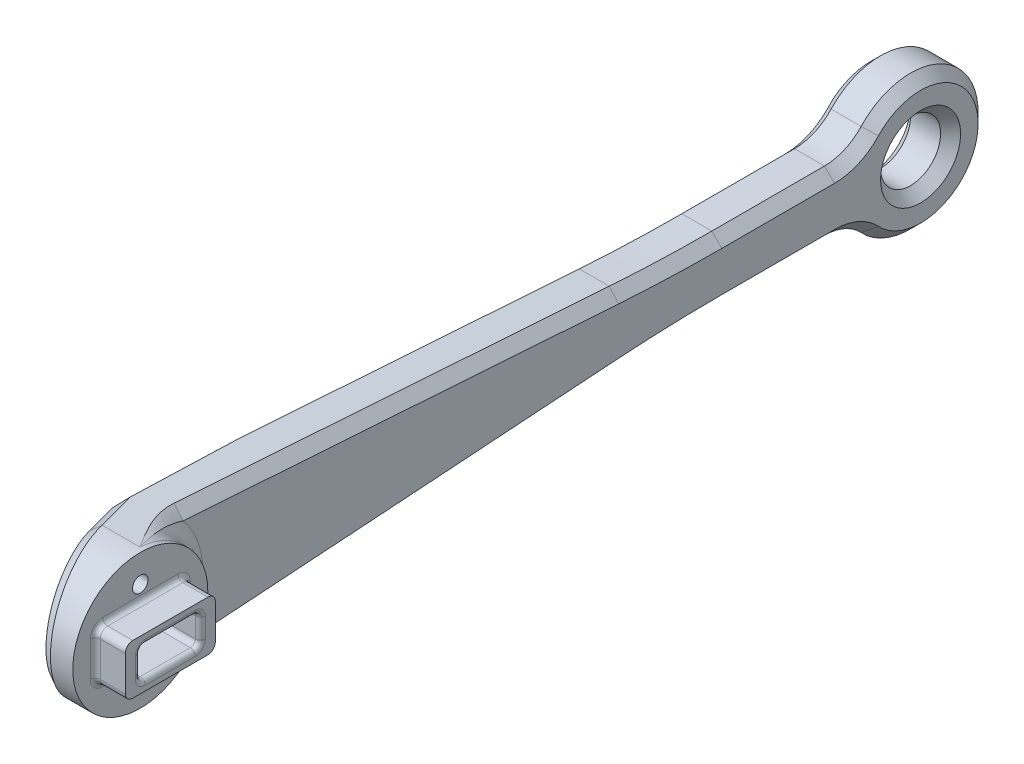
ISO-10303-21;
HEADER;
FILE_DESCRIPTION(('STEP AP214'),'2;1');
FILE_NAME('part.step','',(''),(''),'','','');
FILE_SCHEMA(('AUTOMOTIVE_DESIGN { 1 0 10303 214 1 1 1 1 }'));
ENDSEC;
DATA;
#1=APPLICATION_CONTEXT('core data for automotive mechanical design processes');
#2=APPLICATION_PROTOCOL_DEFINITION('international standard','automotive_design',2000,#1);
#3=PRODUCT_CONTEXT('',#1,'mechanical');
#4=PRODUCT('Part','Part','',(#3));
#5=PRODUCT_RELATED_PRODUCT_CATEGORY('part','',(#4));
#6=PRODUCT_DEFINITION_FORMATION('','',#4);
#7=PRODUCT_DEFINITION_CONTEXT('part definition',#1,'design');
#8=PRODUCT_DEFINITION('design','',#6,#7);
#9=PRODUCT_DEFINITION_SHAPE('','',#8);
#10=(LENGTH_UNIT() NAMED_UNIT(*) SI_UNIT(.MILLI.,.METRE.));
#11=(NAMED_UNIT(*) PLANE_ANGLE_UNIT() SI_UNIT($,.RADIAN.));
#12=(NAMED_UNIT(*) SI_UNIT($,.STERADIAN.) SOLID_ANGLE_UNIT());
#13=UNCERTAINTY_MEASURE_WITH_UNIT(LENGTH_MEASURE(1.E-05),#10,'distance_accuracy_value','');
#14=(GEOMETRIC_REPRESENTATION_CONTEXT(3) GLOBAL_UNCERTAINTY_ASSIGNED_CONTEXT((#13)) GLOBAL_UNIT_ASSIGNED_CONTEXT((#10,
#11,#12)) REPRESENTATION_CONTEXT('',''));
#15=CARTESIAN_POINT('',(0.,0.,0.));
#16=DIRECTION('',(0.,0.,1.));
#17=DIRECTION('',(1.,0.,0.));
#18=AXIS2_PLACEMENT_3D('',#15,#16,#17);
#19=CARTESIAN_POINT('',(-5.,8.,0.));
#20=DIRECTION('',(1.,0.,0.));
#21=DIRECTION('',(0.,0.,-1.));
#22=AXIS2_PLACEMENT_3D('',#19,#20,#21);
#23=CYLINDRICAL_SURFACE('',#22,1.55);
#24=CARTESIAN_POINT('',(9.,8.,0.));
#25=DIRECTION('',(1.,0.,0.));
#26=DIRECTION('',(0.,0.,1.));
#27=AXIS2_PLACEMENT_3D('',#24,#25,#26);
#28=CIRCLE('',#27,1.55);
#29=CARTESIAN_POINT('',(9.,8.,1.55));
#30=VERTEX_POINT('',#29);
#31=EDGE_CURVE('E596',#30,#30,#28,.T.);
#32=ORIENTED_EDGE('',*,*,#31,.T.);
#33=EDGE_LOOP('',(#32));
#34=FACE_BOUND('',#33,.T.);
#35=CARTESIAN_POINT('',(3.,8.,0.));
#36=DIRECTION('',(-1.,0.,0.));
#37=DIRECTION('',(0.,0.,1.));
#38=AXIS2_PLACEMENT_3D('',#35,#36,#37);
#39=CIRCLE('',#38,1.55);
#40=CARTESIAN_POINT('',(3.,8.,1.55));
#41=VERTEX_POINT('',#40);
#42=EDGE_CURVE('E592',#41,#41,#39,.F.);
#43=ORIENTED_EDGE('',*,*,#42,.F.);
#44=EDGE_LOOP('',(#43));
#45=FACE_BOUND('',#44,.T.);
#46=ADVANCED_FACE('F35',(#34,#45),#23,.F.);
#47=CARTESIAN_POINT('',(-5.,-8.,0.));
#48=DIRECTION('',(1.,0.,0.));
#49=DIRECTION('',(0.,0.,-1.));
#50=AXIS2_PLACEMENT_3D('',#47,#48,#49);
#51=CYLINDRICAL_SURFACE('',#50,1.55);
#52=CARTESIAN_POINT('',(9.,-8.,0.));
#53=DIRECTION('',(1.,0.,0.));
#54=DIRECTION('',(0.,0.,-1.));
#55=AXIS2_PLACEMENT_3D('',#52,#53,#54);
#56=CIRCLE('',#55,1.55);
#57=CARTESIAN_POINT('',(9.,-8.,-1.55));
#58=VERTEX_POINT('',#57);
#59=EDGE_CURVE('E570',#58,#58,#56,.T.);
#60=ORIENTED_EDGE('',*,*,#59,.T.);
#61=EDGE_LOOP('',(#60));
#62=FACE_BOUND('',#61,.T.);
#63=CARTESIAN_POINT('',(3.,-8.,0.));
#64=DIRECTION('',(-1.,0.,0.));
#65=DIRECTION('',(0.,0.,1.));
#66=AXIS2_PLACEMENT_3D('',#63,#64,#65);
#67=CIRCLE('',#66,1.55);
#68=CARTESIAN_POINT('',(3.,-8.,1.55));
#69=VERTEX_POINT('',#68);
#70=EDGE_CURVE('E589',#69,#69,#67,.F.);
#71=ORIENTED_EDGE('',*,*,#70,.F.);
#72=EDGE_LOOP('',(#71));
#73=FACE_BOUND('',#72,.T.);
#74=ADVANCED_FACE('F1176',(#62,#73),#51,.F.);
#75=CARTESIAN_POINT('',(9.,0.,0.));
#76=DIRECTION('',(1.,0.,0.));
#77=DIRECTION('',(0.,0.,-1.));
#78=AXIS2_PLACEMENT_3D('',#75,#76,#77);
#79=PLANE('',#78);
#80=ORIENTED_EDGE('',*,*,#59,.F.);
#81=EDGE_LOOP('',(#80));
#82=FACE_BOUND('',#81,.T.);
#83=ORIENTED_EDGE('',*,*,#31,.F.);
#84=EDGE_LOOP('',(#83));
#85=FACE_BOUND('',#84,.T.);
#86=DIRECTION('',(0.,0.,1.));
#87=VECTOR('',#86,1.);
#88=CARTESIAN_POINT('',(9.,6.,0.));
#89=LINE('',#88,#87);
#90=CARTESIAN_POINT('',(9.,6.,7.49999999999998));
#91=VERTEX_POINT('',#90);
#92=CARTESIAN_POINT('',(9.,6.,-7.49999999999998));
#93=VERTEX_POINT('',#92);
#94=EDGE_CURVE('E486',#91,#93,#89,.F.);
#95=ORIENTED_EDGE('',*,*,#94,.T.);
#96=CARTESIAN_POINT('',(9.,3.5,-7.5));
#97=DIRECTION('',(1.,0.,0.));
#98=DIRECTION('',(0.,0.,-1.));
#99=AXIS2_PLACEMENT_3D('',#96,#97,#98);
#100=CIRCLE('',#99,2.5);
#101=CARTESIAN_POINT('',(9.,3.49999999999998,-10.));
#102=VERTEX_POINT('',#101);
#103=EDGE_CURVE('E500',#93,#102,#100,.F.);
#104=ORIENTED_EDGE('',*,*,#103,.T.);
#105=DIRECTION('',(0.,1.,0.));
#106=VECTOR('',#105,1.);
#107=CARTESIAN_POINT('',(9.,0.,-10.));
#108=LINE('',#107,#106);
#109=CARTESIAN_POINT('',(9.,-3.49999999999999,-10.));
#110=VERTEX_POINT('',#109);
#111=EDGE_CURVE('E498',#102,#110,#108,.F.);
#112=ORIENTED_EDGE('',*,*,#111,.T.);
#113=CARTESIAN_POINT('',(9.,-3.5,-7.5));
#114=DIRECTION('',(1.,0.,0.));
#115=DIRECTION('',(0.,0.,-1.));
#116=AXIS2_PLACEMENT_3D('',#113,#114,#115);
#117=CIRCLE('',#116,2.5);
#118=CARTESIAN_POINT('',(9.,-6.,-7.49999999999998));
#119=VERTEX_POINT('',#118);
#120=EDGE_CURVE('E496',#110,#119,#117,.F.);
#121=ORIENTED_EDGE('',*,*,#120,.T.);
#122=DIRECTION('',(0.,0.,-1.));
#123=VECTOR('',#122,1.);
#124=CARTESIAN_POINT('',(9.,-6.,0.));
#125=LINE('',#124,#123);
#126=CARTESIAN_POINT('',(9.,-6.,7.49999999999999));
#127=VERTEX_POINT('',#126);
#128=EDGE_CURVE('E494',#119,#127,#125,.F.);
#129=ORIENTED_EDGE('',*,*,#128,.T.);
#130=CARTESIAN_POINT('',(9.,-3.5,7.5));
#131=DIRECTION('',(1.,0.,0.));
#132=DIRECTION('',(0.,0.,-1.));
#133=AXIS2_PLACEMENT_3D('',#130,#131,#132);
#134=CIRCLE('',#133,2.5);
#135=CARTESIAN_POINT('',(9.,-3.49999999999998,10.));
#136=VERTEX_POINT('',#135);
#137=EDGE_CURVE('E492',#127,#136,#134,.F.);
#138=ORIENTED_EDGE('',*,*,#137,.T.);
#139=DIRECTION('',(0.,-1.,0.));
#140=VECTOR('',#139,1.);
#141=CARTESIAN_POINT('',(9.,0.,10.));
#142=LINE('',#141,#140);
#143=CARTESIAN_POINT('',(9.,3.49999999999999,10.));
#144=VERTEX_POINT('',#143);
#145=EDGE_CURVE('E490',#136,#144,#142,.F.);
#146=ORIENTED_EDGE('',*,*,#145,.T.);
#147=CARTESIAN_POINT('',(9.,3.5,7.5));
#148=DIRECTION('',(1.,0.,0.));
#149=DIRECTION('',(0.,0.,-1.));
#150=AXIS2_PLACEMENT_3D('',#147,#148,#149);
#151=CIRCLE('',#150,2.5);
#152=EDGE_CURVE('E488',#144,#91,#151,.F.);
#153=ORIENTED_EDGE('',*,*,#152,.T.);
#154=EDGE_LOOP('',(#95,#104,#112,#121,#129,#138,#146,#153));
#155=FACE_BOUND('',#154,.T.);
#156=CARTESIAN_POINT('',(9.,0.,0.));
#157=DIRECTION('',(1.,0.,0.));
#158=DIRECTION('',(0.,0.,-1.));
#159=AXIS2_PLACEMENT_3D('',#156,#157,#158);
#160=CIRCLE('',#159,13.5);
#161=CARTESIAN_POINT('',(9.,0.,-13.5000000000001));
#162=VERTEX_POINT('',#161);
#163=EDGE_CURVE('E390',#162,#162,#160,.T.);
#164=ORIENTED_EDGE('',*,*,#163,.T.);
#165=EDGE_LOOP('',(#164));
#166=FACE_BOUND('',#165,.T.);
#167=ADVANCED_FACE('F694',(#82,#85,#155,#166),#79,.T.);
#168=CARTESIAN_POINT('',(-5.,16.,-142.788085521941));
#169=DIRECTION('',(1.,0.,0.));
#170=DIRECTION('',(0.,0.,-1.));
#171=AXIS2_PLACEMENT_3D('',#168,#169,#170);
#172=CYLINDRICAL_SURFACE('',#171,10.);
#173=DIRECTION('',(1.,0.,0.));
#174=VECTOR('',#173,1.);
#175=CARTESIAN_POINT('',(-5.,6.,-142.788085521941));
#176=LINE('',#175,#174);
#177=CARTESIAN_POINT('',(-3.00000000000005,6.,-142.788085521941));
#178=VERTEX_POINT('',#177);
#179=CARTESIAN_POINT('',(2.99999999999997,6.,-142.788085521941));
#180=VERTEX_POINT('',#179);
#181=EDGE_CURVE('E393',#178,#180,#176,.T.);
#182=ORIENTED_EDGE('',*,*,#181,.T.);
#183=CARTESIAN_POINT('',(2.99999999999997,16.,-142.788085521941));
#184=DIRECTION('',(-1.,0.,0.));
#185=DIRECTION('',(0.,0.,1.));
#186=AXIS2_PLACEMENT_3D('',#183,#184,#185);
#187=CIRCLE('',#186,10.);
#188=CARTESIAN_POINT('',(2.99999999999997,9.19148936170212,-150.112304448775));
#189=VERTEX_POINT('',#188);
#190=EDGE_CURVE('E1700',#180,#189,#187,.F.);
#191=ORIENTED_EDGE('',*,*,#190,.T.);
#192=DIRECTION('',(1.,0.,0.));
#193=VECTOR('',#192,1.);
#194=CARTESIAN_POINT('',(-5.,9.19148936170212,-150.112304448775));
#195=LINE('',#194,#193);
#196=CARTESIAN_POINT('',(-3.00000000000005,9.19148936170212,-150.112304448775));
#197=VERTEX_POINT('',#196);
#198=EDGE_CURVE('E399',#197,#189,#195,.T.);
#199=ORIENTED_EDGE('',*,*,#198,.F.);
#200=CARTESIAN_POINT('',(-3.00000000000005,16.,-142.788085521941));
#201=DIRECTION('',(-1.,0.,0.));
#202=DIRECTION('',(0.,0.,1.));
#203=AXIS2_PLACEMENT_3D('',#200,#201,#202);
#204=CIRCLE('',#203,10.);
#205=EDGE_CURVE('E1698',#197,#178,#204,.T.);
#206=ORIENTED_EDGE('',*,*,#205,.T.);
#207=EDGE_LOOP('',(#182,#191,#199,#206));
#208=FACE_BOUND('',#207,.T.);
#209=ADVANCED_FACE('F690',(#208),#172,.F.);
#210=CARTESIAN_POINT('',(-5.,0.,-160.));
#211=DIRECTION('',(1.,0.,0.));
#212=DIRECTION('',(0.,0.,-1.));
#213=AXIS2_PLACEMENT_3D('',#210,#211,#212);
#214=CYLINDRICAL_SURFACE('',#213,13.5);
#215=ORIENTED_EDGE('',*,*,#198,.T.);
#216=CARTESIAN_POINT('',(2.99999999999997,0.,-160.));
#217=DIRECTION('',(-1.,0.,0.));
#218=DIRECTION('',(0.,0.,1.));
#219=AXIS2_PLACEMENT_3D('',#216,#217,#218);
#220=CIRCLE('',#219,13.5);
#221=CARTESIAN_POINT('',(2.99999999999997,-9.19148936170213,-150.112304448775));
#222=VERTEX_POINT('',#221);
#223=EDGE_CURVE('E1707',#189,#222,#220,.T.);
#224=ORIENTED_EDGE('',*,*,#223,.T.);
#225=DIRECTION('',(1.,0.,0.));
#226=VECTOR('',#225,1.);
#227=CARTESIAN_POINT('',(-5.,-9.19148936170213,-150.112304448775));
#228=LINE('',#227,#226);
#229=CARTESIAN_POINT('',(-3.00000000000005,-9.19148936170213,-150.112304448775));
#230=VERTEX_POINT('',#229);
#231=EDGE_CURVE('E403',#230,#222,#228,.T.);
#232=ORIENTED_EDGE('',*,*,#231,.F.);
#233=CARTESIAN_POINT('',(-3.00000000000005,0.,-160.));
#234=DIRECTION('',(-1.,0.,0.));
#235=DIRECTION('',(0.,0.,1.));
#236=AXIS2_PLACEMENT_3D('',#233,#234,#235);
#237=CIRCLE('',#236,13.5);
#238=EDGE_CURVE('E1705',#230,#197,#237,.F.);
#239=ORIENTED_EDGE('',*,*,#238,.T.);
#240=EDGE_LOOP('',(#215,#224,#232,#239));
#241=FACE_BOUND('',#240,.T.);
#242=ADVANCED_FACE('F693',(#241),#214,.T.);
#243=CARTESIAN_POINT('',(-5.,-16.,-142.788085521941));
#244=DIRECTION('',(1.,0.,0.));
#245=DIRECTION('',(0.,0.,-1.));
#246=AXIS2_PLACEMENT_3D('',#243,#244,#245);
#247=CYLINDRICAL_SURFACE('',#246,10.);
#248=ORIENTED_EDGE('',*,*,#231,.T.);
#249=CARTESIAN_POINT('',(2.99999999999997,-16.,-142.788085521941));
#250=DIRECTION('',(-1.,0.,0.));
#251=DIRECTION('',(0.,0.,1.));
#252=AXIS2_PLACEMENT_3D('',#249,#250,#251);
#253=CIRCLE('',#252,10.);
#254=CARTESIAN_POINT('',(2.99999999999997,-6.,-142.788085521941));
#255=VERTEX_POINT('',#254);
#256=EDGE_CURVE('E1711',#222,#255,#253,.F.);
#257=ORIENTED_EDGE('',*,*,#256,.T.);
#258=DIRECTION('',(1.,0.,0.));
#259=VECTOR('',#258,1.);
#260=CARTESIAN_POINT('',(-5.,-6.,-142.788085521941));
#261=LINE('',#260,#259);
#262=CARTESIAN_POINT('',(-3.00000000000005,-6.,-142.788085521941));
#263=VERTEX_POINT('',#262);
#264=EDGE_CURVE('E406',#263,#255,#261,.T.);
#265=ORIENTED_EDGE('',*,*,#264,.F.);
#266=CARTESIAN_POINT('',(-3.00000000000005,-16.,-142.788085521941));
#267=DIRECTION('',(-1.,0.,0.));
#268=DIRECTION('',(0.,0.,1.));
#269=AXIS2_PLACEMENT_3D('',#266,#267,#268);
#270=CIRCLE('',#269,10.);
#271=EDGE_CURVE('E1709',#263,#230,#270,.T.);
#272=ORIENTED_EDGE('',*,*,#271,.T.);
#273=EDGE_LOOP('',(#248,#257,#265,#272));
#274=FACE_BOUND('',#273,.T.);
#275=ADVANCED_FACE('F1325',(#274),#247,.F.);
#276=CARTESIAN_POINT('',(-5.,-6.,-142.788085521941));
#277=DIRECTION('',(0.,-1.,0.));
#278=DIRECTION('',(0.,0.,-1.));
#279=AXIS2_PLACEMENT_3D('',#276,#277,#278);
#280=PLANE('',#279);
#281=ORIENTED_EDGE('',*,*,#264,.T.);
#282=DIRECTION('',(0.,0.,1.));
#283=VECTOR('',#282,1.);
#284=CARTESIAN_POINT('',(2.99999999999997,-6.00000000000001,-120.258364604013));
#285=LINE('',#284,#283);
#286=CARTESIAN_POINT('',(2.99999999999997,-6.00000000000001,-120.258364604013));
#287=VERTEX_POINT('',#286);
#288=EDGE_CURVE('E1653',#255,#287,#285,.T.);
#289=ORIENTED_EDGE('',*,*,#288,.T.);
#290=DIRECTION('',(1.,0.,0.));
#291=VECTOR('',#290,1.);
#292=CARTESIAN_POINT('',(-5.,-6.00000000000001,-120.258364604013));
#293=LINE('',#292,#291);
#294=CARTESIAN_POINT('',(-3.00000000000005,-6.00000000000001,-120.258364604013));
#295=VERTEX_POINT('',#294);
#296=EDGE_CURVE('E409',#295,#287,#293,.T.);
#297=ORIENTED_EDGE('',*,*,#296,.F.);
#298=DIRECTION('',(0.,0.,-1.));
#299=VECTOR('',#298,1.);
#300=CARTESIAN_POINT('',(-3.00000000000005,-6.,-142.788085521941));
#301=LINE('',#300,#299);
#302=EDGE_CURVE('E1656',#295,#263,#301,.T.);
#303=ORIENTED_EDGE('',*,*,#302,.T.);
#304=EDGE_LOOP('',(#281,#289,#297,#303));
#305=FACE_BOUND('',#304,.T.);
#306=ADVANCED_FACE('F1317',(#305),#280,.T.);
#307=CARTESIAN_POINT('',(-5.,-306.,-120.258364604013));
#308=DIRECTION('',(1.,0.,0.));
#309=DIRECTION('',(0.,0.,-1.));
#310=AXIS2_PLACEMENT_3D('',#307,#308,#309);
#311=CYLINDRICAL_SURFACE('',#310,300.);
#312=ORIENTED_EDGE('',*,*,#296,.T.);
#313=CARTESIAN_POINT('',(2.99999999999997,-306.,-120.258364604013));
#314=DIRECTION('',(-1.,0.,0.));
#315=DIRECTION('',(0.,0.,1.));
#316=AXIS2_PLACEMENT_3D('',#313,#314,#315);
#317=CIRCLE('',#316,300.);
#318=CARTESIAN_POINT('',(2.99999999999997,-6.70074094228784,-99.7655969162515));
#319=VERTEX_POINT('',#318);
#320=EDGE_CURVE('E939',#287,#319,#317,.F.);
#321=ORIENTED_EDGE('',*,*,#320,.T.);
#322=DIRECTION('',(1.,0.,0.));
#323=VECTOR('',#322,1.);
#324=CARTESIAN_POINT('',(-5.,-6.70074094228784,-99.7655969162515));
#325=LINE('',#324,#323);
#326=CARTESIAN_POINT('',(-3.00000000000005,-6.70074094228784,-99.7655969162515));
#327=VERTEX_POINT('',#326);
#328=EDGE_CURVE('E412',#327,#319,#325,.T.);
#329=ORIENTED_EDGE('',*,*,#328,.F.);
#330=CARTESIAN_POINT('',(-3.00000000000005,-306.,-120.258364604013));
#331=DIRECTION('',(-1.,0.,0.));
#332=DIRECTION('',(0.,0.,1.));
#333=AXIS2_PLACEMENT_3D('',#330,#331,#332);
#334=CIRCLE('',#333,300.);
#335=EDGE_CURVE('E942',#327,#295,#334,.T.);
#336=ORIENTED_EDGE('',*,*,#335,.T.);
#337=EDGE_LOOP('',(#312,#321,#329,#336));
#338=FACE_BOUND('',#337,.T.);
#339=ADVANCED_FACE('F1310',(#338),#311,.F.);
#340=CARTESIAN_POINT('',(-5.,-6.7007409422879,-99.7655969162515));
#341=DIRECTION('',(0.,-0.99766419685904,-0.0683092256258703));
#342=DIRECTION('',(0.,0.0683092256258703,-0.99766419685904));
#343=AXIS2_PLACEMENT_3D('',#340,#341,#342);
#344=PLANE('',#343);
#345=DIRECTION('',(-0.3041297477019,0.0650734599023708,-0.950405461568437));
#346=VECTOR('',#345,1.);
#347=CARTESIAN_POINT('',(-1.11974552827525,-13.1311397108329,-5.84887389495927));
#348=LINE('',#347,#346);
#349=CARTESIAN_POINT('',(0.456798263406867,-13.468466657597,-0.922174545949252));
#350=VERTEX_POINT('',#349);
#351=CARTESIAN_POINT('',(-2.19726490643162,-12.900587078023,-9.21612195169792));
#352=VERTEX_POINT('',#351);
#353=EDGE_CURVE('E829',#350,#352,#348,.T.);
#354=ORIENTED_EDGE('',*,*,#353,.T.);
#355=DIRECTION('',(0.0357276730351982,-0.0682656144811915,0.997027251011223));
#356=VECTOR('',#355,1.);
#357=CARTESIAN_POINT('',(-5.44146858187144,-6.7018190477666,-99.7498510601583));
#358=LINE('',#357,#356);
#359=CARTESIAN_POINT('',(-3.00000000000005,-11.3667842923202,-31.6174902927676));
#360=VERTEX_POINT('',#359);
#361=EDGE_CURVE('E831',#352,#360,#358,.F.);
#362=ORIENTED_EDGE('',*,*,#361,.T.);
#363=DIRECTION('',(0.,0.0683092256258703,-0.99766419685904));
#364=VECTOR('',#363,1.);
#365=CARTESIAN_POINT('',(-3.00000000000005,-6.7007409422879,-99.7655969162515));
#366=LINE('',#365,#364);
#367=EDGE_CURVE('E1649',#360,#327,#366,.T.);
#368=ORIENTED_EDGE('',*,*,#367,.T.);
#369=ORIENTED_EDGE('',*,*,#328,.T.);
#370=DIRECTION('',(0.,-0.0683092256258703,0.99766419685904));
#371=VECTOR('',#370,1.);
#372=CARTESIAN_POINT('',(2.99999999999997,-12.8204284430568,-10.3868481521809));
#373=LINE('',#372,#371);
#374=CARTESIAN_POINT('',(2.99999999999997,-12.6602210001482,-12.7266965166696));
#375=VERTEX_POINT('',#374);
#376=EDGE_CURVE('E1652',#319,#375,#373,.T.);
#377=ORIENTED_EDGE('',*,*,#376,.T.);
#378=CARTESIAN_POINT('',(8.00000000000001,-13.4684666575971,-0.9221745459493));
#379=CARTESIAN_POINT('',(7.70143809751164,-13.4375367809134,-1.37390899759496));
#380=CARTESIAN_POINT('',(7.4029929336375,-13.4066192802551,-1.82546269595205));
#381=CARTESIAN_POINT('',(6.81359745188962,-13.3444919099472,-2.73284017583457));
#382=CARTESIAN_POINT('',(6.52271647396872,-13.3132902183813,-3.18854451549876));
#383=CARTESIAN_POINT('',(5.95623911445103,-13.2503210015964,-4.10821726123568));
#384=CARTESIAN_POINT('',(5.68063596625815,-13.2185550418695,-4.57216280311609));
#385=CARTESIAN_POINT('',(5.15269793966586,-13.1541657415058,-5.51257603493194));
#386=CARTESIAN_POINT('',(4.90032940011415,-13.1215436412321,-5.98902560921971));
#387=CARTESIAN_POINT('',(4.54571461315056,-13.0717284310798,-6.71658255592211));
#388=CARTESIAN_POINT('',(4.43149996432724,-13.0549763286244,-6.96124896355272));
#389=CARTESIAN_POINT('',(4.21227897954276,-13.0211328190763,-7.45553736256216));
#390=CARTESIAN_POINT('',(4.10726776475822,-13.0040415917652,-7.70515672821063));
#391=CARTESIAN_POINT('',(3.90780478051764,-12.9694700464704,-8.21007817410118));
#392=CARTESIAN_POINT('',(3.81335191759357,-12.9519894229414,-8.46538471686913));
#393=CARTESIAN_POINT('',(3.68075438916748,-12.925434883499,-8.85321685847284));
#394=CARTESIAN_POINT('',(3.63802280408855,-12.9165152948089,-8.98348849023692));
#395=CARTESIAN_POINT('',(3.55613743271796,-12.8986280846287,-9.24473327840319));
#396=CARTESIAN_POINT('',(3.51698844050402,-12.889663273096,-9.37566539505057));
#397=CARTESIAN_POINT('',(3.40525843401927,-12.8627159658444,-9.76923395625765));
#398=CARTESIAN_POINT('',(3.33823851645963,-12.8446527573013,-10.033049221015));
#399=CARTESIAN_POINT('',(3.22079338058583,-12.8083450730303,-10.563327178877));
#400=CARTESIAN_POINT('',(3.170326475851,-12.7900952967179,-10.8298672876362));
#401=CARTESIAN_POINT('',(3.04641507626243,-12.7350265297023,-11.6341530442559));
#402=CARTESIAN_POINT('',(3.00010877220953,-12.6978921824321,-12.1765045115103));
#403=CARTESIAN_POINT('',(2.99999999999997,-12.6602210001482,-12.7266965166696));
#404=B_SPLINE_CURVE_WITH_KNOTS('',3,(#378,#379,#380,#381,#382,#383,#384,#385,#386,#387,#388,
#389,#390,#391,#392,#393,#394,#395,#396,#397,#398,#399,#400,#401,#402,#403),.UNSPECIFIED.,.F.,
.F.,(4,2,2,2,2,2,2,2,2,2,2,2,4),(0.,0.00163106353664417,0.00326212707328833,0.0048931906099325,
0.00652425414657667,0.00733978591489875,0.00815531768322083,0.00897084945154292,
0.00937861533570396,0.009786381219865,0.0106019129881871,0.0114174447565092,0.0130485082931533),.UNSPECIFIED.);
#405=CARTESIAN_POINT('',(8.,-13.468466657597,-0.922174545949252));
#406=VERTEX_POINT('',#405);
#407=EDGE_CURVE('E947',#375,#406,#404,.F.);
#408=ORIENTED_EDGE('',*,*,#407,.T.);
#409=DIRECTION('',(1.,0.,0.));
#410=VECTOR('',#409,1.);
#411=CARTESIAN_POINT('',(-5.,-13.468466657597,-0.922174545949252));
#412=LINE('',#411,#410);
#413=EDGE_CURVE('E415',#350,#406,#412,.T.);
#414=ORIENTED_EDGE('',*,*,#413,.F.);
#415=EDGE_LOOP('',(#354,#362,#368,#369,#377,#408,#414));
#416=FACE_BOUND('',#415,.T.);
#417=ADVANCED_FACE('F1304',(#416),#344,.T.);
#418=CARTESIAN_POINT('',(-5.,0.,0.));
#419=DIRECTION('',(1.,0.,0.));
#420=DIRECTION('',(0.,0.,-1.));
#421=AXIS2_PLACEMENT_3D('',#418,#419,#420);
#422=CYLINDRICAL_SURFACE('',#421,13.5);
#423=DIRECTION('',(1.,0.,0.));
#424=VECTOR('',#423,1.);
#425=CARTESIAN_POINT('',(-5.,13.468466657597,-0.922174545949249));
#426=LINE('',#425,#424);
#427=CARTESIAN_POINT('',(0.456798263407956,13.468466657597,-0.922174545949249));
#428=VERTEX_POINT('',#427);
#429=CARTESIAN_POINT('',(8.,13.468466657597,-0.922174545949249));
#430=VERTEX_POINT('',#429);
#431=EDGE_CURVE('E419',#428,#430,#426,.T.);
#432=ORIENTED_EDGE('',*,*,#431,.F.);
#433=CARTESIAN_POINT('',(0.456798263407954,-13.4684666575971,-0.922174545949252));
#434=CARTESIAN_POINT('',(0.717490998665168,-13.5315204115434,-0.00230012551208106));
#435=CARTESIAN_POINT('',(0.980008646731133,-13.4998645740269,0.924013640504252));
#436=CARTESIAN_POINT('',(1.49775412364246,-13.2488713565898,2.75091848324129));
#437=CARTESIAN_POINT('',(1.75295791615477,-13.0294758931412,3.6514247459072));
#438=CARTESIAN_POINT('',(2.24540066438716,-12.4120231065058,5.38904695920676));
#439=CARTESIAN_POINT('',(2.48261545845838,-12.0139960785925,6.22607765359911));
#440=CARTESIAN_POINT('',(2.92915402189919,-11.0559150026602,7.80172341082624));
#441=CARTESIAN_POINT('',(3.13845588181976,-10.4959079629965,8.54026116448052));
#442=CARTESIAN_POINT('',(3.52040921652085,-9.23728014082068,9.88801296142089));
#443=CARTESIAN_POINT('',(3.69304195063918,-8.53872111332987,10.4971608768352));
#444=CARTESIAN_POINT('',(3.99443095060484,-7.03220153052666,11.5606352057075));
#445=CARTESIAN_POINT('',(4.12317242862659,-6.22431489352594,12.0149094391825));
#446=CARTESIAN_POINT('',(4.33138841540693,-4.53292914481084,12.7496156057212));
#447=CARTESIAN_POINT('',(4.4108527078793,-3.6495130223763,13.0300114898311));
#448=CARTESIAN_POINT('',(4.51718491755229,-1.84402062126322,13.4052128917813));
#449=CARTESIAN_POINT('',(4.54404761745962,-0.92203293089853,13.4999999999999));
#450=CARTESIAN_POINT('',(4.54404761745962,0.922032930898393,13.4999999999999));
#451=CARTESIAN_POINT('',(4.51718491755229,1.84402062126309,13.4052128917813));
#452=CARTESIAN_POINT('',(4.41085270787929,3.64951302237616,13.0300114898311));
#453=CARTESIAN_POINT('',(4.33138841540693,4.53292914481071,12.7496156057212));
#454=CARTESIAN_POINT('',(4.12317242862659,6.22431489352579,12.0149094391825));
#455=CARTESIAN_POINT('',(3.99443095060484,7.03220153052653,11.5606352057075));
#456=CARTESIAN_POINT('',(3.69304195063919,8.53872111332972,10.4971608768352));
#457=CARTESIAN_POINT('',(3.52040921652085,9.23728014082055,9.88801296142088));
#458=CARTESIAN_POINT('',(3.13845588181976,10.4959079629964,8.54026116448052));
#459=CARTESIAN_POINT('',(2.92915402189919,11.0559150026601,7.80172341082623));
#460=CARTESIAN_POINT('',(2.48261545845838,12.0139960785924,6.22607765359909));
#461=CARTESIAN_POINT('',(2.24540066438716,12.4120231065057,5.38904695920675));
#462=CARTESIAN_POINT('',(1.75295791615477,13.029475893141,3.6514247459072));
#463=CARTESIAN_POINT('',(1.49775412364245,13.2488713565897,2.75091848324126));
#464=CARTESIAN_POINT('',(0.980008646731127,13.4998645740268,0.92401364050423));
#465=CARTESIAN_POINT('',(0.717490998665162,13.5315204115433,-0.00230012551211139));
#466=CARTESIAN_POINT('',(0.456798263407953,13.468466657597,-0.922174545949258));
#467=B_SPLINE_CURVE_WITH_KNOTS('',3,(#433,#434,#435,#436,#437,#438,#439,#440,#441,#442,#443,
#444,#445,#446,#447,#448,#449,#450,#451,#452,#453,#454,#455,#456,#457,#458,#459,#460,#461,#462,
#463,#464,#465,#466),.UNSPECIFIED.,.F.,.F.,(4,2,2,2,2,2,2,2,2,2,2,2,2,2,2,2,4),
(-1.63915878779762,-1.43426393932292,-1.22936909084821,-1.02447424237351,-0.81957939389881,
-0.614684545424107,-0.409789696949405,-0.204894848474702,0.,0.204894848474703,0.409789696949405,
0.614684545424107,0.81957939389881,1.02447424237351,1.22936909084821,1.43426393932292,
1.63915878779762),.UNSPECIFIED.);
#468=EDGE_CURVE('E11',#428,#350,#467,.F.);
#469=ORIENTED_EDGE('',*,*,#468,.T.);
#470=ORIENTED_EDGE('',*,*,#413,.T.);
#471=CARTESIAN_POINT('',(8.,0.,0.));
#472=DIRECTION('',(-1.,0.,0.));
#473=DIRECTION('',(0.,0.,1.));
#474=AXIS2_PLACEMENT_3D('',#471,#472,#473);
#475=CIRCLE('',#474,13.5);
#476=EDGE_CURVE('E520',#406,#430,#475,.F.);
#477=ORIENTED_EDGE('',*,*,#476,.T.);
#478=EDGE_LOOP('',(#432,#469,#470,#477));
#479=FACE_BOUND('',#478,.T.);
#480=ORIENTED_EDGE('',*,*,#163,.F.);
#481=EDGE_LOOP('',(#480));
#482=FACE_BOUND('',#481,.T.);
#483=ADVANCED_FACE('F679',(#479,#482),#422,.T.);
#484=CARTESIAN_POINT('',(-5.,6.7007409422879,-99.7655969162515));
#485=DIRECTION('',(0.,0.99766419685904,-0.0683092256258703));
#486=DIRECTION('',(0.,0.0683092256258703,0.99766419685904));
#487=AXIS2_PLACEMENT_3D('',#484,#485,#486);
#488=PLANE('',#487);
#489=DIRECTION('',(0.,0.0683092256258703,0.99766419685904));
#490=VECTOR('',#489,1.);
#491=CARTESIAN_POINT('',(-3.00000000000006,6.7007409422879,-99.7655969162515));
#492=LINE('',#491,#490);
#493=CARTESIAN_POINT('',(-3.00000000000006,6.7007409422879,-99.7655969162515));
#494=VERTEX_POINT('',#493);
#495=CARTESIAN_POINT('',(-3.00000000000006,11.3667842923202,-31.6174902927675));
#496=VERTEX_POINT('',#495);
#497=EDGE_CURVE('E655',#494,#496,#492,.T.);
#498=ORIENTED_EDGE('',*,*,#497,.T.);
#499=DIRECTION('',(-0.0357276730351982,-0.0682656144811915,-0.997027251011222));
#500=VECTOR('',#499,1.);
#501=CARTESIAN_POINT('',(-5.44146858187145,6.7018190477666,-99.7498510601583));
#502=LINE('',#501,#500);
#503=CARTESIAN_POINT('',(-2.19726490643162,12.900587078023,-9.21612195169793));
#504=VERTEX_POINT('',#503);
#505=EDGE_CURVE('E46',#496,#504,#502,.F.);
#506=ORIENTED_EDGE('',*,*,#505,.T.);
#507=DIRECTION('',(0.3041297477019,0.0650734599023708,0.950405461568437));
#508=VECTOR('',#507,1.);
#509=CARTESIAN_POINT('',(0.265158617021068,13.4274622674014,-1.52104844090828));
#510=LINE('',#509,#508);
#511=EDGE_CURVE('E57',#504,#428,#510,.T.);
#512=ORIENTED_EDGE('',*,*,#511,.T.);
#513=ORIENTED_EDGE('',*,*,#431,.T.);
#514=CARTESIAN_POINT('',(2.99999999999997,12.6602210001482,-12.7266965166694));
#515=CARTESIAN_POINT('',(3.00010877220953,12.6978921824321,-12.1765045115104));
#516=CARTESIAN_POINT('',(3.0464150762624,12.7350265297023,-11.6341530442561));
#517=CARTESIAN_POINT('',(3.17032647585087,12.7900952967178,-10.8298672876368));
#518=CARTESIAN_POINT('',(3.22079338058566,12.8083450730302,-10.5633271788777));
#519=CARTESIAN_POINT('',(3.33823851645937,12.8446527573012,-10.0330492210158));
#520=CARTESIAN_POINT('',(3.40525843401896,12.8627159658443,-9.76923395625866));
#521=CARTESIAN_POINT('',(3.51698844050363,12.889663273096,-9.37566539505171));
#522=CARTESIAN_POINT('',(3.55613743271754,12.8986280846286,-9.24473327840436));
#523=CARTESIAN_POINT('',(3.63802280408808,12.9165152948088,-8.9834884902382));
#524=CARTESIAN_POINT('',(3.68075438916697,12.9254348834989,-8.85321685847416));
#525=CARTESIAN_POINT('',(3.81335191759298,12.9519894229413,-8.46538471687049));
#526=CARTESIAN_POINT('',(3.90780478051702,12.9694700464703,-8.21007817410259));
#527=CARTESIAN_POINT('',(4.10726776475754,13.0040415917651,-7.7051567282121));
#528=CARTESIAN_POINT('',(4.21227897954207,13.0211328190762,-7.45553736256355));
#529=CARTESIAN_POINT('',(4.43149996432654,13.0549763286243,-6.96124896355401));
#530=CARTESIAN_POINT('',(4.54571461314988,13.0717284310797,-6.71658255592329));
#531=CARTESIAN_POINT('',(4.90032940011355,13.1215436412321,-5.98902560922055));
#532=CARTESIAN_POINT('',(5.15269793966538,13.1541657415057,-5.51257603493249));
#533=CARTESIAN_POINT('',(5.680635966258,13.2185550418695,-4.57216280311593));
#534=CARTESIAN_POINT('',(5.95623911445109,13.2503210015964,-4.10821726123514));
#535=CARTESIAN_POINT('',(6.52271647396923,13.3132902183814,-3.18854451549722));
#536=CARTESIAN_POINT('',(6.8135974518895,13.3444919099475,-2.73284017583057));
#537=CARTESIAN_POINT('',(7.40299293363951,13.4066192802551,-1.82546269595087));
#538=CARTESIAN_POINT('',(7.7014380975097,13.4375367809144,-1.37390899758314));
#539=CARTESIAN_POINT('',(8.00000000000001,13.468466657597,-0.922174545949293));
#540=B_SPLINE_CURVE_WITH_KNOTS('',3,(#514,#515,#516,#517,#518,#519,#520,#521,#522,#523,#524,
#525,#526,#527,#528,#529,#530,#531,#532,#533,#534,#535,#536,#537,#538,#539),.UNSPECIFIED.,.F.,
.F.,(4,2,2,2,2,2,2,2,2,2,2,2,4),(0.,0.00163106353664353,0.0024465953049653,0.00326212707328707,
0.00366989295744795,0.00407765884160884,0.0048931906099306,0.00570872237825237,
0.00652425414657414,0.00815531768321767,0.00978638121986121,0.0114174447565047,
0.0130485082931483),.UNSPECIFIED.);
#541=CARTESIAN_POINT('',(2.99999999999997,12.6602210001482,-12.7266965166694));
#542=VERTEX_POINT('',#541);
#543=EDGE_CURVE('E661',#430,#542,#540,.F.);
#544=ORIENTED_EDGE('',*,*,#543,.T.);
#545=DIRECTION('',(0.,-0.0683092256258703,-0.99766419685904));
#546=VECTOR('',#545,1.);
#547=CARTESIAN_POINT('',(2.99999999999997,6.7007409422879,-99.7655969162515));
#548=LINE('',#547,#546);
#549=CARTESIAN_POINT('',(2.99999999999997,6.7007409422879,-99.7655969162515));
#550=VERTEX_POINT('',#549);
#551=EDGE_CURVE('E657',#542,#550,#548,.T.);
#552=ORIENTED_EDGE('',*,*,#551,.T.);
#553=DIRECTION('',(1.,0.,0.));
#554=VECTOR('',#553,1.);
#555=CARTESIAN_POINT('',(-5.,6.7007409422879,-99.7655969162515));
#556=LINE('',#555,#554);
#557=EDGE_CURVE('E416',#494,#550,#556,.T.);
#558=ORIENTED_EDGE('',*,*,#557,.F.);
#559=EDGE_LOOP('',(#498,#506,#512,#513,#544,#552,#558));
#560=FACE_BOUND('',#559,.T.);
#561=ADVANCED_FACE('F668',(#560),#488,.T.);
#562=CARTESIAN_POINT('',(-5.,306.,-120.258364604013));
#563=DIRECTION('',(1.,0.,0.));
#564=DIRECTION('',(0.,0.,-1.));
#565=AXIS2_PLACEMENT_3D('',#562,#563,#564);
#566=CYLINDRICAL_SURFACE('',#565,300.);
#567=ORIENTED_EDGE('',*,*,#557,.T.);
#568=CARTESIAN_POINT('',(2.99999999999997,306.,-120.258364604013));
#569=DIRECTION('',(-1.,0.,0.));
#570=DIRECTION('',(0.,0.,1.));
#571=AXIS2_PLACEMENT_3D('',#568,#569,#570);
#572=CIRCLE('',#571,300.);
#573=CARTESIAN_POINT('',(2.99999999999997,5.99999999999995,-120.258364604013));
#574=VERTEX_POINT('',#573);
#575=EDGE_CURVE('E1683',#550,#574,#572,.F.);
#576=ORIENTED_EDGE('',*,*,#575,.T.);
#577=DIRECTION('',(1.,0.,0.));
#578=VECTOR('',#577,1.);
#579=CARTESIAN_POINT('',(-5.,5.99999999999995,-120.258364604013));
#580=LINE('',#579,#578);
#581=CARTESIAN_POINT('',(-3.00000000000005,5.99999999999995,-120.258364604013));
#582=VERTEX_POINT('',#581);
#583=EDGE_CURVE('E420',#582,#574,#580,.T.);
#584=ORIENTED_EDGE('',*,*,#583,.F.);
#585=CARTESIAN_POINT('',(-3.00000000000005,306.,-120.258364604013));
#586=DIRECTION('',(-1.,0.,0.));
#587=DIRECTION('',(0.,0.,1.));
#588=AXIS2_PLACEMENT_3D('',#585,#586,#587);
#589=CIRCLE('',#588,300.);
#590=EDGE_CURVE('E1674',#582,#494,#589,.T.);
#591=ORIENTED_EDGE('',*,*,#590,.T.);
#592=EDGE_LOOP('',(#567,#576,#584,#591));
#593=FACE_BOUND('',#592,.T.);
#594=ADVANCED_FACE('F678',(#593),#566,.F.);
#595=CARTESIAN_POINT('',(-5.,6.,-142.788085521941));
#596=DIRECTION('',(0.,1.,0.));
#597=DIRECTION('',(0.,0.,1.));
#598=AXIS2_PLACEMENT_3D('',#595,#596,#597);
#599=PLANE('',#598);
#600=ORIENTED_EDGE('',*,*,#583,.T.);
#601=DIRECTION('',(0.,0.,-1.));
#602=VECTOR('',#601,1.);
#603=CARTESIAN_POINT('',(2.99999999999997,6.,-142.788085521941));
#604=LINE('',#603,#602);
#605=EDGE_CURVE('E1696',#574,#180,#604,.T.);
#606=ORIENTED_EDGE('',*,*,#605,.T.);
#607=ORIENTED_EDGE('',*,*,#181,.F.);
#608=DIRECTION('',(0.,0.,1.));
#609=VECTOR('',#608,1.);
#610=CARTESIAN_POINT('',(-3.00000000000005,6.,-142.788085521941));
#611=LINE('',#610,#609);
#612=EDGE_CURVE('E1689',#178,#582,#611,.T.);
#613=ORIENTED_EDGE('',*,*,#612,.T.);
#614=EDGE_LOOP('',(#600,#606,#607,#613));
#615=FACE_BOUND('',#614,.T.);
#616=ADVANCED_FACE('F684',(#615),#599,.T.);
#617=CARTESIAN_POINT('',(-5.,16.,-142.788085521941));
#618=DIRECTION('',(-1.,0.,0.));
#619=DIRECTION('',(0.,0.,1.));
#620=AXIS2_PLACEMENT_3D('',#617,#618,#619);
#621=PLANE('',#620);
#622=CARTESIAN_POINT('',(-5.,0.,-160.));
#623=DIRECTION('',(-1.,0.,0.));
#624=DIRECTION('',(0.,0.,1.));
#625=AXIS2_PLACEMENT_3D('',#622,#623,#624);
#626=CIRCLE('',#625,7.99999999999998);
#627=CARTESIAN_POINT('',(-5.,0.,-152.));
#628=VERTEX_POINT('',#627);
#629=EDGE_CURVE('E652',#628,#628,#626,.F.);
#630=ORIENTED_EDGE('',*,*,#629,.T.);
#631=EDGE_LOOP('',(#630));
#632=FACE_BOUND('',#631,.T.);
#633=DIRECTION('',(0.,-0.0683092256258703,0.99766419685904));
#634=VECTOR('',#633,1.);
#635=CARTESIAN_POINT('',(-5.,-1.66751913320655,-143.997765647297));
#636=LINE('',#635,#634);
#637=CARTESIAN_POINT('',(-5.,-4.70541254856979,-99.6289784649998));
#638=VERTEX_POINT('',#637);
#639=CARTESIAN_POINT('',(-5.,-8.93416952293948,-37.8674902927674));
#640=VERTEX_POINT('',#639);
#641=EDGE_CURVE('E649',#638,#640,#636,.T.);
#642=ORIENTED_EDGE('',*,*,#641,.T.);
#643=DIRECTION('',(0.,0.0280106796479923,-0.99960762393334));
#644=VECTOR('',#643,1.);
#645=CARTESIAN_POINT('',(-5.,-5.97686219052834,-143.403914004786));
#646=LINE('',#645,#644);
#647=CARTESIAN_POINT('',(-5.,-9.67303075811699,-11.5000000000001));
#648=VERTEX_POINT('',#647);
#649=EDGE_CURVE('E839',#640,#648,#646,.F.);
#650=ORIENTED_EDGE('',*,*,#649,.T.);
#651=DIRECTION('',(0.,-1.,0.));
#652=VECTOR('',#651,1.);
#653=CARTESIAN_POINT('',(-5.,16.,-11.5000000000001));
#654=LINE('',#653,#652);
#655=CARTESIAN_POINT('',(-5.,9.673030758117,-11.5000000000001));
#656=VERTEX_POINT('',#655);
#657=EDGE_CURVE('E402',#656,#648,#654,.T.);
#658=ORIENTED_EDGE('',*,*,#657,.F.);
#659=DIRECTION('',(0.,0.0280106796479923,0.99960762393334));
#660=VECTOR('',#659,1.);
#661=CARTESIAN_POINT('',(-5.,6.0019693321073,-142.5079239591));
#662=LINE('',#661,#660);
#663=CARTESIAN_POINT('',(-5.,8.93416952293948,-37.8674902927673));
#664=VERTEX_POINT('',#663);
#665=EDGE_CURVE('E837',#656,#664,#662,.F.);
#666=ORIENTED_EDGE('',*,*,#665,.T.);
#667=DIRECTION('',(0.,-0.0683092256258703,-0.99766419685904));
#668=VECTOR('',#667,1.);
#669=CARTESIAN_POINT('',(-5.,1.81683594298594,-141.81697624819));
#670=LINE('',#669,#668);
#671=CARTESIAN_POINT('',(-5.,4.70541254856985,-99.6289784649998));
#672=VERTEX_POINT('',#671);
#673=EDGE_CURVE('E633',#664,#672,#670,.T.);
#674=ORIENTED_EDGE('',*,*,#673,.T.);
#675=CARTESIAN_POINT('',(-5.,306.,-120.258364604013));
#676=DIRECTION('',(-1.,0.,0.));
#677=DIRECTION('',(0.,0.,1.));
#678=AXIS2_PLACEMENT_3D('',#675,#676,#677);
#679=CIRCLE('',#678,302.);
#680=CARTESIAN_POINT('',(-5.,3.99999999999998,-120.258364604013));
#681=VERTEX_POINT('',#680);
#682=EDGE_CURVE('E635',#672,#681,#679,.F.);
#683=ORIENTED_EDGE('',*,*,#682,.T.);
#684=DIRECTION('',(0.,0.,-1.));
#685=VECTOR('',#684,1.);
#686=CARTESIAN_POINT('',(-5.,4.00000000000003,-142.788085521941));
#687=LINE('',#686,#685);
#688=CARTESIAN_POINT('',(-5.,4.00000000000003,-142.788085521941));
#689=VERTEX_POINT('',#688);
#690=EDGE_CURVE('E637',#681,#689,#687,.T.);
#691=ORIENTED_EDGE('',*,*,#690,.T.);
#692=CARTESIAN_POINT('',(-5.,16.,-142.788085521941));
#693=DIRECTION('',(-1.,0.,0.));
#694=DIRECTION('',(0.,0.,1.));
#695=AXIS2_PLACEMENT_3D('',#692,#693,#694);
#696=CIRCLE('',#695,12.);
#697=CARTESIAN_POINT('',(-5.,7.82978723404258,-151.577148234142));
#698=VERTEX_POINT('',#697);
#699=EDGE_CURVE('E639',#689,#698,#696,.F.);
#700=ORIENTED_EDGE('',*,*,#699,.T.);
#701=CARTESIAN_POINT('',(-5.,0.,-160.));
#702=DIRECTION('',(-1.,0.,0.));
#703=DIRECTION('',(0.,0.,1.));
#704=AXIS2_PLACEMENT_3D('',#701,#702,#703);
#705=CIRCLE('',#704,11.5);
#706=CARTESIAN_POINT('',(-5.,-7.82978723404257,-151.577148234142));
#707=VERTEX_POINT('',#706);
#708=EDGE_CURVE('E641',#698,#707,#705,.T.);
#709=ORIENTED_EDGE('',*,*,#708,.T.);
#710=CARTESIAN_POINT('',(-5.,-16.,-142.788085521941));
#711=DIRECTION('',(-1.,0.,0.));
#712=DIRECTION('',(0.,0.,1.));
#713=AXIS2_PLACEMENT_3D('',#710,#711,#712);
#714=CIRCLE('',#713,12.);
#715=CARTESIAN_POINT('',(-5.,-4.00000000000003,-142.788085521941));
#716=VERTEX_POINT('',#715);
#717=EDGE_CURVE('E643',#707,#716,#714,.F.);
#718=ORIENTED_EDGE('',*,*,#717,.T.);
#719=DIRECTION('',(0.,0.,1.));
#720=VECTOR('',#719,1.);
#721=CARTESIAN_POINT('',(-5.,-4.00000000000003,-142.788085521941));
#722=LINE('',#721,#720);
#723=CARTESIAN_POINT('',(-5.,-4.00000000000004,-120.258364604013));
#724=VERTEX_POINT('',#723);
#725=EDGE_CURVE('E645',#716,#724,#722,.T.);
#726=ORIENTED_EDGE('',*,*,#725,.T.);
#727=CARTESIAN_POINT('',(-5.,-306.,-120.258364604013));
#728=DIRECTION('',(-1.,0.,0.));
#729=DIRECTION('',(0.,0.,1.));
#730=AXIS2_PLACEMENT_3D('',#727,#728,#729);
#731=CIRCLE('',#730,302.);
#732=EDGE_CURVE('E647',#724,#638,#731,.F.);
#733=ORIENTED_EDGE('',*,*,#732,.T.);
#734=EDGE_LOOP('',(#642,#650,#658,#666,#674,#683,#691,#700,#709,#718,#726,#733));
#735=FACE_BOUND('',#734,.T.);
#736=ADVANCED_FACE('F688',(#632,#735),#621,.T.);
#737=CARTESIAN_POINT('',(-5.,0.,-160.));
#738=DIRECTION('',(1.,0.,0.));
#739=DIRECTION('',(0.,0.,-1.));
#740=AXIS2_PLACEMENT_3D('',#737,#738,#739);
#741=CYLINDRICAL_SURFACE('',#740,6.00000000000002);
#742=CARTESIAN_POINT('',(3.00000000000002,0.,-160.));
#743=DIRECTION('',(-1.,0.,0.));
#744=DIRECTION('',(0.,0.,1.));
#745=AXIS2_PLACEMENT_3D('',#742,#743,#744);
#746=CIRCLE('',#745,6.00000000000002);
#747=CARTESIAN_POINT('',(3.00000000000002,0.,-154.));
#748=VERTEX_POINT('',#747);
#749=EDGE_CURVE('E606',#748,#748,#746,.F.);
#750=ORIENTED_EDGE('',*,*,#749,.T.);
#751=EDGE_LOOP('',(#750));
#752=FACE_BOUND('',#751,.T.);
#753=CARTESIAN_POINT('',(-3.00000000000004,0.,-160.));
#754=DIRECTION('',(-1.,0.,0.));
#755=DIRECTION('',(0.,0.,1.));
#756=AXIS2_PLACEMENT_3D('',#753,#754,#755);
#757=CIRCLE('',#756,6.00000000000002);
#758=CARTESIAN_POINT('',(-3.00000000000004,0.,-154.));
#759=VERTEX_POINT('',#758);
#760=EDGE_CURVE('E1149',#759,#759,#757,.T.);
#761=ORIENTED_EDGE('',*,*,#760,.T.);
#762=EDGE_LOOP('',(#761));
#763=FACE_BOUND('',#762,.T.);
#764=ADVANCED_FACE('F1270',(#752,#763),#741,.F.);
#765=CARTESIAN_POINT('',(5.,16.,-142.788085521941));
#766=DIRECTION('',(-1.,0.,0.));
#767=DIRECTION('',(0.,0.,1.));
#768=AXIS2_PLACEMENT_3D('',#765,#766,#767);
#769=PLANE('',#768);
#770=CARTESIAN_POINT('',(5.,0.,-160.));
#771=DIRECTION('',(-1.,0.,0.));
#772=DIRECTION('',(0.,0.,1.));
#773=AXIS2_PLACEMENT_3D('',#770,#771,#772);
#774=CIRCLE('',#773,8.00000000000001);
#775=CARTESIAN_POINT('',(5.,0.,-152.));
#776=VERTEX_POINT('',#775);
#777=EDGE_CURVE('E628',#776,#776,#774,.T.);
#778=ORIENTED_EDGE('',*,*,#777,.T.);
#779=EDGE_LOOP('',(#778));
#780=FACE_BOUND('',#779,.T.);
#781=CARTESIAN_POINT('',(5.,306.,-120.258364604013));
#782=DIRECTION('',(-1.,0.,0.));
#783=DIRECTION('',(0.,0.,1.));
#784=AXIS2_PLACEMENT_3D('',#781,#782,#783);
#785=CIRCLE('',#784,302.);
#786=CARTESIAN_POINT('',(5.,3.99999999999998,-120.258364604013));
#787=VERTEX_POINT('',#786);
#788=CARTESIAN_POINT('',(5.,4.70541254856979,-99.6289784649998));
#789=VERTEX_POINT('',#788);
#790=EDGE_CURVE('E624',#787,#789,#785,.T.);
#791=ORIENTED_EDGE('',*,*,#790,.T.);
#792=DIRECTION('',(0.,0.0683092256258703,0.99766419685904));
#793=VECTOR('',#792,1.);
#794=CARTESIAN_POINT('',(5.,10.8251000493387,-10.250229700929));
#795=LINE('',#794,#793);
#796=CARTESIAN_POINT('',(5.,10.6648926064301,-12.5900780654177));
#797=VERTEX_POINT('',#796);
#798=EDGE_CURVE('E626',#789,#797,#795,.T.);
#799=ORIENTED_EDGE('',*,*,#798,.T.);
#800=CARTESIAN_POINT('',(5.,0.,0.));
#801=DIRECTION('',(-1.,0.,0.));
#802=DIRECTION('',(0.,0.,1.));
#803=AXIS2_PLACEMENT_3D('',#800,#801,#802);
#804=CIRCLE('',#803,16.5);
#805=CARTESIAN_POINT('',(5.,-10.6648926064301,-12.5900780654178));
#806=VERTEX_POINT('',#805);
#807=EDGE_CURVE('E602',#797,#806,#804,.T.);
#808=ORIENTED_EDGE('',*,*,#807,.T.);
#809=DIRECTION('',(0.,0.0683092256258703,-0.99766419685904));
#810=VECTOR('',#809,1.);
#811=CARTESIAN_POINT('',(5.,-4.70541254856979,-99.6289784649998));
#812=LINE('',#811,#810);
#813=CARTESIAN_POINT('',(5.,-4.70541254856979,-99.6289784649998));
#814=VERTEX_POINT('',#813);
#815=EDGE_CURVE('E608',#806,#814,#812,.T.);
#816=ORIENTED_EDGE('',*,*,#815,.T.);
#817=CARTESIAN_POINT('',(5.,-306.,-120.258364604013));
#818=DIRECTION('',(-1.,0.,0.));
#819=DIRECTION('',(0.,0.,1.));
#820=AXIS2_PLACEMENT_3D('',#817,#818,#819);
#821=CIRCLE('',#820,302.);
#822=CARTESIAN_POINT('',(5.,-3.99999999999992,-120.258364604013));
#823=VERTEX_POINT('',#822);
#824=EDGE_CURVE('E610',#814,#823,#821,.T.);
#825=ORIENTED_EDGE('',*,*,#824,.T.);
#826=DIRECTION('',(0.,0.,-1.));
#827=VECTOR('',#826,1.);
#828=CARTESIAN_POINT('',(5.,-3.99999999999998,-142.788085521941));
#829=LINE('',#828,#827);
#830=CARTESIAN_POINT('',(5.,-3.99999999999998,-142.788085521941));
#831=VERTEX_POINT('',#830);
#832=EDGE_CURVE('E614',#823,#831,#829,.T.);
#833=ORIENTED_EDGE('',*,*,#832,.T.);
#834=CARTESIAN_POINT('',(5.,-16.,-142.788085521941));
#835=DIRECTION('',(-1.,0.,0.));
#836=DIRECTION('',(0.,0.,1.));
#837=AXIS2_PLACEMENT_3D('',#834,#835,#836);
#838=CIRCLE('',#837,12.);
#839=CARTESIAN_POINT('',(5.,-7.82978723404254,-151.577148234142));
#840=VERTEX_POINT('',#839);
#841=EDGE_CURVE('E616',#831,#840,#838,.T.);
#842=ORIENTED_EDGE('',*,*,#841,.T.);
#843=CARTESIAN_POINT('',(5.,0.,-160.));
#844=DIRECTION('',(-1.,0.,0.));
#845=DIRECTION('',(0.,0.,1.));
#846=AXIS2_PLACEMENT_3D('',#843,#844,#845);
#847=CIRCLE('',#846,11.5);
#848=CARTESIAN_POINT('',(5.,7.82978723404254,-151.577148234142));
#849=VERTEX_POINT('',#848);
#850=EDGE_CURVE('E618',#840,#849,#847,.F.);
#851=ORIENTED_EDGE('',*,*,#850,.T.);
#852=CARTESIAN_POINT('',(5.,16.,-142.788085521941));
#853=DIRECTION('',(-1.,0.,0.));
#854=DIRECTION('',(0.,0.,1.));
#855=AXIS2_PLACEMENT_3D('',#852,#853,#854);
#856=CIRCLE('',#855,12.);
#857=CARTESIAN_POINT('',(5.,3.99999999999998,-142.788085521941));
#858=VERTEX_POINT('',#857);
#859=EDGE_CURVE('E620',#849,#858,#856,.T.);
#860=ORIENTED_EDGE('',*,*,#859,.T.);
#861=DIRECTION('',(0.,0.,1.));
#862=VECTOR('',#861,1.);
#863=CARTESIAN_POINT('',(5.,3.99999999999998,-120.258364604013));
#864=LINE('',#863,#862);
#865=EDGE_CURVE('E622',#858,#787,#864,.T.);
#866=ORIENTED_EDGE('',*,*,#865,.T.);
#867=EDGE_LOOP('',(#791,#799,#808,#816,#825,#833,#842,#851,#860,#866));
#868=FACE_BOUND('',#867,.T.);
#869=ADVANCED_FACE('F1131',(#780,#868),#769,.F.);
#870=CARTESIAN_POINT('',(-5.,-13.5000000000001,-11.5000000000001));
#871=DIRECTION('',(0.952424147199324,0.,-0.304775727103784));
#872=DIRECTION('',(-0.304775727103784,0.,-0.952424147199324));
#873=AXIS2_PLACEMENT_3D('',#870,#871,#872);
#874=PLANE('',#873);
#875=ORIENTED_EDGE('',*,*,#657,.T.);
#876=DIRECTION('',(0.285772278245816,-0.347586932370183,0.893038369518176));
#877=VECTOR('',#876,1.);
#878=CARTESIAN_POINT('',(-2.89406393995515,-12.2344963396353,-4.91894981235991));
#879=LINE('',#878,#877);
#880=CARTESIAN_POINT('',(-3.5204535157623,-11.472614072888,-6.87641723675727));
#881=VERTEX_POINT('',#880);
#882=EDGE_CURVE('E827',#648,#881,#879,.T.);
#883=ORIENTED_EDGE('',*,*,#882,.T.);
#884=DIRECTION('',(0.3041297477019,-0.0650734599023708,0.950405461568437));
#885=VECTOR('',#884,1.);
#886=CARTESIAN_POINT('',(-1.58366472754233,-11.8870212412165,-0.823952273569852));
#887=LINE('',#886,#885);
#888=CARTESIAN_POINT('',(-1.39202508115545,-11.9280256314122,-0.225078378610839));
#889=VERTEX_POINT('',#888);
#890=EDGE_CURVE('E940',#881,#889,#887,.T.);
#891=ORIENTED_EDGE('',*,*,#890,.T.);
#892=CARTESIAN_POINT('',(-1.39202508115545,11.928025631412,-0.225078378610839));
#893=CARTESIAN_POINT('',(-1.13133234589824,11.9838676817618,0.589586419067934));
#894=CARTESIAN_POINT('',(-0.86881469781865,11.9558324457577,1.40995406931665));
#895=CARTESIAN_POINT('',(-0.351069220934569,11.7335463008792,3.0279086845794));
#896=CARTESIAN_POINT('',(-0.095865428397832,11.5392439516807,3.8254205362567));
#897=CARTESIAN_POINT('',(0.396577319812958,10.9924116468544,5.36430412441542));
#898=CARTESIAN_POINT('',(0.633792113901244,10.6399085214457,6.10560035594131));
#899=CARTESIAN_POINT('',(1.08033067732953,9.79140691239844,7.50103336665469));
#900=CARTESIAN_POINT('',(1.28963253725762,9.29545006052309,8.15510167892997));
#901=CARTESIAN_POINT('',(1.6715858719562,8.18077640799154,9.34870584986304));
#902=CARTESIAN_POINT('',(1.84421860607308,7.56211429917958,9.88818314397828));
#903=CARTESIAN_POINT('',(2.14560760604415,6.22790123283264,10.8300237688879));
#904=CARTESIAN_POINT('',(2.27434908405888,5.51241573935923,11.2323408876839));
#905=CARTESIAN_POINT('',(2.48256507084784,4.01448037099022,11.8830158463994));
#906=CARTESIAN_POINT('',(2.56202936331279,3.23210399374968,12.1313417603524));
#907=CARTESIAN_POINT('',(2.66836157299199,1.63311279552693,12.4636299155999));
#908=CARTESIAN_POINT('',(2.69522427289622,0.816576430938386,12.5475758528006));
#909=CARTESIAN_POINT('',(2.69522427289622,-0.816576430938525,12.5475758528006));
#910=CARTESIAN_POINT('',(2.668361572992,-1.63311279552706,12.4636299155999));
#911=CARTESIAN_POINT('',(2.56202936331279,-3.23210399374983,12.1313417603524));
#912=CARTESIAN_POINT('',(2.48256507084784,-4.01448037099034,11.8830158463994));
#913=CARTESIAN_POINT('',(2.27434908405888,-5.51241573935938,11.2323408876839));
#914=CARTESIAN_POINT('',(2.14560760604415,-6.22790123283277,10.8300237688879));
#915=CARTESIAN_POINT('',(1.84421860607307,-7.56211429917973,9.88818314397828));
#916=CARTESIAN_POINT('',(1.6715858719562,-8.18077640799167,9.34870584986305));
#917=CARTESIAN_POINT('',(1.28963253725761,-9.29545006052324,8.15510167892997));
#918=CARTESIAN_POINT('',(1.08033067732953,-9.79140691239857,7.5010333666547));
#919=CARTESIAN_POINT('',(0.633792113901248,-10.6399085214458,6.10560035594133));
#920=CARTESIAN_POINT('',(0.396577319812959,-10.9924116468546,5.36430412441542));
#921=CARTESIAN_POINT('',(-0.0958654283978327,-11.5392439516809,3.8254205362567));
#922=CARTESIAN_POINT('',(-0.351069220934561,-11.7335463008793,3.02790868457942));
#923=CARTESIAN_POINT('',(-0.868814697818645,-11.9558324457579,1.40995406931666));
#924=CARTESIAN_POINT('',(-1.13133234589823,-11.9838676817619,0.589586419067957));
#925=CARTESIAN_POINT('',(-1.39202508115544,-11.9280256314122,-0.225078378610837));
#926=B_SPLINE_CURVE_WITH_KNOTS('',3,(#892,#893,#894,#895,#896,#897,#898,#899,#900,#901,#902,
#903,#904,#905,#906,#907,#908,#909,#910,#911,#912,#913,#914,#915,#916,#917,#918,#919,#920,#921,
#922,#923,#924,#925),.UNSPECIFIED.,.F.,.F.,(4,2,2,2,2,2,2,2,2,2,2,2,2,2,2,2,4),
(-1.63915878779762,-1.43426393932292,-1.22936909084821,-1.02447424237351,-0.81957939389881,
-0.614684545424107,-0.409789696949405,-0.204894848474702,0.,0.204894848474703,0.409789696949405,
0.614684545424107,0.81957939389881,1.02447424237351,1.22936909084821,1.43426393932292,
1.63915878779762),.UNSPECIFIED.);
#927=CARTESIAN_POINT('',(-1.39202508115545,11.928025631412,-0.225078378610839));
#928=VERTEX_POINT('',#927);
#929=EDGE_CURVE('E935',#889,#928,#926,.F.);
#930=ORIENTED_EDGE('',*,*,#929,.T.);
#931=DIRECTION('',(-0.3041297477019,-0.0650734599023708,-0.950405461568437));
#932=VECTOR('',#931,1.);
#933=CARTESIAN_POINT('',(-2.96856887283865,11.5906986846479,-5.15177772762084));
#934=LINE('',#933,#932);
#935=CARTESIAN_POINT('',(-3.52045351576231,11.472614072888,-6.87641723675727));
#936=VERTEX_POINT('',#935);
#937=EDGE_CURVE('E938',#928,#936,#934,.T.);
#938=ORIENTED_EDGE('',*,*,#937,.T.);
#939=DIRECTION('',(-0.285772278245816,-0.347586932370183,-0.893038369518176));
#940=VECTOR('',#939,1.);
#941=CARTESIAN_POINT('',(-4.89406393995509,9.80188157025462,-11.1689498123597));
#942=LINE('',#941,#940);
#943=EDGE_CURVE('E1642',#936,#656,#942,.T.);
#944=ORIENTED_EDGE('',*,*,#943,.T.);
#945=EDGE_LOOP('',(#875,#883,#891,#930,#938,#944));
#946=FACE_BOUND('',#945,.T.);
#947=CARTESIAN_POINT('',(-1.27123588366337,-8.,0.152387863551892));
#948=DIRECTION('',(0.952424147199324,0.,-0.304775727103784));
#949=DIRECTION('',(-0.304775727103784,0.,-0.952424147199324));
#950=AXIS2_PLACEMENT_3D('',#947,#948,#949);
#951=ELLIPSE('',#950,3.67483332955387,3.5);
#952=CARTESIAN_POINT('',(-2.39123588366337,-8.,-3.34761213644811));
#953=VERTEX_POINT('',#952);
#954=EDGE_CURVE('E1160',#953,#953,#951,.T.);
#955=ORIENTED_EDGE('',*,*,#954,.T.);
#956=EDGE_LOOP('',(#955));
#957=FACE_BOUND('',#956,.T.);
#958=CARTESIAN_POINT('',(-1.27123588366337,8.,0.152387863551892));
#959=DIRECTION('',(0.952424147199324,0.,-0.304775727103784));
#960=DIRECTION('',(-0.304775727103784,0.,-0.952424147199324));
#961=AXIS2_PLACEMENT_3D('',#958,#959,#960);
#962=ELLIPSE('',#961,3.67483332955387,3.5);
#963=CARTESIAN_POINT('',(-2.39123588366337,8.,-3.34761213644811));
#964=VERTEX_POINT('',#963);
#965=EDGE_CURVE('E599',#964,#964,#962,.T.);
#966=ORIENTED_EDGE('',*,*,#965,.T.);
#967=EDGE_LOOP('',(#966));
#968=FACE_BOUND('',#967,.T.);
#969=ADVANCED_FACE('F1121',(#946,#957,#968),#874,.F.);
#970=CARTESIAN_POINT('',(15.,3.5,7.5));
#971=DIRECTION('',(-1.,0.,0.));
#972=DIRECTION('',(0.,0.,1.));
#973=AXIS2_PLACEMENT_3D('',#970,#971,#972);
#974=PLANE('',#973);
#975=DIRECTION('',(0.,0.,1.));
#976=VECTOR('',#975,1.);
#977=CARTESIAN_POINT('',(15.,4.,-5.));
#978=LINE('',#977,#976);
#979=CARTESIAN_POINT('',(15.,4.,5.));
#980=VERTEX_POINT('',#979);
#981=CARTESIAN_POINT('',(15.,4.,-5.));
#982=VERTEX_POINT('',#981);
#983=EDGE_CURVE('E466',#980,#982,#978,.F.);
#984=ORIENTED_EDGE('',*,*,#983,.T.);
#985=CARTESIAN_POINT('',(15.,2.,-5.));
#986=DIRECTION('',(-1.,0.,0.));
#987=DIRECTION('',(0.,0.,1.));
#988=AXIS2_PLACEMENT_3D('',#985,#986,#987);
#989=CIRCLE('',#988,2.);
#990=CARTESIAN_POINT('',(15.,1.99999999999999,-7.));
#991=VERTEX_POINT('',#990);
#992=EDGE_CURVE('E480',#982,#991,#989,.T.);
#993=ORIENTED_EDGE('',*,*,#992,.T.);
#994=DIRECTION('',(0.,1.,0.));
#995=VECTOR('',#994,1.);
#996=CARTESIAN_POINT('',(15.,-2.,-7.));
#997=LINE('',#996,#995);
#998=CARTESIAN_POINT('',(15.,-2.,-7.));
#999=VERTEX_POINT('',#998);
#1000=EDGE_CURVE('E478',#991,#999,#997,.F.);
#1001=ORIENTED_EDGE('',*,*,#1000,.T.);
#1002=CARTESIAN_POINT('',(15.,-2.,-5.));
#1003=DIRECTION('',(-1.,0.,0.));
#1004=DIRECTION('',(0.,0.,1.));
#1005=AXIS2_PLACEMENT_3D('',#1002,#1003,#1004);
#1006=CIRCLE('',#1005,2.);
#1007=CARTESIAN_POINT('',(15.,-4.,-5.));
#1008=VERTEX_POINT('',#1007);
#1009=EDGE_CURVE('E476',#999,#1008,#1006,.T.);
#1010=ORIENTED_EDGE('',*,*,#1009,.T.);
#1011=DIRECTION('',(0.,0.,-1.));
#1012=VECTOR('',#1011,1.);
#1013=CARTESIAN_POINT('',(15.,-4.,5.));
#1014=LINE('',#1013,#1012);
#1015=CARTESIAN_POINT('',(15.,-4.,5.));
#1016=VERTEX_POINT('',#1015);
#1017=EDGE_CURVE('E474',#1008,#1016,#1014,.F.);
#1018=ORIENTED_EDGE('',*,*,#1017,.T.);
#1019=CARTESIAN_POINT('',(15.,-2.,5.));
#1020=DIRECTION('',(-1.,0.,0.));
#1021=DIRECTION('',(0.,0.,1.));
#1022=AXIS2_PLACEMENT_3D('',#1019,#1020,#1021);
#1023=CIRCLE('',#1022,2.);
#1024=CARTESIAN_POINT('',(15.,-2.,7.));
#1025=VERTEX_POINT('',#1024);
#1026=EDGE_CURVE('E472',#1016,#1025,#1023,.T.);
#1027=ORIENTED_EDGE('',*,*,#1026,.T.);
#1028=DIRECTION('',(0.,-1.,0.));
#1029=VECTOR('',#1028,1.);
#1030=CARTESIAN_POINT('',(15.,2.,7.));
#1031=LINE('',#1030,#1029);
#1032=CARTESIAN_POINT('',(15.,2.,7.));
#1033=VERTEX_POINT('',#1032);
#1034=EDGE_CURVE('E470',#1025,#1033,#1031,.F.);
#1035=ORIENTED_EDGE('',*,*,#1034,.T.);
#1036=CARTESIAN_POINT('',(15.,2.,5.));
#1037=DIRECTION('',(-1.,0.,0.));
#1038=DIRECTION('',(0.,0.,1.));
#1039=AXIS2_PLACEMENT_3D('',#1036,#1037,#1038);
#1040=CIRCLE('',#1039,2.);
#1041=EDGE_CURVE('E468',#1033,#980,#1040,.T.);
#1042=ORIENTED_EDGE('',*,*,#1041,.T.);
#1043=EDGE_LOOP('',(#984,#993,#1001,#1010,#1018,#1027,#1035,#1042));
#1044=FACE_BOUND('',#1043,.T.);
#1045=CARTESIAN_POINT('',(15.,3.5,7.5));
#1046=DIRECTION('',(1.,0.,0.));
#1047=DIRECTION('',(0.,0.,1.));
#1048=AXIS2_PLACEMENT_3D('',#1045,#1046,#1047);
#1049=CIRCLE('',#1048,1.5);
#1050=CARTESIAN_POINT('',(15.,5.,7.49999999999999));
#1051=VERTEX_POINT('',#1050);
#1052=CARTESIAN_POINT('',(15.,3.49999999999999,9.));
#1053=VERTEX_POINT('',#1052);
#1054=EDGE_CURVE('E376',#1051,#1053,#1049,.T.);
#1055=ORIENTED_EDGE('',*,*,#1054,.T.);
#1056=DIRECTION('',(0.,-1.,0.));
#1057=VECTOR('',#1056,1.);
#1058=CARTESIAN_POINT('',(15.,3.49999999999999,9.));
#1059=LINE('',#1058,#1057);
#1060=CARTESIAN_POINT('',(15.,-3.49999999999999,9.));
#1061=VERTEX_POINT('',#1060);
#1062=EDGE_CURVE('E365',#1053,#1061,#1059,.T.);
#1063=ORIENTED_EDGE('',*,*,#1062,.T.);
#1064=CARTESIAN_POINT('',(15.,-3.5,7.5));
#1065=DIRECTION('',(1.,0.,0.));
#1066=DIRECTION('',(0.,0.,-1.));
#1067=AXIS2_PLACEMENT_3D('',#1064,#1065,#1066);
#1068=CIRCLE('',#1067,1.5);
#1069=CARTESIAN_POINT('',(15.,-5.,7.49999999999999));
#1070=VERTEX_POINT('',#1069);
#1071=EDGE_CURVE('E375',#1061,#1070,#1068,.T.);
#1072=ORIENTED_EDGE('',*,*,#1071,.T.);
#1073=DIRECTION('',(0.,0.,-1.));
#1074=VECTOR('',#1073,1.);
#1075=CARTESIAN_POINT('',(15.,-5.,-7.49999999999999));
#1076=LINE('',#1075,#1074);
#1077=CARTESIAN_POINT('',(15.,-5.,-7.49999999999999));
#1078=VERTEX_POINT('',#1077);
#1079=EDGE_CURVE('E1783',#1070,#1078,#1076,.T.);
#1080=ORIENTED_EDGE('',*,*,#1079,.T.);
#1081=CARTESIAN_POINT('',(15.,-3.5,-7.5));
#1082=DIRECTION('',(1.,0.,0.));
#1083=DIRECTION('',(0.,0.,1.));
#1084=AXIS2_PLACEMENT_3D('',#1081,#1082,#1083);
#1085=CIRCLE('',#1084,1.5);
#1086=CARTESIAN_POINT('',(15.,-3.49999999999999,-9.));
#1087=VERTEX_POINT('',#1086);
#1088=EDGE_CURVE('E1785',#1078,#1087,#1085,.T.);
#1089=ORIENTED_EDGE('',*,*,#1088,.T.);
#1090=DIRECTION('',(0.,1.,0.));
#1091=VECTOR('',#1090,1.);
#1092=CARTESIAN_POINT('',(15.,3.49999999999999,-9.));
#1093=LINE('',#1092,#1091);
#1094=CARTESIAN_POINT('',(15.,3.49999999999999,-9.));
#1095=VERTEX_POINT('',#1094);
#1096=EDGE_CURVE('E1787',#1087,#1095,#1093,.T.);
#1097=ORIENTED_EDGE('',*,*,#1096,.T.);
#1098=CARTESIAN_POINT('',(15.,3.5,-7.5));
#1099=DIRECTION('',(1.,0.,0.));
#1100=DIRECTION('',(0.,0.,1.));
#1101=AXIS2_PLACEMENT_3D('',#1098,#1099,#1100);
#1102=CIRCLE('',#1101,1.5);
#1103=CARTESIAN_POINT('',(15.,5.,-7.49999999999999));
#1104=VERTEX_POINT('',#1103);
#1105=EDGE_CURVE('E1789',#1095,#1104,#1102,.T.);
#1106=ORIENTED_EDGE('',*,*,#1105,.T.);
#1107=DIRECTION('',(0.,0.,1.));
#1108=VECTOR('',#1107,1.);
#1109=CARTESIAN_POINT('',(15.,5.,-7.49999999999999));
#1110=LINE('',#1109,#1108);
#1111=EDGE_CURVE('E381',#1104,#1051,#1110,.T.);
#1112=ORIENTED_EDGE('',*,*,#1111,.T.);
#1113=EDGE_LOOP('',(#1055,#1063,#1072,#1080,#1089,#1097,#1106,#1112));
#1114=FACE_BOUND('',#1113,.T.);
#1115=ADVANCED_FACE('F379',(#1044,#1114),#974,.F.);
#1116=CARTESIAN_POINT('',(15.,3.5,7.5));
#1117=DIRECTION('',(-1.,0.,0.));
#1118=DIRECTION('',(0.,0.,1.));
#1119=AXIS2_PLACEMENT_3D('',#1116,#1117,#1118);
#1120=CYLINDRICAL_SURFACE('',#1119,1.5);
#1121=DIRECTION('',(-1.,0.,0.));
#1122=VECTOR('',#1121,1.);
#1123=CARTESIAN_POINT('',(15.,5.,7.49999999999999));
#1124=LINE('',#1123,#1122);
#1125=CARTESIAN_POINT('',(10.,5.,7.49999999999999));
#1126=VERTEX_POINT('',#1125);
#1127=EDGE_CURVE('E1792',#1051,#1126,#1124,.T.);
#1128=ORIENTED_EDGE('',*,*,#1127,.T.);
#1129=CARTESIAN_POINT('',(10.,3.5,7.5));
#1130=DIRECTION('',(1.,0.,0.));
#1131=DIRECTION('',(0.,0.,-1.));
#1132=AXIS2_PLACEMENT_3D('',#1129,#1130,#1131);
#1133=CIRCLE('',#1132,1.5);
#1134=CARTESIAN_POINT('',(10.,3.49999999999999,9.));
#1135=VERTEX_POINT('',#1134);
#1136=EDGE_CURVE('E389',#1126,#1135,#1133,.T.);
#1137=ORIENTED_EDGE('',*,*,#1136,.T.);
#1138=DIRECTION('',(-1.,0.,0.));
#1139=VECTOR('',#1138,1.);
#1140=CARTESIAN_POINT('',(15.,3.49999999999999,9.));
#1141=LINE('',#1140,#1139);
#1142=EDGE_CURVE('E369',#1053,#1135,#1141,.T.);
#1143=ORIENTED_EDGE('',*,*,#1142,.F.);
#1144=ORIENTED_EDGE('',*,*,#1054,.F.);
#1145=EDGE_LOOP('',(#1128,#1137,#1143,#1144));
#1146=FACE_BOUND('',#1145,.T.);
#1147=ADVANCED_FACE('F387',(#1146),#1120,.T.);
#1148=CARTESIAN_POINT('',(15.,3.49999999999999,9.));
#1149=DIRECTION('',(0.,0.,-1.));
#1150=DIRECTION('',(-1.,0.,0.));
#1151=AXIS2_PLACEMENT_3D('',#1148,#1149,#1150);
#1152=PLANE('',#1151);
#1153=ORIENTED_EDGE('',*,*,#1142,.T.);
#1154=DIRECTION('',(0.,-1.,0.));
#1155=VECTOR('',#1154,1.);
#1156=CARTESIAN_POINT('',(10.,3.49999999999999,9.));
#1157=LINE('',#1156,#1155);
#1158=CARTESIAN_POINT('',(10.,-3.49999999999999,9.));
#1159=VERTEX_POINT('',#1158);
#1160=EDGE_CURVE('E511',#1135,#1159,#1157,.T.);
#1161=ORIENTED_EDGE('',*,*,#1160,.T.);
#1162=DIRECTION('',(-1.,0.,0.));
#1163=VECTOR('',#1162,1.);
#1164=CARTESIAN_POINT('',(15.,-3.49999999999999,9.));
#1165=LINE('',#1164,#1163);
#1166=EDGE_CURVE('E372',#1061,#1159,#1165,.T.);
#1167=ORIENTED_EDGE('',*,*,#1166,.F.);
#1168=ORIENTED_EDGE('',*,*,#1062,.F.);
#1169=EDGE_LOOP('',(#1153,#1161,#1167,#1168));
#1170=FACE_BOUND('',#1169,.T.);
#1171=ADVANCED_FACE('F367',(#1170),#1152,.F.);
#1172=CARTESIAN_POINT('',(15.,-3.5,7.5));
#1173=DIRECTION('',(-1.,0.,0.));
#1174=DIRECTION('',(0.,0.,1.));
#1175=AXIS2_PLACEMENT_3D('',#1172,#1173,#1174);
#1176=CYLINDRICAL_SURFACE('',#1175,1.5);
#1177=ORIENTED_EDGE('',*,*,#1166,.T.);
#1178=CARTESIAN_POINT('',(10.,-3.5,7.5));
#1179=DIRECTION('',(1.,0.,0.));
#1180=DIRECTION('',(0.,0.,-1.));
#1181=AXIS2_PLACEMENT_3D('',#1178,#1179,#1180);
#1182=CIRCLE('',#1181,1.5);
#1183=CARTESIAN_POINT('',(10.,-5.,7.49999999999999));
#1184=VERTEX_POINT('',#1183);
#1185=EDGE_CURVE('E509',#1159,#1184,#1182,.T.);
#1186=ORIENTED_EDGE('',*,*,#1185,.T.);
#1187=DIRECTION('',(-1.,0.,0.));
#1188=VECTOR('',#1187,1.);
#1189=CARTESIAN_POINT('',(15.,-5.,7.49999999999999));
#1190=LINE('',#1189,#1188);
#1191=EDGE_CURVE('E395',#1070,#1184,#1190,.T.);
#1192=ORIENTED_EDGE('',*,*,#1191,.F.);
#1193=ORIENTED_EDGE('',*,*,#1071,.F.);
#1194=EDGE_LOOP('',(#1177,#1186,#1192,#1193));
#1195=FACE_BOUND('',#1194,.T.);
#1196=ADVANCED_FACE('F1244',(#1195),#1176,.T.);
#1197=CARTESIAN_POINT('',(15.,-5.,-7.49999999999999));
#1198=DIRECTION('',(0.,1.,0.));
#1199=DIRECTION('',(0.,0.,1.));
#1200=AXIS2_PLACEMENT_3D('',#1197,#1198,#1199);
#1201=PLANE('',#1200);
#1202=ORIENTED_EDGE('',*,*,#1191,.T.);
#1203=DIRECTION('',(0.,0.,-1.));
#1204=VECTOR('',#1203,1.);
#1205=CARTESIAN_POINT('',(10.,-5.,-7.49999999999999));
#1206=LINE('',#1205,#1204);
#1207=CARTESIAN_POINT('',(10.,-5.,-7.49999999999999));
#1208=VERTEX_POINT('',#1207);
#1209=EDGE_CURVE('E507',#1184,#1208,#1206,.T.);
#1210=ORIENTED_EDGE('',*,*,#1209,.T.);
#1211=DIRECTION('',(-1.,0.,0.));
#1212=VECTOR('',#1211,1.);
#1213=CARTESIAN_POINT('',(15.,-5.,-7.49999999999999));
#1214=LINE('',#1213,#1212);
#1215=EDGE_CURVE('E1803',#1078,#1208,#1214,.T.);
#1216=ORIENTED_EDGE('',*,*,#1215,.F.);
#1217=ORIENTED_EDGE('',*,*,#1079,.F.);
#1218=EDGE_LOOP('',(#1202,#1210,#1216,#1217));
#1219=FACE_BOUND('',#1218,.T.);
#1220=ADVANCED_FACE('F1240',(#1219),#1201,.F.);
#1221=CARTESIAN_POINT('',(15.,-3.5,-7.5));
#1222=DIRECTION('',(-1.,0.,0.));
#1223=DIRECTION('',(0.,0.,1.));
#1224=AXIS2_PLACEMENT_3D('',#1221,#1222,#1223);
#1225=CYLINDRICAL_SURFACE('',#1224,1.5);
#1226=ORIENTED_EDGE('',*,*,#1215,.T.);
#1227=CARTESIAN_POINT('',(10.,-3.5,-7.5));
#1228=DIRECTION('',(1.,0.,0.));
#1229=DIRECTION('',(0.,0.,-1.));
#1230=AXIS2_PLACEMENT_3D('',#1227,#1228,#1229);
#1231=CIRCLE('',#1230,1.5);
#1232=CARTESIAN_POINT('',(10.,-3.49999999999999,-9.));
#1233=VERTEX_POINT('',#1232);
#1234=EDGE_CURVE('E505',#1208,#1233,#1231,.T.);
#1235=ORIENTED_EDGE('',*,*,#1234,.T.);
#1236=DIRECTION('',(-1.,0.,0.));
#1237=VECTOR('',#1236,1.);
#1238=CARTESIAN_POINT('',(15.,-3.49999999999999,-9.));
#1239=LINE('',#1238,#1237);
#1240=EDGE_CURVE('E1800',#1087,#1233,#1239,.T.);
#1241=ORIENTED_EDGE('',*,*,#1240,.F.);
#1242=ORIENTED_EDGE('',*,*,#1088,.F.);
#1243=EDGE_LOOP('',(#1226,#1235,#1241,#1242));
#1244=FACE_BOUND('',#1243,.T.);
#1245=ADVANCED_FACE('F1236',(#1244),#1225,.T.);
#1246=CARTESIAN_POINT('',(15.,3.49999999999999,-9.));
#1247=DIRECTION('',(0.,0.,1.));
#1248=DIRECTION('',(1.,0.,0.));
#1249=AXIS2_PLACEMENT_3D('',#1246,#1247,#1248);
#1250=PLANE('',#1249);
#1251=ORIENTED_EDGE('',*,*,#1240,.T.);
#1252=DIRECTION('',(0.,1.,0.));
#1253=VECTOR('',#1252,1.);
#1254=CARTESIAN_POINT('',(10.,3.49999999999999,-9.));
#1255=LINE('',#1254,#1253);
#1256=CARTESIAN_POINT('',(10.,3.49999999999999,-9.));
#1257=VERTEX_POINT('',#1256);
#1258=EDGE_CURVE('E503',#1233,#1257,#1255,.T.);
#1259=ORIENTED_EDGE('',*,*,#1258,.T.);
#1260=DIRECTION('',(-1.,0.,0.));
#1261=VECTOR('',#1260,1.);
#1262=CARTESIAN_POINT('',(15.,3.49999999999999,-9.));
#1263=LINE('',#1262,#1261);
#1264=EDGE_CURVE('E1797',#1095,#1257,#1263,.T.);
#1265=ORIENTED_EDGE('',*,*,#1264,.F.);
#1266=ORIENTED_EDGE('',*,*,#1096,.F.);
#1267=EDGE_LOOP('',(#1251,#1259,#1265,#1266));
#1268=FACE_BOUND('',#1267,.T.);
#1269=ADVANCED_FACE('F1232',(#1268),#1250,.F.);
#1270=CARTESIAN_POINT('',(15.,3.5,-7.5));
#1271=DIRECTION('',(-1.,0.,0.));
#1272=DIRECTION('',(0.,0.,1.));
#1273=AXIS2_PLACEMENT_3D('',#1270,#1271,#1272);
#1274=CYLINDRICAL_SURFACE('',#1273,1.5);
#1275=ORIENTED_EDGE('',*,*,#1264,.T.);
#1276=CARTESIAN_POINT('',(10.,3.5,-7.5));
#1277=DIRECTION('',(1.,0.,0.));
#1278=DIRECTION('',(0.,0.,-1.));
#1279=AXIS2_PLACEMENT_3D('',#1276,#1277,#1278);
#1280=CIRCLE('',#1279,1.5);
#1281=CARTESIAN_POINT('',(10.,5.,-7.49999999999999));
#1282=VERTEX_POINT('',#1281);
#1283=EDGE_CURVE('E483',#1257,#1282,#1280,.T.);
#1284=ORIENTED_EDGE('',*,*,#1283,.T.);
#1285=DIRECTION('',(-1.,0.,0.));
#1286=VECTOR('',#1285,1.);
#1287=CARTESIAN_POINT('',(15.,5.,-7.49999999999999));
#1288=LINE('',#1287,#1286);
#1289=EDGE_CURVE('E1794',#1104,#1282,#1288,.T.);
#1290=ORIENTED_EDGE('',*,*,#1289,.F.);
#1291=ORIENTED_EDGE('',*,*,#1105,.F.);
#1292=EDGE_LOOP('',(#1275,#1284,#1290,#1291));
#1293=FACE_BOUND('',#1292,.T.);
#1294=ADVANCED_FACE('F1228',(#1293),#1274,.T.);
#1295=CARTESIAN_POINT('',(15.,5.,-7.49999999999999));
#1296=DIRECTION('',(0.,-1.,0.));
#1297=DIRECTION('',(0.,0.,-1.));
#1298=AXIS2_PLACEMENT_3D('',#1295,#1296,#1297);
#1299=PLANE('',#1298);
#1300=ORIENTED_EDGE('',*,*,#1289,.T.);
#1301=DIRECTION('',(0.,0.,1.));
#1302=VECTOR('',#1301,1.);
#1303=CARTESIAN_POINT('',(10.,5.,-7.49999999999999));
#1304=LINE('',#1303,#1302);
#1305=EDGE_CURVE('E518',#1282,#1126,#1304,.T.);
#1306=ORIENTED_EDGE('',*,*,#1305,.T.);
#1307=ORIENTED_EDGE('',*,*,#1127,.F.);
#1308=ORIENTED_EDGE('',*,*,#1111,.F.);
#1309=EDGE_LOOP('',(#1300,#1306,#1307,#1308));
#1310=FACE_BOUND('',#1309,.T.);
#1311=ADVANCED_FACE('F1221',(#1310),#1299,.F.);
#1312=CARTESIAN_POINT('',(15.,-2.,5.));
#1313=DIRECTION('',(-1.,0.,0.));
#1314=DIRECTION('',(0.,0.,1.));
#1315=AXIS2_PLACEMENT_3D('',#1312,#1313,#1314);
#1316=CYLINDRICAL_SURFACE('',#1315,1.);
#1317=DIRECTION('',(-1.,0.,0.));
#1318=VECTOR('',#1317,1.);
#1319=CARTESIAN_POINT('',(15.,-3.,5.));
#1320=LINE('',#1319,#1318);
#1321=CARTESIAN_POINT('',(14.,-3.,5.));
#1322=VERTEX_POINT('',#1321);
#1323=CARTESIAN_POINT('',(5.,-3.,5.));
#1324=VERTEX_POINT('',#1323);
#1325=EDGE_CURVE('E385',#1322,#1324,#1320,.T.);
#1326=ORIENTED_EDGE('',*,*,#1325,.T.);
#1327=CARTESIAN_POINT('',(5.,-2.,5.));
#1328=DIRECTION('',(-1.,0.,0.));
#1329=DIRECTION('',(0.,0.,1.));
#1330=AXIS2_PLACEMENT_3D('',#1327,#1328,#1329);
#1331=CIRCLE('',#1330,1.);
#1332=CARTESIAN_POINT('',(5.,-2.,6.));
#1333=VERTEX_POINT('',#1332);
#1334=EDGE_CURVE('E456',#1324,#1333,#1331,.T.);
#1335=ORIENTED_EDGE('',*,*,#1334,.T.);
#1336=DIRECTION('',(-1.,0.,0.));
#1337=VECTOR('',#1336,1.);
#1338=CARTESIAN_POINT('',(15.,-2.,6.));
#1339=LINE('',#1338,#1337);
#1340=CARTESIAN_POINT('',(14.,-2.,6.));
#1341=VERTEX_POINT('',#1340);
#1342=EDGE_CURVE('E544',#1341,#1333,#1339,.T.);
#1343=ORIENTED_EDGE('',*,*,#1342,.F.);
#1344=CARTESIAN_POINT('',(14.,-2.,5.));
#1345=DIRECTION('',(-1.,0.,0.));
#1346=DIRECTION('',(0.,0.,1.));
#1347=AXIS2_PLACEMENT_3D('',#1344,#1345,#1346);
#1348=CIRCLE('',#1347,1.);
#1349=EDGE_CURVE('E454',#1341,#1322,#1348,.F.);
#1350=ORIENTED_EDGE('',*,*,#1349,.T.);
#1351=EDGE_LOOP('',(#1326,#1335,#1343,#1350));
#1352=FACE_BOUND('',#1351,.T.);
#1353=ADVANCED_FACE('F1217',(#1352),#1316,.F.);
#1354=CARTESIAN_POINT('',(15.,-3.,5.));
#1355=DIRECTION('',(0.,1.,0.));
#1356=DIRECTION('',(0.,0.,1.));
#1357=AXIS2_PLACEMENT_3D('',#1354,#1355,#1356);
#1358=PLANE('',#1357);
#1359=DIRECTION('',(-1.,0.,0.));
#1360=VECTOR('',#1359,1.);
#1361=CARTESIAN_POINT('',(15.,-3.,-5.));
#1362=LINE('',#1361,#1360);
#1363=CARTESIAN_POINT('',(14.,-3.,-5.));
#1364=VERTEX_POINT('',#1363);
#1365=CARTESIAN_POINT('',(5.,-3.,-5.));
#1366=VERTEX_POINT('',#1365);
#1367=EDGE_CURVE('E1777',#1364,#1366,#1362,.T.);
#1368=ORIENTED_EDGE('',*,*,#1367,.T.);
#1369=DIRECTION('',(0.,0.,-1.));
#1370=VECTOR('',#1369,1.);
#1371=CARTESIAN_POINT('',(5.,-3.,5.));
#1372=LINE('',#1371,#1370);
#1373=EDGE_CURVE('E452',#1366,#1324,#1372,.F.);
#1374=ORIENTED_EDGE('',*,*,#1373,.T.);
#1375=ORIENTED_EDGE('',*,*,#1325,.F.);
#1376=DIRECTION('',(0.,0.,-1.));
#1377=VECTOR('',#1376,1.);
#1378=CARTESIAN_POINT('',(14.,-3.,-5.));
#1379=LINE('',#1378,#1377);
#1380=EDGE_CURVE('E450',#1322,#1364,#1379,.T.);
#1381=ORIENTED_EDGE('',*,*,#1380,.T.);
#1382=EDGE_LOOP('',(#1368,#1374,#1375,#1381));
#1383=FACE_BOUND('',#1382,.T.);
#1384=ADVANCED_FACE('F1213',(#1383),#1358,.T.);
#1385=CARTESIAN_POINT('',(15.,-2.,-5.));
#1386=DIRECTION('',(-1.,0.,0.));
#1387=DIRECTION('',(0.,0.,1.));
#1388=AXIS2_PLACEMENT_3D('',#1385,#1386,#1387);
#1389=CYLINDRICAL_SURFACE('',#1388,1.);
#1390=DIRECTION('',(-1.,0.,0.));
#1391=VECTOR('',#1390,1.);
#1392=CARTESIAN_POINT('',(15.,-2.,-6.));
#1393=LINE('',#1392,#1391);
#1394=CARTESIAN_POINT('',(14.,-2.,-6.));
#1395=VERTEX_POINT('',#1394);
#1396=CARTESIAN_POINT('',(5.,-2.,-6.));
#1397=VERTEX_POINT('',#1396);
#1398=EDGE_CURVE('E1774',#1395,#1397,#1393,.T.);
#1399=ORIENTED_EDGE('',*,*,#1398,.T.);
#1400=CARTESIAN_POINT('',(5.,-2.,-5.));
#1401=DIRECTION('',(-1.,0.,0.));
#1402=DIRECTION('',(0.,0.,1.));
#1403=AXIS2_PLACEMENT_3D('',#1400,#1401,#1402);
#1404=CIRCLE('',#1403,1.);
#1405=EDGE_CURVE('E448',#1397,#1366,#1404,.T.);
#1406=ORIENTED_EDGE('',*,*,#1405,.T.);
#1407=ORIENTED_EDGE('',*,*,#1367,.F.);
#1408=CARTESIAN_POINT('',(14.,-2.,-5.));
#1409=DIRECTION('',(-1.,0.,0.));
#1410=DIRECTION('',(0.,0.,1.));
#1411=AXIS2_PLACEMENT_3D('',#1408,#1409,#1410);
#1412=CIRCLE('',#1411,1.);
#1413=EDGE_CURVE('E446',#1364,#1395,#1412,.F.);
#1414=ORIENTED_EDGE('',*,*,#1413,.T.);
#1415=EDGE_LOOP('',(#1399,#1406,#1407,#1414));
#1416=FACE_BOUND('',#1415,.T.);
#1417=ADVANCED_FACE('F1209',(#1416),#1389,.F.);
#1418=CARTESIAN_POINT('',(15.,-2.,-6.));
#1419=DIRECTION('',(0.,0.,1.));
#1420=DIRECTION('',(0.,-1.,0.));
#1421=AXIS2_PLACEMENT_3D('',#1418,#1419,#1420);
#1422=PLANE('',#1421);
#1423=DIRECTION('',(-1.,0.,0.));
#1424=VECTOR('',#1423,1.);
#1425=CARTESIAN_POINT('',(15.,2.,-6.));
#1426=LINE('',#1425,#1424);
#1427=CARTESIAN_POINT('',(14.,2.,-6.));
#1428=VERTEX_POINT('',#1427);
#1429=CARTESIAN_POINT('',(5.,2.,-6.));
#1430=VERTEX_POINT('',#1429);
#1431=EDGE_CURVE('E1771',#1428,#1430,#1426,.T.);
#1432=ORIENTED_EDGE('',*,*,#1431,.T.);
#1433=DIRECTION('',(0.,1.,0.));
#1434=VECTOR('',#1433,1.);
#1435=CARTESIAN_POINT('',(5.,-2.,-6.));
#1436=LINE('',#1435,#1434);
#1437=EDGE_CURVE('E444',#1430,#1397,#1436,.F.);
#1438=ORIENTED_EDGE('',*,*,#1437,.T.);
#1439=ORIENTED_EDGE('',*,*,#1398,.F.);
#1440=DIRECTION('',(0.,1.,0.));
#1441=VECTOR('',#1440,1.);
#1442=CARTESIAN_POINT('',(14.,2.,-6.));
#1443=LINE('',#1442,#1441);
#1444=EDGE_CURVE('E442',#1395,#1428,#1443,.T.);
#1445=ORIENTED_EDGE('',*,*,#1444,.T.);
#1446=EDGE_LOOP('',(#1432,#1438,#1439,#1445));
#1447=FACE_BOUND('',#1446,.T.);
#1448=ADVANCED_FACE('F1205',(#1447),#1422,.T.);
#1449=CARTESIAN_POINT('',(15.,2.,-5.));
#1450=DIRECTION('',(-1.,0.,0.));
#1451=DIRECTION('',(0.,0.,1.));
#1452=AXIS2_PLACEMENT_3D('',#1449,#1450,#1451);
#1453=CYLINDRICAL_SURFACE('',#1452,0.999999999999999);
#1454=DIRECTION('',(-1.,0.,0.));
#1455=VECTOR('',#1454,1.);
#1456=CARTESIAN_POINT('',(15.,3.,-5.));
#1457=LINE('',#1456,#1455);
#1458=CARTESIAN_POINT('',(14.,3.,-5.));
#1459=VERTEX_POINT('',#1458);
#1460=CARTESIAN_POINT('',(5.,3.,-5.));
#1461=VERTEX_POINT('',#1460);
#1462=EDGE_CURVE('E1768',#1459,#1461,#1457,.T.);
#1463=ORIENTED_EDGE('',*,*,#1462,.T.);
#1464=CARTESIAN_POINT('',(5.,2.,-5.));
#1465=DIRECTION('',(-1.,0.,0.));
#1466=DIRECTION('',(0.,0.,1.));
#1467=AXIS2_PLACEMENT_3D('',#1464,#1465,#1466);
#1468=CIRCLE('',#1467,0.999999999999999);
#1469=EDGE_CURVE('E430',#1461,#1430,#1468,.T.);
#1470=ORIENTED_EDGE('',*,*,#1469,.T.);
#1471=ORIENTED_EDGE('',*,*,#1431,.F.);
#1472=CARTESIAN_POINT('',(14.,2.,-5.));
#1473=DIRECTION('',(-1.,0.,0.));
#1474=DIRECTION('',(0.,0.,1.));
#1475=AXIS2_PLACEMENT_3D('',#1472,#1473,#1474);
#1476=CIRCLE('',#1475,0.999999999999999);
#1477=EDGE_CURVE('E427',#1428,#1459,#1476,.F.);
#1478=ORIENTED_EDGE('',*,*,#1477,.T.);
#1479=EDGE_LOOP('',(#1463,#1470,#1471,#1478));
#1480=FACE_BOUND('',#1479,.T.);
#1481=ADVANCED_FACE('F1201',(#1480),#1453,.F.);
#1482=CARTESIAN_POINT('',(15.,3.,5.));
#1483=DIRECTION('',(0.,-1.,0.));
#1484=DIRECTION('',(0.,0.,-1.));
#1485=AXIS2_PLACEMENT_3D('',#1482,#1483,#1484);
#1486=PLANE('',#1485);
#1487=DIRECTION('',(-1.,0.,0.));
#1488=VECTOR('',#1487,1.);
#1489=CARTESIAN_POINT('',(15.,3.,5.));
#1490=LINE('',#1489,#1488);
#1491=CARTESIAN_POINT('',(14.,3.,5.));
#1492=VERTEX_POINT('',#1491);
#1493=CARTESIAN_POINT('',(5.,3.,5.));
#1494=VERTEX_POINT('',#1493);
#1495=EDGE_CURVE('E1765',#1492,#1494,#1490,.T.);
#1496=ORIENTED_EDGE('',*,*,#1495,.T.);
#1497=DIRECTION('',(0.,0.,1.));
#1498=VECTOR('',#1497,1.);
#1499=CARTESIAN_POINT('',(5.,3.,-5.));
#1500=LINE('',#1499,#1498);
#1501=EDGE_CURVE('E516',#1494,#1461,#1500,.F.);
#1502=ORIENTED_EDGE('',*,*,#1501,.T.);
#1503=ORIENTED_EDGE('',*,*,#1462,.F.);
#1504=DIRECTION('',(0.,0.,1.));
#1505=VECTOR('',#1504,1.);
#1506=CARTESIAN_POINT('',(14.,3.,5.));
#1507=LINE('',#1506,#1505);
#1508=EDGE_CURVE('E514',#1459,#1492,#1507,.T.);
#1509=ORIENTED_EDGE('',*,*,#1508,.T.);
#1510=EDGE_LOOP('',(#1496,#1502,#1503,#1509));
#1511=FACE_BOUND('',#1510,.T.);
#1512=ADVANCED_FACE('F1197',(#1511),#1486,.T.);
#1513=CARTESIAN_POINT('',(15.,2.,5.));
#1514=DIRECTION('',(-1.,0.,0.));
#1515=DIRECTION('',(0.,0.,1.));
#1516=AXIS2_PLACEMENT_3D('',#1513,#1514,#1515);
#1517=CYLINDRICAL_SURFACE('',#1516,0.999999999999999);
#1518=DIRECTION('',(-1.,0.,0.));
#1519=VECTOR('',#1518,1.);
#1520=CARTESIAN_POINT('',(15.,2.,6.));
#1521=LINE('',#1520,#1519);
#1522=CARTESIAN_POINT('',(14.,2.,6.));
#1523=VERTEX_POINT('',#1522);
#1524=CARTESIAN_POINT('',(5.,2.,6.));
#1525=VERTEX_POINT('',#1524);
#1526=EDGE_CURVE('E1762',#1523,#1525,#1521,.T.);
#1527=ORIENTED_EDGE('',*,*,#1526,.T.);
#1528=CARTESIAN_POINT('',(5.,2.,5.));
#1529=DIRECTION('',(-1.,0.,0.));
#1530=DIRECTION('',(0.,0.,1.));
#1531=AXIS2_PLACEMENT_3D('',#1528,#1529,#1530);
#1532=CIRCLE('',#1531,0.999999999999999);
#1533=EDGE_CURVE('E464',#1525,#1494,#1532,.T.);
#1534=ORIENTED_EDGE('',*,*,#1533,.T.);
#1535=ORIENTED_EDGE('',*,*,#1495,.F.);
#1536=CARTESIAN_POINT('',(14.,2.,5.));
#1537=DIRECTION('',(-1.,0.,0.));
#1538=DIRECTION('',(0.,0.,1.));
#1539=AXIS2_PLACEMENT_3D('',#1536,#1537,#1538);
#1540=CIRCLE('',#1539,0.999999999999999);
#1541=EDGE_CURVE('E462',#1492,#1523,#1540,.F.);
#1542=ORIENTED_EDGE('',*,*,#1541,.T.);
#1543=EDGE_LOOP('',(#1527,#1534,#1535,#1542));
#1544=FACE_BOUND('',#1543,.T.);
#1545=ADVANCED_FACE('F1193',(#1544),#1517,.F.);
#1546=CARTESIAN_POINT('',(15.,-2.,6.));
#1547=DIRECTION('',(0.,0.,-1.));
#1548=DIRECTION('',(0.,1.,0.));
#1549=AXIS2_PLACEMENT_3D('',#1546,#1547,#1548);
#1550=PLANE('',#1549);
#1551=ORIENTED_EDGE('',*,*,#1342,.T.);
#1552=DIRECTION('',(0.,-1.,0.));
#1553=VECTOR('',#1552,1.);
#1554=CARTESIAN_POINT('',(5.,2.,6.));
#1555=LINE('',#1554,#1553);
#1556=EDGE_CURVE('E460',#1333,#1525,#1555,.F.);
#1557=ORIENTED_EDGE('',*,*,#1556,.T.);
#1558=ORIENTED_EDGE('',*,*,#1526,.F.);
#1559=DIRECTION('',(0.,-1.,0.));
#1560=VECTOR('',#1559,1.);
#1561=CARTESIAN_POINT('',(14.,-2.,6.));
#1562=LINE('',#1561,#1560);
#1563=EDGE_CURVE('E458',#1523,#1341,#1562,.T.);
#1564=ORIENTED_EDGE('',*,*,#1563,.T.);
#1565=EDGE_LOOP('',(#1551,#1557,#1558,#1564));
#1566=FACE_BOUND('',#1565,.T.);
#1567=ADVANCED_FACE('F1189',(#1566),#1550,.T.);
#1568=CARTESIAN_POINT('',(4.,-2.,5.));
#1569=DIRECTION('',(1.,0.,0.));
#1570=DIRECTION('',(0.,0.,-1.));
#1571=AXIS2_PLACEMENT_3D('',#1568,#1569,#1570);
#1572=PLANE('',#1571);
#1573=DIRECTION('',(0.,0.,-1.));
#1574=VECTOR('',#1573,1.);
#1575=CARTESIAN_POINT('',(4.,-2.,-5.));
#1576=LINE('',#1575,#1574);
#1577=CARTESIAN_POINT('',(4.,-2.,5.));
#1578=VERTEX_POINT('',#1577);
#1579=CARTESIAN_POINT('',(4.,-2.,-5.));
#1580=VERTEX_POINT('',#1579);
#1581=EDGE_CURVE('E437',#1578,#1580,#1576,.T.);
#1582=ORIENTED_EDGE('',*,*,#1581,.T.);
#1583=DIRECTION('',(0.,1.,0.));
#1584=VECTOR('',#1583,1.);
#1585=CARTESIAN_POINT('',(4.,2.,-5.));
#1586=LINE('',#1585,#1584);
#1587=CARTESIAN_POINT('',(4.,2.,-5.));
#1588=VERTEX_POINT('',#1587);
#1589=EDGE_CURVE('E439',#1580,#1588,#1586,.T.);
#1590=ORIENTED_EDGE('',*,*,#1589,.T.);
#1591=DIRECTION('',(0.,0.,1.));
#1592=VECTOR('',#1591,1.);
#1593=CARTESIAN_POINT('',(4.,2.,5.));
#1594=LINE('',#1593,#1592);
#1595=CARTESIAN_POINT('',(4.,2.,5.));
#1596=VERTEX_POINT('',#1595);
#1597=EDGE_CURVE('E433',#1588,#1596,#1594,.T.);
#1598=ORIENTED_EDGE('',*,*,#1597,.T.);
#1599=DIRECTION('',(0.,-1.,0.));
#1600=VECTOR('',#1599,1.);
#1601=CARTESIAN_POINT('',(4.,-2.,5.));
#1602=LINE('',#1601,#1600);
#1603=EDGE_CURVE('E435',#1596,#1578,#1602,.T.);
#1604=ORIENTED_EDGE('',*,*,#1603,.T.);
#1605=EDGE_LOOP('',(#1582,#1590,#1598,#1604));
#1606=FACE_BOUND('',#1605,.T.);
#1607=ADVANCED_FACE('F728',(#1606),#1572,.T.);
#1608=CARTESIAN_POINT('',(5.,-2.,5.));
#1609=DIRECTION('',(1.,0.,0.));
#1610=DIRECTION('',(0.,0.,-1.));
#1611=AXIS2_PLACEMENT_3D('',#1608,#1609,#1610);
#1612=SPHERICAL_SURFACE('',#1611,1.);
#1613=CARTESIAN_POINT('',(5.,-2.,5.));
#1614=DIRECTION('',(0.,-1.,0.));
#1615=DIRECTION('',(0.,0.,-1.));
#1616=AXIS2_PLACEMENT_3D('',#1613,#1614,#1615);
#1617=CIRCLE('',#1616,1.);
#1618=EDGE_CURVE('E538',#1333,#1578,#1617,.T.);
#1619=ORIENTED_EDGE('',*,*,#1618,.F.);
#1620=ORIENTED_EDGE('',*,*,#1334,.F.);
#1621=CARTESIAN_POINT('',(5.,-2.,5.));
#1622=DIRECTION('',(0.,0.,1.));
#1623=DIRECTION('',(1.,0.,0.));
#1624=AXIS2_PLACEMENT_3D('',#1621,#1622,#1623);
#1625=CIRCLE('',#1624,1.);
#1626=EDGE_CURVE('E541',#1578,#1324,#1625,.T.);
#1627=ORIENTED_EDGE('',*,*,#1626,.F.);
#1628=EDGE_LOOP('',(#1619,#1620,#1627));
#1629=FACE_BOUND('',#1628,.T.);
#1630=ADVANCED_FACE('F724',(#1629),#1612,.F.);
#1631=CARTESIAN_POINT('',(5.,-2.,5.));
#1632=DIRECTION('',(0.,0.,1.));
#1633=DIRECTION('',(1.,0.,0.));
#1634=AXIS2_PLACEMENT_3D('',#1631,#1632,#1633);
#1635=CYLINDRICAL_SURFACE('',#1634,1.);
#1636=ORIENTED_EDGE('',*,*,#1626,.T.);
#1637=ORIENTED_EDGE('',*,*,#1373,.F.);
#1638=CARTESIAN_POINT('',(5.,-2.,-5.));
#1639=DIRECTION('',(0.,0.,1.));
#1640=DIRECTION('',(1.,0.,0.));
#1641=AXIS2_PLACEMENT_3D('',#1638,#1639,#1640);
#1642=CIRCLE('',#1641,1.);
#1643=EDGE_CURVE('E535',#1580,#1366,#1642,.T.);
#1644=ORIENTED_EDGE('',*,*,#1643,.F.);
#1645=ORIENTED_EDGE('',*,*,#1581,.F.);
#1646=EDGE_LOOP('',(#1636,#1637,#1644,#1645));
#1647=FACE_BOUND('',#1646,.T.);
#1648=ADVANCED_FACE('F720',(#1647),#1635,.F.);
#1649=CARTESIAN_POINT('',(5.,-2.,5.));
#1650=DIRECTION('',(0.,1.,0.));
#1651=DIRECTION('',(0.,0.,1.));
#1652=AXIS2_PLACEMENT_3D('',#1649,#1650,#1651);
#1653=CYLINDRICAL_SURFACE('',#1652,1.);
#1654=ORIENTED_EDGE('',*,*,#1618,.T.);
#1655=ORIENTED_EDGE('',*,*,#1603,.F.);
#1656=CARTESIAN_POINT('',(5.,2.,5.));
#1657=DIRECTION('',(0.,-1.,0.));
#1658=DIRECTION('',(0.,0.,-1.));
#1659=AXIS2_PLACEMENT_3D('',#1656,#1657,#1658);
#1660=CIRCLE('',#1659,1.);
#1661=EDGE_CURVE('E532',#1525,#1596,#1660,.T.);
#1662=ORIENTED_EDGE('',*,*,#1661,.F.);
#1663=ORIENTED_EDGE('',*,*,#1556,.F.);
#1664=EDGE_LOOP('',(#1654,#1655,#1662,#1663));
#1665=FACE_BOUND('',#1664,.T.);
#1666=ADVANCED_FACE('F716',(#1665),#1653,.F.);
#1667=CARTESIAN_POINT('',(5.,-2.,-5.));
#1668=DIRECTION('',(1.,0.,0.));
#1669=DIRECTION('',(0.,0.,-1.));
#1670=AXIS2_PLACEMENT_3D('',#1667,#1668,#1669);
#1671=SPHERICAL_SURFACE('',#1670,1.);
#1672=ORIENTED_EDGE('',*,*,#1643,.T.);
#1673=ORIENTED_EDGE('',*,*,#1405,.F.);
#1674=CARTESIAN_POINT('',(5.,-2.,-5.));
#1675=DIRECTION('',(0.,-1.,0.));
#1676=DIRECTION('',(0.,0.,-1.));
#1677=AXIS2_PLACEMENT_3D('',#1674,#1675,#1676);
#1678=CIRCLE('',#1677,1.);
#1679=EDGE_CURVE('E529',#1580,#1397,#1678,.T.);
#1680=ORIENTED_EDGE('',*,*,#1679,.F.);
#1681=EDGE_LOOP('',(#1672,#1673,#1680));
#1682=FACE_BOUND('',#1681,.T.);
#1683=ADVANCED_FACE('F712',(#1682),#1671,.F.);
#1684=CARTESIAN_POINT('',(5.,2.,5.));
#1685=DIRECTION('',(1.,0.,0.));
#1686=DIRECTION('',(0.,0.,-1.));
#1687=AXIS2_PLACEMENT_3D('',#1684,#1685,#1686);
#1688=SPHERICAL_SURFACE('',#1687,1.);
#1689=ORIENTED_EDGE('',*,*,#1533,.F.);
#1690=ORIENTED_EDGE('',*,*,#1661,.T.);
#1691=CARTESIAN_POINT('',(5.,2.,5.));
#1692=DIRECTION('',(0.,0.,1.));
#1693=DIRECTION('',(0.,-1.,0.));
#1694=AXIS2_PLACEMENT_3D('',#1691,#1692,#1693);
#1695=CIRCLE('',#1694,1.);
#1696=EDGE_CURVE('E526',#1494,#1596,#1695,.T.);
#1697=ORIENTED_EDGE('',*,*,#1696,.F.);
#1698=EDGE_LOOP('',(#1689,#1690,#1697));
#1699=FACE_BOUND('',#1698,.T.);
#1700=ADVANCED_FACE('F708',(#1699),#1688,.F.);
#1701=CARTESIAN_POINT('',(5.,-2.00000000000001,-5.));
#1702=DIRECTION('',(0.,-1.,0.));
#1703=DIRECTION('',(0.,0.,-1.));
#1704=AXIS2_PLACEMENT_3D('',#1701,#1702,#1703);
#1705=CYLINDRICAL_SURFACE('',#1704,1.);
#1706=ORIENTED_EDGE('',*,*,#1679,.T.);
#1707=ORIENTED_EDGE('',*,*,#1437,.F.);
#1708=CARTESIAN_POINT('',(5.,2.,-5.));
#1709=DIRECTION('',(0.,-1.,0.));
#1710=DIRECTION('',(0.,0.,-1.));
#1711=AXIS2_PLACEMENT_3D('',#1708,#1709,#1710);
#1712=CIRCLE('',#1711,1.);
#1713=EDGE_CURVE('E523',#1588,#1430,#1712,.T.);
#1714=ORIENTED_EDGE('',*,*,#1713,.F.);
#1715=ORIENTED_EDGE('',*,*,#1589,.F.);
#1716=EDGE_LOOP('',(#1706,#1707,#1714,#1715));
#1717=FACE_BOUND('',#1716,.T.);
#1718=ADVANCED_FACE('F704',(#1717),#1705,.F.);
#1719=CARTESIAN_POINT('',(5.,2.,5.));
#1720=DIRECTION('',(0.,0.,-1.));
#1721=DIRECTION('',(-1.,0.,0.));
#1722=AXIS2_PLACEMENT_3D('',#1719,#1720,#1721);
#1723=CYLINDRICAL_SURFACE('',#1722,1.);
#1724=ORIENTED_EDGE('',*,*,#1696,.T.);
#1725=ORIENTED_EDGE('',*,*,#1597,.F.);
#1726=CARTESIAN_POINT('',(5.,2.,-5.));
#1727=DIRECTION('',(0.,0.,1.));
#1728=DIRECTION('',(1.,0.,0.));
#1729=AXIS2_PLACEMENT_3D('',#1726,#1727,#1728);
#1730=CIRCLE('',#1729,1.);
#1731=EDGE_CURVE('E521',#1461,#1588,#1730,.T.);
#1732=ORIENTED_EDGE('',*,*,#1731,.F.);
#1733=ORIENTED_EDGE('',*,*,#1501,.F.);
#1734=EDGE_LOOP('',(#1724,#1725,#1732,#1733));
#1735=FACE_BOUND('',#1734,.T.);
#1736=ADVANCED_FACE('F700',(#1735),#1723,.F.);
#1737=CARTESIAN_POINT('',(5.,2.,-5.));
#1738=DIRECTION('',(1.,0.,0.));
#1739=DIRECTION('',(0.,0.,-1.));
#1740=AXIS2_PLACEMENT_3D('',#1737,#1738,#1739);
#1741=SPHERICAL_SURFACE('',#1740,1.);
#1742=ORIENTED_EDGE('',*,*,#1713,.T.);
#1743=ORIENTED_EDGE('',*,*,#1469,.F.);
#1744=ORIENTED_EDGE('',*,*,#1731,.T.);
#1745=EDGE_LOOP('',(#1742,#1743,#1744));
#1746=FACE_BOUND('',#1745,.T.);
#1747=ADVANCED_FACE('F696',(#1746),#1741,.F.);
#1748=CARTESIAN_POINT('',(14.,-2.,5.));
#1749=DIRECTION('',(-1.,0.,0.));
#1750=DIRECTION('',(0.,0.,1.));
#1751=AXIS2_PLACEMENT_3D('',#1748,#1749,#1750);
#1752=TOROIDAL_SURFACE('',#1751,2.,1.);
#1753=CARTESIAN_POINT('',(14.,-2.,7.));
#1754=DIRECTION('',(0.,1.,0.));
#1755=DIRECTION('',(0.,0.,1.));
#1756=AXIS2_PLACEMENT_3D('',#1753,#1754,#1755);
#1757=CIRCLE('',#1756,1.);
#1758=EDGE_CURVE('E562',#1025,#1341,#1757,.T.);
#1759=ORIENTED_EDGE('',*,*,#1758,.F.);
#1760=ORIENTED_EDGE('',*,*,#1026,.F.);
#1761=CARTESIAN_POINT('',(14.,-4.,5.));
#1762=DIRECTION('',(0.,0.,-1.));
#1763=DIRECTION('',(-1.,0.,0.));
#1764=AXIS2_PLACEMENT_3D('',#1761,#1762,#1763);
#1765=CIRCLE('',#1764,1.);
#1766=EDGE_CURVE('E524',#1322,#1016,#1765,.T.);
#1767=ORIENTED_EDGE('',*,*,#1766,.F.);
#1768=ORIENTED_EDGE('',*,*,#1349,.F.);
#1769=EDGE_LOOP('',(#1759,#1760,#1767,#1768));
#1770=FACE_BOUND('',#1769,.T.);
#1771=ADVANCED_FACE('F699',(#1770),#1752,.T.);
#1772=CARTESIAN_POINT('',(14.,-4.,5.));
#1773=DIRECTION('',(0.,0.,1.));
#1774=DIRECTION('',(1.,0.,0.));
#1775=AXIS2_PLACEMENT_3D('',#1772,#1773,#1774);
#1776=CYLINDRICAL_SURFACE('',#1775,1.);
#1777=ORIENTED_EDGE('',*,*,#1766,.T.);
#1778=ORIENTED_EDGE('',*,*,#1017,.F.);
#1779=CARTESIAN_POINT('',(14.,-4.,-5.));
#1780=DIRECTION('',(0.,0.,-1.));
#1781=DIRECTION('',(-1.,0.,0.));
#1782=AXIS2_PLACEMENT_3D('',#1779,#1780,#1781);
#1783=CIRCLE('',#1782,1.);
#1784=EDGE_CURVE('E559',#1364,#1008,#1783,.T.);
#1785=ORIENTED_EDGE('',*,*,#1784,.F.);
#1786=ORIENTED_EDGE('',*,*,#1380,.F.);
#1787=EDGE_LOOP('',(#1777,#1778,#1785,#1786));
#1788=FACE_BOUND('',#1787,.T.);
#1789=ADVANCED_FACE('F754',(#1788),#1776,.T.);
#1790=CARTESIAN_POINT('',(14.,-2.,7.));
#1791=DIRECTION('',(0.,1.,0.));
#1792=DIRECTION('',(0.,0.,1.));
#1793=AXIS2_PLACEMENT_3D('',#1790,#1791,#1792);
#1794=CYLINDRICAL_SURFACE('',#1793,1.);
#1795=ORIENTED_EDGE('',*,*,#1758,.T.);
#1796=ORIENTED_EDGE('',*,*,#1563,.F.);
#1797=CARTESIAN_POINT('',(14.,2.,7.));
#1798=DIRECTION('',(0.,1.,0.));
#1799=DIRECTION('',(0.,0.,1.));
#1800=AXIS2_PLACEMENT_3D('',#1797,#1798,#1799);
#1801=CIRCLE('',#1800,1.);
#1802=EDGE_CURVE('E556',#1033,#1523,#1801,.T.);
#1803=ORIENTED_EDGE('',*,*,#1802,.F.);
#1804=ORIENTED_EDGE('',*,*,#1034,.F.);
#1805=EDGE_LOOP('',(#1795,#1796,#1803,#1804));
#1806=FACE_BOUND('',#1805,.T.);
#1807=ADVANCED_FACE('F750',(#1806),#1794,.T.);
#1808=CARTESIAN_POINT('',(14.,-2.,-5.));
#1809=DIRECTION('',(-1.,0.,0.));
#1810=DIRECTION('',(0.,0.,1.));
#1811=AXIS2_PLACEMENT_3D('',#1808,#1809,#1810);
#1812=TOROIDAL_SURFACE('',#1811,2.,1.);
#1813=ORIENTED_EDGE('',*,*,#1784,.T.);
#1814=ORIENTED_EDGE('',*,*,#1009,.F.);
#1815=CARTESIAN_POINT('',(14.,-2.,-7.));
#1816=DIRECTION('',(0.,1.,0.));
#1817=DIRECTION('',(-1.,0.,0.));
#1818=AXIS2_PLACEMENT_3D('',#1815,#1816,#1817);
#1819=CIRCLE('',#1818,1.);
#1820=EDGE_CURVE('E553',#1395,#999,#1819,.T.);
#1821=ORIENTED_EDGE('',*,*,#1820,.F.);
#1822=ORIENTED_EDGE('',*,*,#1413,.F.);
#1823=EDGE_LOOP('',(#1813,#1814,#1821,#1822));
#1824=FACE_BOUND('',#1823,.T.);
#1825=ADVANCED_FACE('F746',(#1824),#1812,.T.);
#1826=CARTESIAN_POINT('',(14.,2.,5.));
#1827=DIRECTION('',(-1.,0.,0.));
#1828=DIRECTION('',(0.,0.,1.));
#1829=AXIS2_PLACEMENT_3D('',#1826,#1827,#1828);
#1830=TOROIDAL_SURFACE('',#1829,2.,1.);
#1831=ORIENTED_EDGE('',*,*,#1802,.T.);
#1832=ORIENTED_EDGE('',*,*,#1541,.F.);
#1833=CARTESIAN_POINT('',(14.,4.,5.));
#1834=DIRECTION('',(0.,0.,-1.));
#1835=DIRECTION('',(0.,1.,0.));
#1836=AXIS2_PLACEMENT_3D('',#1833,#1834,#1835);
#1837=CIRCLE('',#1836,1.);
#1838=EDGE_CURVE('E550',#980,#1492,#1837,.T.);
#1839=ORIENTED_EDGE('',*,*,#1838,.F.);
#1840=ORIENTED_EDGE('',*,*,#1041,.F.);
#1841=EDGE_LOOP('',(#1831,#1832,#1839,#1840));
#1842=FACE_BOUND('',#1841,.T.);
#1843=ADVANCED_FACE('F742',(#1842),#1830,.T.);
#1844=CARTESIAN_POINT('',(14.,-2.,-7.));
#1845=DIRECTION('',(0.,-1.,0.));
#1846=DIRECTION('',(0.,0.,-1.));
#1847=AXIS2_PLACEMENT_3D('',#1844,#1845,#1846);
#1848=CYLINDRICAL_SURFACE('',#1847,1.);
#1849=ORIENTED_EDGE('',*,*,#1820,.T.);
#1850=ORIENTED_EDGE('',*,*,#1000,.F.);
#1851=CARTESIAN_POINT('',(14.,2.,-7.));
#1852=DIRECTION('',(0.,1.,0.));
#1853=DIRECTION('',(-1.,0.,0.));
#1854=AXIS2_PLACEMENT_3D('',#1851,#1852,#1853);
#1855=CIRCLE('',#1854,1.);
#1856=EDGE_CURVE('E547',#1428,#991,#1855,.T.);
#1857=ORIENTED_EDGE('',*,*,#1856,.F.);
#1858=ORIENTED_EDGE('',*,*,#1444,.F.);
#1859=EDGE_LOOP('',(#1849,#1850,#1857,#1858));
#1860=FACE_BOUND('',#1859,.T.);
#1861=ADVANCED_FACE('F738',(#1860),#1848,.T.);
#1862=CARTESIAN_POINT('',(14.,4.,5.));
#1863=DIRECTION('',(0.,0.,-1.));
#1864=DIRECTION('',(-1.,0.,0.));
#1865=AXIS2_PLACEMENT_3D('',#1862,#1863,#1864);
#1866=CYLINDRICAL_SURFACE('',#1865,1.);
#1867=ORIENTED_EDGE('',*,*,#1838,.T.);
#1868=ORIENTED_EDGE('',*,*,#1508,.F.);
#1869=CARTESIAN_POINT('',(14.,4.,-5.));
#1870=DIRECTION('',(0.,0.,-1.));
#1871=DIRECTION('',(0.,1.,0.));
#1872=AXIS2_PLACEMENT_3D('',#1869,#1870,#1871);
#1873=CIRCLE('',#1872,1.);
#1874=EDGE_CURVE('E545',#982,#1459,#1873,.T.);
#1875=ORIENTED_EDGE('',*,*,#1874,.F.);
#1876=ORIENTED_EDGE('',*,*,#983,.F.);
#1877=EDGE_LOOP('',(#1867,#1868,#1875,#1876));
#1878=FACE_BOUND('',#1877,.T.);
#1879=ADVANCED_FACE('F734',(#1878),#1866,.T.);
#1880=CARTESIAN_POINT('',(14.,2.,-5.));
#1881=DIRECTION('',(-1.,0.,0.));
#1882=DIRECTION('',(0.,0.,1.));
#1883=AXIS2_PLACEMENT_3D('',#1880,#1881,#1882);
#1884=TOROIDAL_SURFACE('',#1883,2.,1.);
#1885=ORIENTED_EDGE('',*,*,#1856,.T.);
#1886=ORIENTED_EDGE('',*,*,#992,.F.);
#1887=ORIENTED_EDGE('',*,*,#1874,.T.);
#1888=ORIENTED_EDGE('',*,*,#1477,.F.);
#1889=EDGE_LOOP('',(#1885,#1886,#1887,#1888));
#1890=FACE_BOUND('',#1889,.T.);
#1891=ADVANCED_FACE('F730',(#1890),#1884,.T.);
#1892=CARTESIAN_POINT('',(10.,-3.5,7.5));
#1893=DIRECTION('',(1.,0.,0.));
#1894=DIRECTION('',(0.,0.,-1.));
#1895=AXIS2_PLACEMENT_3D('',#1892,#1893,#1894);
#1896=TOROIDAL_SURFACE('',#1895,2.5,1.);
#1897=CARTESIAN_POINT('',(10.,-3.49999999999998,10.));
#1898=DIRECTION('',(0.,-1.,0.));
#1899=DIRECTION('',(0.,0.,-1.));
#1900=AXIS2_PLACEMENT_3D('',#1897,#1898,#1899);
#1901=CIRCLE('',#1900,1.);
#1902=EDGE_CURVE('E584',#136,#1159,#1901,.T.);
#1903=ORIENTED_EDGE('',*,*,#1902,.F.);
#1904=ORIENTED_EDGE('',*,*,#137,.F.);
#1905=CARTESIAN_POINT('',(10.,-6.,7.49999999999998));
#1906=DIRECTION('',(0.,0.,1.));
#1907=DIRECTION('',(0.,-1.,0.));
#1908=AXIS2_PLACEMENT_3D('',#1905,#1906,#1907);
#1909=CIRCLE('',#1908,1.);
#1910=EDGE_CURVE('E548',#1184,#127,#1909,.T.);
#1911=ORIENTED_EDGE('',*,*,#1910,.F.);
#1912=ORIENTED_EDGE('',*,*,#1185,.F.);
#1913=EDGE_LOOP('',(#1903,#1904,#1911,#1912));
#1914=FACE_BOUND('',#1913,.T.);
#1915=ADVANCED_FACE('F733',(#1914),#1896,.F.);
#1916=CARTESIAN_POINT('',(10.,-6.,-7.49999999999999));
#1917=DIRECTION('',(0.,0.,-1.));
#1918=DIRECTION('',(-1.,0.,0.));
#1919=AXIS2_PLACEMENT_3D('',#1916,#1917,#1918);
#1920=CYLINDRICAL_SURFACE('',#1919,1.);
#1921=ORIENTED_EDGE('',*,*,#1910,.T.);
#1922=ORIENTED_EDGE('',*,*,#128,.F.);
#1923=CARTESIAN_POINT('',(10.,-6.,-7.49999999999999));
#1924=DIRECTION('',(0.,0.,1.));
#1925=DIRECTION('',(1.,0.,0.));
#1926=AXIS2_PLACEMENT_3D('',#1923,#1924,#1925);
#1927=CIRCLE('',#1926,1.);
#1928=EDGE_CURVE('E581',#1208,#119,#1927,.T.);
#1929=ORIENTED_EDGE('',*,*,#1928,.F.);
#1930=ORIENTED_EDGE('',*,*,#1209,.F.);
#1931=EDGE_LOOP('',(#1921,#1922,#1929,#1930));
#1932=FACE_BOUND('',#1931,.T.);
#1933=ADVANCED_FACE('F786',(#1932),#1920,.F.);
#1934=CARTESIAN_POINT('',(10.,3.49999999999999,10.));
#1935=DIRECTION('',(0.,-1.,0.));
#1936=DIRECTION('',(0.,0.,-1.));
#1937=AXIS2_PLACEMENT_3D('',#1934,#1935,#1936);
#1938=CYLINDRICAL_SURFACE('',#1937,1.);
#1939=ORIENTED_EDGE('',*,*,#1902,.T.);
#1940=ORIENTED_EDGE('',*,*,#1160,.F.);
#1941=CARTESIAN_POINT('',(10.,3.49999999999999,10.));
#1942=DIRECTION('',(0.,-1.,0.));
#1943=DIRECTION('',(0.,0.,-1.));
#1944=AXIS2_PLACEMENT_3D('',#1941,#1942,#1943);
#1945=CIRCLE('',#1944,1.);
#1946=EDGE_CURVE('E578',#144,#1135,#1945,.T.);
#1947=ORIENTED_EDGE('',*,*,#1946,.F.);
#1948=ORIENTED_EDGE('',*,*,#145,.F.);
#1949=EDGE_LOOP('',(#1939,#1940,#1947,#1948));
#1950=FACE_BOUND('',#1949,.T.);
#1951=ADVANCED_FACE('F782',(#1950),#1938,.F.);
#1952=CARTESIAN_POINT('',(10.,-3.5,-7.5));
#1953=DIRECTION('',(1.,0.,0.));
#1954=DIRECTION('',(0.,0.,-1.));
#1955=AXIS2_PLACEMENT_3D('',#1952,#1953,#1954);
#1956=TOROIDAL_SURFACE('',#1955,2.5,1.);
#1957=ORIENTED_EDGE('',*,*,#1928,.T.);
#1958=ORIENTED_EDGE('',*,*,#120,.F.);
#1959=CARTESIAN_POINT('',(10.,-3.49999999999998,-10.));
#1960=DIRECTION('',(0.,-1.,0.));
#1961=DIRECTION('',(0.,0.,-1.));
#1962=AXIS2_PLACEMENT_3D('',#1959,#1960,#1961);
#1963=CIRCLE('',#1962,1.);
#1964=EDGE_CURVE('E575',#1233,#110,#1963,.T.);
#1965=ORIENTED_EDGE('',*,*,#1964,.F.);
#1966=ORIENTED_EDGE('',*,*,#1234,.F.);
#1967=EDGE_LOOP('',(#1957,#1958,#1965,#1966));
#1968=FACE_BOUND('',#1967,.T.);
#1969=ADVANCED_FACE('F778',(#1968),#1956,.F.);
#1970=CARTESIAN_POINT('',(10.,3.5,7.5));
#1971=DIRECTION('',(1.,0.,0.));
#1972=DIRECTION('',(0.,0.,-1.));
#1973=AXIS2_PLACEMENT_3D('',#1970,#1971,#1972);
#1974=TOROIDAL_SURFACE('',#1973,2.5,1.);
#1975=ORIENTED_EDGE('',*,*,#1946,.T.);
#1976=ORIENTED_EDGE('',*,*,#1136,.F.);
#1977=CARTESIAN_POINT('',(10.,6.,7.49999999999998));
#1978=DIRECTION('',(0.,0.,1.));
#1979=DIRECTION('',(0.,-1.,0.));
#1980=AXIS2_PLACEMENT_3D('',#1977,#1978,#1979);
#1981=CIRCLE('',#1980,1.);
#1982=EDGE_CURVE('E572',#91,#1126,#1981,.T.);
#1983=ORIENTED_EDGE('',*,*,#1982,.F.);
#1984=ORIENTED_EDGE('',*,*,#152,.F.);
#1985=EDGE_LOOP('',(#1975,#1976,#1983,#1984));
#1986=FACE_BOUND('',#1985,.T.);
#1987=ADVANCED_FACE('F774',(#1986),#1974,.F.);
#1988=CARTESIAN_POINT('',(10.,3.49999999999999,-10.));
#1989=DIRECTION('',(0.,1.,0.));
#1990=DIRECTION('',(0.,0.,1.));
#1991=AXIS2_PLACEMENT_3D('',#1988,#1989,#1990);
#1992=CYLINDRICAL_SURFACE('',#1991,1.);
#1993=ORIENTED_EDGE('',*,*,#1964,.T.);
#1994=ORIENTED_EDGE('',*,*,#111,.F.);
#1995=CARTESIAN_POINT('',(10.,3.49999999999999,-10.));
#1996=DIRECTION('',(0.,-1.,0.));
#1997=DIRECTION('',(1.,0.,0.));
#1998=AXIS2_PLACEMENT_3D('',#1995,#1996,#1997);
#1999=CIRCLE('',#1998,1.);
#2000=EDGE_CURVE('E569',#1257,#102,#1999,.T.);
#2001=ORIENTED_EDGE('',*,*,#2000,.F.);
#2002=ORIENTED_EDGE('',*,*,#1258,.F.);
#2003=EDGE_LOOP('',(#1993,#1994,#2001,#2002));
#2004=FACE_BOUND('',#2003,.T.);
#2005=ADVANCED_FACE('F770',(#2004),#1992,.F.);
#2006=CARTESIAN_POINT('',(10.,6.,-7.49999999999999));
#2007=DIRECTION('',(0.,0.,1.));
#2008=DIRECTION('',(1.,0.,0.));
#2009=AXIS2_PLACEMENT_3D('',#2006,#2007,#2008);
#2010=CYLINDRICAL_SURFACE('',#2009,1.);
#2011=ORIENTED_EDGE('',*,*,#1982,.T.);
#2012=ORIENTED_EDGE('',*,*,#1305,.F.);
#2013=CARTESIAN_POINT('',(10.,6.,-7.49999999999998));
#2014=DIRECTION('',(0.,0.,1.));
#2015=DIRECTION('',(0.,-1.,0.));
#2016=AXIS2_PLACEMENT_3D('',#2013,#2014,#2015);
#2017=CIRCLE('',#2016,1.);
#2018=EDGE_CURVE('E567',#93,#1282,#2017,.T.);
#2019=ORIENTED_EDGE('',*,*,#2018,.F.);
#2020=ORIENTED_EDGE('',*,*,#94,.F.);
#2021=EDGE_LOOP('',(#2011,#2012,#2019,#2020));
#2022=FACE_BOUND('',#2021,.T.);
#2023=ADVANCED_FACE('F766',(#2022),#2010,.F.);
#2024=CARTESIAN_POINT('',(10.,3.5,-7.5));
#2025=DIRECTION('',(1.,0.,0.));
#2026=DIRECTION('',(0.,0.,-1.));
#2027=AXIS2_PLACEMENT_3D('',#2024,#2025,#2026);
#2028=TOROIDAL_SURFACE('',#2027,2.5,1.);
#2029=ORIENTED_EDGE('',*,*,#2000,.T.);
#2030=ORIENTED_EDGE('',*,*,#103,.F.);
#2031=ORIENTED_EDGE('',*,*,#2018,.T.);
#2032=ORIENTED_EDGE('',*,*,#1283,.F.);
#2033=EDGE_LOOP('',(#2029,#2030,#2031,#2032));
#2034=FACE_BOUND('',#2033,.T.);
#2035=ADVANCED_FACE('F762',(#2034),#2028,.F.);
#2036=CARTESIAN_POINT('',(3.,-8.,0.));
#2037=DIRECTION('',(-1.,0.,0.));
#2038=DIRECTION('',(0.,0.,1.));
#2039=AXIS2_PLACEMENT_3D('',#2036,#2037,#2038);
#2040=CYLINDRICAL_SURFACE('',#2039,3.);
#2041=CARTESIAN_POINT('',(-0.79502381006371,-8.,0.));
#2042=DIRECTION('',(-0.936841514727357,0.,0.349754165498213));
#2043=DIRECTION('',(-0.349754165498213,0.,-0.936841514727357));
#2044=AXIS2_PLACEMENT_3D('',#2041,#2042,#2043);
#2045=ELLIPSE('',#2044,3.20224920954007,3.);
#2046=CARTESIAN_POINT('',(-1.91502381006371,-8.,-3.));
#2047=VERTEX_POINT('',#2046);
#2048=EDGE_CURVE('E1156',#2047,#2047,#2045,.T.);
#2049=ORIENTED_EDGE('',*,*,#2048,.T.);
#2050=EDGE_LOOP('',(#2049));
#2051=FACE_BOUND('',#2050,.T.);
#2052=CARTESIAN_POINT('',(3.,-8.,0.));
#2053=DIRECTION('',(-1.,0.,0.));
#2054=DIRECTION('',(0.,0.,1.));
#2055=AXIS2_PLACEMENT_3D('',#2052,#2053,#2054);
#2056=CIRCLE('',#2055,3.);
#2057=CARTESIAN_POINT('',(3.,-8.,3.));
#2058=VERTEX_POINT('',#2057);
#2059=EDGE_CURVE('E1750',#2058,#2058,#2056,.T.);
#2060=ORIENTED_EDGE('',*,*,#2059,.F.);
#2061=EDGE_LOOP('',(#2060));
#2062=FACE_BOUND('',#2061,.T.);
#2063=ADVANCED_FACE('F765',(#2051,#2062),#2040,.F.);
#2064=CARTESIAN_POINT('',(3.,-8.,0.));
#2065=DIRECTION('',(-1.,0.,0.));
#2066=DIRECTION('',(0.,0.,1.));
#2067=AXIS2_PLACEMENT_3D('',#2064,#2065,#2066);
#2068=PLANE('',#2067);
#2069=ORIENTED_EDGE('',*,*,#2059,.T.);
#2070=EDGE_LOOP('',(#2069));
#2071=FACE_BOUND('',#2070,.T.);
#2072=ORIENTED_EDGE('',*,*,#70,.T.);
#2073=EDGE_LOOP('',(#2072));
#2074=FACE_BOUND('',#2073,.T.);
#2075=ADVANCED_FACE('F1365',(#2071,#2074),#2068,.T.);
#2076=CARTESIAN_POINT('',(3.,8.,0.));
#2077=DIRECTION('',(-1.,0.,0.));
#2078=DIRECTION('',(0.,0.,1.));
#2079=AXIS2_PLACEMENT_3D('',#2076,#2077,#2078);
#2080=CYLINDRICAL_SURFACE('',#2079,3.);
#2081=CARTESIAN_POINT('',(-0.79502381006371,8.,0.));
#2082=DIRECTION('',(-0.936841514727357,0.,0.349754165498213));
#2083=DIRECTION('',(-0.349754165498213,0.,-0.936841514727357));
#2084=AXIS2_PLACEMENT_3D('',#2081,#2082,#2083);
#2085=ELLIPSE('',#2084,3.20224920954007,3.);
#2086=CARTESIAN_POINT('',(-1.91502381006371,8.,-3.));
#2087=VERTEX_POINT('',#2086);
#2088=EDGE_CURVE('E1151',#2087,#2087,#2085,.T.);
#2089=ORIENTED_EDGE('',*,*,#2088,.T.);
#2090=EDGE_LOOP('',(#2089));
#2091=FACE_BOUND('',#2090,.T.);
#2092=CARTESIAN_POINT('',(3.,8.,0.));
#2093=DIRECTION('',(-1.,0.,0.));
#2094=DIRECTION('',(0.,0.,1.));
#2095=AXIS2_PLACEMENT_3D('',#2092,#2093,#2094);
#2096=CIRCLE('',#2095,3.);
#2097=CARTESIAN_POINT('',(3.,8.,3.));
#2098=VERTEX_POINT('',#2097);
#2099=EDGE_CURVE('E593',#2098,#2098,#2096,.T.);
#2100=ORIENTED_EDGE('',*,*,#2099,.F.);
#2101=EDGE_LOOP('',(#2100));
#2102=FACE_BOUND('',#2101,.T.);
#2103=ADVANCED_FACE('F1142',(#2091,#2102),#2080,.F.);
#2104=CARTESIAN_POINT('',(3.,8.,0.));
#2105=DIRECTION('',(-1.,0.,0.));
#2106=DIRECTION('',(0.,0.,1.));
#2107=AXIS2_PLACEMENT_3D('',#2104,#2105,#2106);
#2108=PLANE('',#2107);
#2109=ORIENTED_EDGE('',*,*,#2099,.T.);
#2110=EDGE_LOOP('',(#2109));
#2111=FACE_BOUND('',#2110,.T.);
#2112=ORIENTED_EDGE('',*,*,#42,.T.);
#2113=EDGE_LOOP('',(#2112));
#2114=FACE_BOUND('',#2113,.T.);
#2115=ADVANCED_FACE('F799',(#2111,#2114),#2108,.T.);
#2116=CARTESIAN_POINT('',(8.,0.,0.));
#2117=DIRECTION('',(-1.,0.,0.));
#2118=DIRECTION('',(0.,0.,1.));
#2119=AXIS2_PLACEMENT_3D('',#2116,#2117,#2118);
#2120=TOROIDAL_SURFACE('',#2119,16.5,3.);
#2121=ORIENTED_EDGE('',*,*,#807,.F.);
#2122=CARTESIAN_POINT('',(8.,13.468466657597,-0.922174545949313));
#2123=CARTESIAN_POINT('',(7.8208628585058,13.4321800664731,-1.45247783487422));
#2124=CARTESIAN_POINT('',(7.64179576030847,13.3804496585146,-1.98147560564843));
#2125=CARTESIAN_POINT('',(7.28815847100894,13.2479276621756,-3.03179660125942));
#2126=CARTESIAN_POINT('',(7.11362988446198,13.1671595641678,-3.55292299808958));
#2127=CARTESIAN_POINT('',(6.77374346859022,12.980591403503,-4.58289191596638));
#2128=CARTESIAN_POINT('',(6.60838157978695,12.8748492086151,-5.0916838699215));
#2129=CARTESIAN_POINT('',(6.29161876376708,12.6438250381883,-6.0947965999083));
#2130=CARTESIAN_POINT('',(6.1401976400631,12.5185995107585,-6.58910678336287));
#2131=CARTESIAN_POINT('',(5.92742876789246,12.3204842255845,-7.32009613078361));
#2132=CARTESIAN_POINT('',(5.85889997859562,12.2527368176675,-7.56203258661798));
#2133=CARTESIAN_POINT('',(5.72736738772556,12.1144919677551,-8.04276911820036));
#2134=CARTESIAN_POINT('',(5.66436065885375,12.0439967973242,-8.28156859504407));
#2135=CARTESIAN_POINT('',(5.54468286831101,11.9008740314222,-8.7565105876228));
#2136=CARTESIAN_POINT('',(5.48801115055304,11.8282458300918,-8.99265589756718));
#2137=CARTESIAN_POINT('',(5.40845263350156,11.7181096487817,-9.34535984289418));
#2138=CARTESIAN_POINT('',(5.38281368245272,11.6811471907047,-9.46283426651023));
#2139=CARTESIAN_POINT('',(5.33368245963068,11.6071761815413,-9.69644776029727));
#2140=CARTESIAN_POINT('',(5.31019306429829,11.5701791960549,-9.81255466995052));
#2141=CARTESIAN_POINT('',(5.2431550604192,11.4593212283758,-10.1586924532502));
#2142=CARTESIAN_POINT('',(5.2029431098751,11.3854807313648,-10.3869143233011));
#2143=CARTESIAN_POINT('',(5.13247602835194,11.2385560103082,-10.8384672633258));
#2144=CARTESIAN_POINT('',(5.10219588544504,11.1654479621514,-11.0618717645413));
#2145=CARTESIAN_POINT('',(5.02784904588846,10.9477444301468,-11.7259898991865));
#2146=CARTESIAN_POINT('',(5.00006526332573,10.8047984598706,-12.1605841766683));
#2147=CARTESIAN_POINT('',(5.,10.6648926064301,-12.5900780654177));
#2148=B_SPLINE_CURVE_WITH_KNOTS('',3,(#2122,#2123,#2124,#2125,#2126,#2127,#2128,#2129,#2130,
#2131,#2132,#2133,#2134,#2135,#2136,#2137,#2138,#2139,#2140,#2141,#2142,#2143,#2144,#2145,#2146,
#2147),.UNSPECIFIED.,.F.,.F.,(4,2,2,2,2,2,2,2,2,2,2,2,4),(0.,0.00163106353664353,
0.00326212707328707,0.0048931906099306,0.00652425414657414,0.00733978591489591,
0.00815531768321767,0.00897084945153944,0.00937861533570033,0.00978638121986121,
0.010601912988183,0.0114174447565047,0.0130485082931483),.UNSPECIFIED.);
#2149=EDGE_CURVE('E1023',#797,#430,#2148,.F.);
#2150=ORIENTED_EDGE('',*,*,#2149,.T.);
#2151=ORIENTED_EDGE('',*,*,#476,.F.);
#2152=CARTESIAN_POINT('',(5.,-10.6648926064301,-12.5900780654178));
#2153=CARTESIAN_POINT('',(5.00006526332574,-10.8047984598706,-12.1605841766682));
#2154=CARTESIAN_POINT('',(5.02784904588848,-10.9477444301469,-11.7259898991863));
#2155=CARTESIAN_POINT('',(5.10219588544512,-11.1654479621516,-11.0618717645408));
#2156=CARTESIAN_POINT('',(5.13247602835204,-11.2385560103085,-10.8384672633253));
#2157=CARTESIAN_POINT('',(5.20294310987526,-11.3854807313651,-10.3869143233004));
#2158=CARTESIAN_POINT('',(5.24315506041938,-11.4593212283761,-10.1586924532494));
#2159=CARTESIAN_POINT('',(5.31019306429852,-11.5701791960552,-9.81255466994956));
#2160=CARTESIAN_POINT('',(5.33368245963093,-11.6071761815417,-9.69644776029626));
#2161=CARTESIAN_POINT('',(5.382813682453,-11.6811471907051,-9.46283426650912));
#2162=CARTESIAN_POINT('',(5.40845263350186,-11.7181096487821,-9.34535984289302));
#2163=CARTESIAN_POINT('',(5.48801115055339,-11.8282458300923,-8.99265589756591));
#2164=CARTESIAN_POINT('',(5.54468286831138,-11.9008740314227,-8.75651058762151));
#2165=CARTESIAN_POINT('',(5.66436065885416,-12.0439967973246,-8.28156859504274));
#2166=CARTESIAN_POINT('',(5.72736738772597,-12.1144919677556,-8.04276911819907));
#2167=CARTESIAN_POINT('',(5.85889997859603,-12.2527368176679,-7.56203258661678));
#2168=CARTESIAN_POINT('',(5.92742876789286,-12.3204842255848,-7.32009613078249));
#2169=CARTESIAN_POINT('',(6.14019764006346,-12.5185995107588,-6.58910678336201));
#2170=CARTESIAN_POINT('',(6.29161876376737,-12.6438250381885,-6.09479659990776));
#2171=CARTESIAN_POINT('',(6.60838157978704,-12.8748492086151,-5.09168386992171));
#2172=CARTESIAN_POINT('',(6.77374346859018,-12.9805914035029,-4.58289191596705));
#2173=CARTESIAN_POINT('',(7.11362988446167,-13.1671595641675,-3.55292299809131));
#2174=CARTESIAN_POINT('',(7.28815847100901,-13.2479276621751,-3.03179660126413));
#2175=CARTESIAN_POINT('',(7.64179576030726,-13.3804496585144,-1.98147560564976));
#2176=CARTESIAN_POINT('',(7.82086285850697,-13.432180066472,-1.45247783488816));
#2177=CARTESIAN_POINT('',(8.,-13.4684666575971,-0.922174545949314));
#2178=B_SPLINE_CURVE_WITH_KNOTS('',3,(#2152,#2153,#2154,#2155,#2156,#2157,#2158,#2159,#2160,
#2161,#2162,#2163,#2164,#2165,#2166,#2167,#2168,#2169,#2170,#2171,#2172,#2173,#2174,#2175,#2176,
#2177),.UNSPECIFIED.,.F.,.F.,(4,2,2,2,2,2,2,2,2,2,2,2,4),(0.,0.00163106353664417,
0.00244659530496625,0.00326212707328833,0.00366989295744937,0.00407765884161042,
0.0048931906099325,0.00570872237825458,0.00652425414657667,0.00815531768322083,
0.009786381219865,0.0114174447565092,0.0130485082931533),.UNSPECIFIED.);
#2179=EDGE_CURVE('E1673',#406,#806,#2178,.F.);
#2180=ORIENTED_EDGE('',*,*,#2179,.T.);
#2181=EDGE_LOOP('',(#2121,#2150,#2151,#2180));
#2182=FACE_BOUND('',#2181,.T.);
#2183=ADVANCED_FACE('F794',(#2182),#2120,.F.);
#2184=CARTESIAN_POINT('',(-1.91502381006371,-8.,-3.));
#2185=CARTESIAN_POINT('',(-2.27999999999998,-8.,-3.));
#2186=CARTESIAN_POINT('',(-2.39123588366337,-8.,-3.34761213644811));
#2187=CARTESIAN_POINT('',(-1.91502381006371,-7.86906260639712,-3.));
#2188=CARTESIAN_POINT('',(-2.27999999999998,-7.86396563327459,-3.));
#2189=CARTESIAN_POINT('',(-2.39123588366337,-7.84723970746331,-3.34761213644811));
#2190=CARTESIAN_POINT('',(-1.91181699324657,-7.73812521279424,-2.99141031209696));
#2191=CARTESIAN_POINT('',(-2.27703283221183,-7.72784030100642,-2.99072760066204));
#2192=CARTESIAN_POINT('',(-2.38802906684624,-7.69447941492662,-3.33759083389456));
#2193=CARTESIAN_POINT('',(-1.89905610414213,-7.47849358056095,-2.95722935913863));
#2194=CARTESIAN_POINT('',(-2.26524725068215,-7.4583016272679,-2.95389765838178));
#2195=CARTESIAN_POINT('',(-2.37526817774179,-7.39157584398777,-3.29771305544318));
#2196=CARTESIAN_POINT('',(-1.8894910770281,-7.34980360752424,-2.93160875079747));
#2197=CARTESIAN_POINT('',(-2.25640306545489,-7.32471799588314,-2.92625957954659));
#2198=CARTESIAN_POINT('',(-2.36570315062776,-7.24143754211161,-3.26782234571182));
#2199=CARTESIAN_POINT('',(-1.86418842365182,-7.09686256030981,-2.86383378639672));
#2200=CARTESIAN_POINT('',(-2.23305747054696,-7.06272002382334,-2.85330459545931));
#2201=CARTESIAN_POINT('',(-2.34040049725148,-6.94633965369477,-3.18875155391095));
#2202=CARTESIAN_POINT('',(-1.84843039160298,-6.97262765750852,-2.82162477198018));
#2203=CARTESIAN_POINT('',(-2.21850706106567,-6.93416875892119,-2.80783456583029));
#2204=CARTESIAN_POINT('',(-2.32464246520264,-6.80139893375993,-3.13950770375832));
#2205=CARTESIAN_POINT('',(-1.81102032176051,-6.73070876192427,-2.7214192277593));
#2206=CARTESIAN_POINT('',(-2.18404839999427,-6.68457447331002,-2.70015124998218));
#2207=CARTESIAN_POINT('',(-2.28723239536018,-6.51916022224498,-3.02260123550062));
#2208=CARTESIAN_POINT('',(-1.7893411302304,-6.61305803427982,-2.6633499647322));
#2209=CARTESIAN_POINT('',(-2.16407259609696,-6.56344527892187,-2.63772686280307));
#2210=CARTESIAN_POINT('',(-2.26555320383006,-6.38190103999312,-2.95485376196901));
#2211=CARTESIAN_POINT('',(-1.74046551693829,-6.38630229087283,-2.53243314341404));
#2212=CARTESIAN_POINT('',(-2.11916087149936,-6.33087412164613,-2.49737772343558));
#2213=CARTESIAN_POINT('',(-2.21667759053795,-6.11735267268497,-2.80211747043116));
#2214=CARTESIAN_POINT('',(-1.71323857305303,-6.27724939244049,-2.45950382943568));
#2215=CARTESIAN_POINT('',(-2.0941449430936,-6.21940788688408,-2.41920294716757));
#2216=CARTESIAN_POINT('',(-2.1894506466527,-5.99012429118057,-2.71703327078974));
#2217=CARTESIAN_POINT('',(-1.65373551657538,-6.0695361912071,-2.30012064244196));
#2218=CARTESIAN_POINT('',(-2.03964084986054,-6.00814360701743,-2.24887765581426));
#2219=CARTESIAN_POINT('',(-2.12994759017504,-5.74779222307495,-2.53108621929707));
#2220=CARTESIAN_POINT('',(-1.621428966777,-5.97094496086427,-2.21358524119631));
#2221=CARTESIAN_POINT('',(-2.01006690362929,-5.90838737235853,-2.15645907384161));
#2222=CARTESIAN_POINT('',(-2.09764104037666,-5.63276912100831,-2.43012825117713));
#2223=CARTESIAN_POINT('',(-1.55231815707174,-5.78582590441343,-2.02846700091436));
#2224=CARTESIAN_POINT('',(-1.94701553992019,-5.72229097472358,-1.95942356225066));
#2225=CARTESIAN_POINT('',(-2.0285302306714,-5.41679688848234,-2.21415697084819));
#2226=CARTESIAN_POINT('',(-1.51548652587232,-5.69937902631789,-1.92981084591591));
#2227=CARTESIAN_POINT('',(-1.91345304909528,-5.63605627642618,-1.85454077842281));
#2228=CARTESIAN_POINT('',(-1.99169859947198,-5.31594219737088,-2.09905812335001));
#2229=CARTESIAN_POINT('',(-1.43795156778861,-5.54001766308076,-1.72212792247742));
#2230=CARTESIAN_POINT('',(-1.84306381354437,-5.47848540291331,-1.63457441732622));
#2231=CARTESIAN_POINT('',(-1.91416364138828,-5.13002060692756,-1.85676137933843));
#2232=CARTESIAN_POINT('',(-1.39722605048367,-5.46718870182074,-1.61304171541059));
#2233=CARTESIAN_POINT('',(-1.80615838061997,-5.40731047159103,-1.51924493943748));
#2234=CARTESIAN_POINT('',(-1.87343812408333,-5.04505348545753,-1.72949413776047));
#2235=CARTESIAN_POINT('',(-1.31259408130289,-5.33630706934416,-1.38634894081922));
#2236=CARTESIAN_POINT('',(-1.72978115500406,-5.2810466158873,-1.28056610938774));
#2237=CARTESIAN_POINT('',(-1.78880615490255,-4.89235824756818,-1.46501923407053));
#2238=CARTESIAN_POINT('',(-1.26867166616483,-5.27833616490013,-1.26869961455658));
#2239=CARTESIAN_POINT('',(-1.69024156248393,-5.22616295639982,-1.15700488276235));
#2240=CARTESIAN_POINT('',(-1.74488373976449,-4.82472552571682,-1.32776168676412));
#2241=CARTESIAN_POINT('',(-1.17839061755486,-5.17816892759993,-1.02687537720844));
#2242=CARTESIAN_POINT('',(-1.60933926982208,-5.1333481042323,-0.904185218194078));
#2243=CARTESIAN_POINT('',(-1.65460269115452,-4.70786374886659,-1.04563340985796));
#2244=CARTESIAN_POINT('',(-1.13202220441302,-5.13604241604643,-0.902674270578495));
#2245=CARTESIAN_POINT('',(-1.56792284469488,-5.09565215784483,-0.77475888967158));
#2246=CARTESIAN_POINT('',(-1.60823427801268,-4.65871615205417,-0.900732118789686));
#2247=CARTESIAN_POINT('',(-1.0376360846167,-5.06829927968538,-0.649854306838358));
#2248=CARTESIAN_POINT('',(-1.48404048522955,-5.03773677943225,-0.512626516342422));
#2249=CARTESIAN_POINT('',(-1.51384815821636,-4.57968249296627,-0.605775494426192));
#2250=CARTESIAN_POINT('',(-0.989613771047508,-5.04273349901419,-0.521223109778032));
#2251=CARTESIAN_POINT('',(-1.44153680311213,-5.01776764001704,-0.37980250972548));
#2252=CARTESIAN_POINT('',(-1.46582584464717,-4.54985574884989,-0.455705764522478));
#2253=CARTESIAN_POINT('',(-0.892736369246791,-5.00857047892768,-0.261730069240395));
#2254=CARTESIAN_POINT('',(-1.35626712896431,-4.99547244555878,-0.113334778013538));
#2255=CARTESIAN_POINT('',(-1.36894844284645,-4.5099988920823,-0.152963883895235));
#2256=CARTESIAN_POINT('',(-0.84388008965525,-5.,-0.130865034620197));
#2257=CARTESIAN_POINT('',(-1.31348012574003,-4.99339694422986,0.020374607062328));
#2258=CARTESIAN_POINT('',(-1.32009216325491,-4.5,-0.000288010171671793));
#2259=CARTESIAN_POINT('',(-0.74616753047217,-5.,0.130865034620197));
#2260=CARTESIAN_POINT('',(-1.228426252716,-5.00669142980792,0.286167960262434));
#2261=CARTESIAN_POINT('',(-1.22237960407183,-4.5,0.305063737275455));
#2262=CARTESIAN_POINT('',(-0.697311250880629,-5.00857047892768,0.261730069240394));
#2263=CARTESIAN_POINT('',(-1.18615491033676,-5.02229828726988,0.418265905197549));
#2264=CARTESIAN_POINT('',(-1.17352332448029,-4.5099988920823,0.457739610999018));
#2265=CARTESIAN_POINT('',(-0.600433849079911,-5.04273349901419,0.521223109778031));
#2266=CARTESIAN_POINT('',(-1.10289042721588,-5.07039977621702,0.678467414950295));
#2267=CARTESIAN_POINT('',(-1.07664592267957,-4.54985574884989,0.760481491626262));
#2268=CARTESIAN_POINT('',(-0.552411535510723,-5.06829927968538,0.649854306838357));
#2269=CARTESIAN_POINT('',(-1.06190837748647,-5.10310489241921,0.806536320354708));
#2270=CARTESIAN_POINT('',(-1.02862360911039,-4.57968249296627,0.910551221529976));
#2271=CARTESIAN_POINT('',(-0.458025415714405,-5.13604241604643,0.902674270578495));
#2272=CARTESIAN_POINT('',(-0.981935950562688,-5.18450234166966,1.05645015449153));
#2273=CARTESIAN_POINT('',(-0.934237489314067,-4.65871615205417,1.20550784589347));
#2274=CARTESIAN_POINT('',(-0.411657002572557,-5.17816892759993,1.02687537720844));
#2275=CARTESIAN_POINT('',(-0.942970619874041,-5.23336753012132,1.17821681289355));
#2276=CARTESIAN_POINT('',(-0.887869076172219,-4.70786374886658,1.35040913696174));
#2277=CARTESIAN_POINT('',(-0.321375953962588,-5.27833616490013,1.26869961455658));
#2278=CARTESIAN_POINT('',(-0.86768074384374,-5.3458744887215,1.41349767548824));
#2279=CARTESIAN_POINT('',(-0.797588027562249,-4.82472552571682,1.6325374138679));
#2280=CARTESIAN_POINT('',(-0.277453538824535,-5.33630706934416,1.38634894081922));
#2281=CARTESIAN_POINT('',(-0.831393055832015,-5.40964185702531,1.52689670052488));
#2282=CARTESIAN_POINT('',(-0.753665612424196,-4.89235824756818,1.76979496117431));
#2283=CARTESIAN_POINT('',(-0.192821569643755,-5.46718870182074,1.61304171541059));
#2284=CARTESIAN_POINT('',(-0.762025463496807,-5.55048210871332,1.74367042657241));
#2285=CARTESIAN_POINT('',(-0.669033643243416,-5.04505348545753,2.03426986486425));
#2286=CARTESIAN_POINT('',(-0.152096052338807,-5.54001766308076,1.72212792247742));
#2287=CARTESIAN_POINT('',(-0.728991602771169,-5.6276255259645,1.84690124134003));
#2288=CARTESIAN_POINT('',(-0.628308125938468,-5.13002060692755,2.16153710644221));
#2289=CARTESIAN_POINT('',(-0.0745610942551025,-5.69937902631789,1.92981084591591));
#2290=CARTESIAN_POINT('',(-0.666602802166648,-5.79355244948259,2.04186624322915));
#2291=CARTESIAN_POINT('',(-0.550773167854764,-5.31594219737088,2.40383385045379));
#2292=CARTESIAN_POINT('',(-0.037729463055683,-5.78582590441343,2.02846700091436));
#2293=CARTESIAN_POINT('',(-0.637300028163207,-5.8823457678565,2.13343741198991));
#2294=CARTESIAN_POINT('',(-0.513941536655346,-5.41679688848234,2.51893269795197));
#2295=CARTESIAN_POINT('',(0.031381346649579,-5.97094496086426,2.21358524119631));
#2296=CARTESIAN_POINT('',(-0.5827412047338,-6.06979170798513,2.3039337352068));
#2297=CARTESIAN_POINT('',(-0.444830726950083,-5.63276912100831,2.73490397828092));
#2298=CARTESIAN_POINT('',(0.0636878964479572,-6.0695361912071,2.30012064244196));
#2299=CARTESIAN_POINT('',(-0.557539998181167,-6.16839037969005,2.38268750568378));
#2300=CARTESIAN_POINT('',(-0.412524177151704,-5.74779222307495,2.83586194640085));
#2301=CARTESIAN_POINT('',(0.123190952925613,-6.27724939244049,2.45950382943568));
#2302=CARTESIAN_POINT('',(-0.511449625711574,-6.37363525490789,2.52671991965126));
#2303=CARTESIAN_POINT('',(-0.353021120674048,-5.99012429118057,3.02180899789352));
#2304=CARTESIAN_POINT('',(0.150417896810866,-6.38630229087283,2.53243314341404));
#2305=CARTESIAN_POINT('',(-0.49061426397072,-6.4801638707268,2.59183042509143));
#2306=CARTESIAN_POINT('',(-0.325794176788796,-6.11735267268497,3.10689319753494));
#2307=CARTESIAN_POINT('',(0.199293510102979,-6.61305803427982,2.6633499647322));
#2308=CARTESIAN_POINT('',(-0.453428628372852,-6.69950389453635,2.70803553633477));
#2309=CARTESIAN_POINT('',(-0.276918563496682,-6.38190103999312,3.25962948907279));
#2310=CARTESIAN_POINT('',(0.220972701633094,-6.73070876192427,2.7214192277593));
#2311=CARTESIAN_POINT('',(-0.437127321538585,-6.81213786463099,2.75897712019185));
#2312=CARTESIAN_POINT('',(-0.255239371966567,-6.51916022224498,3.3273769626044));
#2313=CARTESIAN_POINT('',(0.258382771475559,-6.97262765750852,2.82162477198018));
#2314=CARTESIAN_POINT('',(-0.409109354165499,-7.04202825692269,2.84653326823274));
#2315=CARTESIAN_POINT('',(-0.217829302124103,-6.80139893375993,3.44428343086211));
#2316=CARTESIAN_POINT('',(0.2741408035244,-7.09686256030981,2.86383378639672));
#2317=CARTESIAN_POINT('',(-0.397433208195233,-7.15905511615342,2.88302122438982));
#2318=CARTESIAN_POINT('',(-0.202071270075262,-6.94633965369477,3.49352728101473));
#2319=CARTESIAN_POINT('',(0.299443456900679,-7.34980360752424,2.93160875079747));
#2320=CARTESIAN_POINT('',(-0.37871570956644,-7.39619894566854,2.9415134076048));
#2321=CARTESIAN_POINT('',(-0.176768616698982,-7.24143754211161,3.57259807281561));
#2322=CARTESIAN_POINT('',(0.309008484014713,-7.47849358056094,2.95722935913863));
#2323=CARTESIAN_POINT('',(-0.371703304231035,-7.51604577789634,2.96342717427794));
#2324=CARTESIAN_POINT('',(-0.167203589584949,-7.39157584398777,3.60248878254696));
#2325=CARTESIAN_POINT('',(0.321769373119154,-7.73812521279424,2.99141031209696));
#2326=CARTESIAN_POINT('',(-0.362337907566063,-7.75740823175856,2.99269403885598));
#2327=CARTESIAN_POINT('',(-0.154442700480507,-7.69447941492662,3.64236656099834));
#2328=CARTESIAN_POINT('',(0.324976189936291,-7.86906260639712,3.));
#2329=CARTESIAN_POINT('',(-0.359999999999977,-7.87862791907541,3.));
#2330=CARTESIAN_POINT('',(-0.151235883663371,-7.84723970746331,3.65238786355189));
#2331=CARTESIAN_POINT('',(0.324976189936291,-8.13093739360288,3.));
#2332=CARTESIAN_POINT('',(-0.359999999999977,-8.12137208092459,3.));
#2333=CARTESIAN_POINT('',(-0.151235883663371,-8.15276029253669,3.65238786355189));
#2334=CARTESIAN_POINT('',(0.321769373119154,-8.26187478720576,2.99141031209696));
#2335=CARTESIAN_POINT('',(-0.362337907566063,-8.24259176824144,2.99269403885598));
#2336=CARTESIAN_POINT('',(-0.154442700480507,-8.30552058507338,3.64236656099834));
#2337=CARTESIAN_POINT('',(0.309008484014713,-8.52150641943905,2.95722935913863));
#2338=CARTESIAN_POINT('',(-0.371703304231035,-8.48395422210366,2.96342717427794));
#2339=CARTESIAN_POINT('',(-0.167203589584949,-8.60842415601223,3.60248878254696));
#2340=CARTESIAN_POINT('',(0.299443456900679,-8.65019639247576,2.93160875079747));
#2341=CARTESIAN_POINT('',(-0.37871570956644,-8.60380105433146,2.9415134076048));
#2342=CARTESIAN_POINT('',(-0.176768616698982,-8.75856245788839,3.57259807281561));
#2343=CARTESIAN_POINT('',(0.2741408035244,-8.90313743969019,2.86383378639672));
#2344=CARTESIAN_POINT('',(-0.397433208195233,-8.84094488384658,2.88302122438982));
#2345=CARTESIAN_POINT('',(-0.202071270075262,-9.05366034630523,3.49352728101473));
#2346=CARTESIAN_POINT('',(0.258382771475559,-9.02737234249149,2.82162477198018));
#2347=CARTESIAN_POINT('',(-0.409109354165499,-8.95797174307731,2.84653326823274));
#2348=CARTESIAN_POINT('',(-0.217829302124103,-9.19860106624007,3.44428343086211));
#2349=CARTESIAN_POINT('',(0.220972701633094,-9.26929123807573,2.7214192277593));
#2350=CARTESIAN_POINT('',(-0.437127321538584,-9.18786213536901,2.75897712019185));
#2351=CARTESIAN_POINT('',(-0.255239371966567,-9.48083977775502,3.3273769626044));
#2352=CARTESIAN_POINT('',(0.19929351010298,-9.38694196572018,2.6633499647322));
#2353=CARTESIAN_POINT('',(-0.453428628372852,-9.30049610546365,2.70803553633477));
#2354=CARTESIAN_POINT('',(-0.276918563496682,-9.61809896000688,3.2596294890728));
#2355=CARTESIAN_POINT('',(0.150417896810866,-9.61369770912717,2.53243314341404));
#2356=CARTESIAN_POINT('',(-0.49061426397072,-9.5198361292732,2.59183042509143));
#2357=CARTESIAN_POINT('',(-0.325794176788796,-9.88264732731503,3.10689319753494));
#2358=CARTESIAN_POINT('',(0.123190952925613,-9.72275060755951,2.45950382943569));
#2359=CARTESIAN_POINT('',(-0.511449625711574,-9.6263647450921,2.52671991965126));
#2360=CARTESIAN_POINT('',(-0.353021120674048,-10.0098757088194,3.02180899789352));
#2361=CARTESIAN_POINT('',(0.0636878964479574,-9.9304638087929,2.30012064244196));
#2362=CARTESIAN_POINT('',(-0.557539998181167,-9.83160962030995,2.38268750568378));
#2363=CARTESIAN_POINT('',(-0.412524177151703,-10.252207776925,2.83586194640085));
#2364=CARTESIAN_POINT('',(0.0313813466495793,-10.0290550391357,2.21358524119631));
#2365=CARTESIAN_POINT('',(-0.5827412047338,-9.93020829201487,2.3039337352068));
#2366=CARTESIAN_POINT('',(-0.444830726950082,-10.3672308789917,2.73490397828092));
#2367=CARTESIAN_POINT('',(-0.0377294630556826,-10.2141740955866,2.02846700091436));
#2368=CARTESIAN_POINT('',(-0.637300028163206,-10.1176542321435,2.13343741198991));
#2369=CARTESIAN_POINT('',(-0.513941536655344,-10.5832031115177,2.51893269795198));
#2370=CARTESIAN_POINT('',(-0.0745610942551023,-10.3006209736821,1.92981084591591));
#2371=CARTESIAN_POINT('',(-0.666602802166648,-10.2064475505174,2.04186624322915));
#2372=CARTESIAN_POINT('',(-0.550773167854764,-10.6840578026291,2.40383385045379));
#2373=CARTESIAN_POINT('',(-0.152096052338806,-10.4599823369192,1.72212792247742));
#2374=CARTESIAN_POINT('',(-0.728991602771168,-10.3723744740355,1.84690124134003));
#2375=CARTESIAN_POINT('',(-0.628308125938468,-10.8699793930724,2.16153710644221));
#2376=CARTESIAN_POINT('',(-0.192821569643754,-10.5328112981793,1.6130417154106));
#2377=CARTESIAN_POINT('',(-0.762025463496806,-10.4495178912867,1.74367042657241));
#2378=CARTESIAN_POINT('',(-0.669033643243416,-10.9549465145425,2.03426986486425));
#2379=CARTESIAN_POINT('',(-0.277453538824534,-10.6636929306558,1.38634894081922));
#2380=CARTESIAN_POINT('',(-0.831393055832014,-10.5903581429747,1.52689670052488));
#2381=CARTESIAN_POINT('',(-0.753665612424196,-11.1076417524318,1.76979496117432));
#2382=CARTESIAN_POINT('',(-0.321375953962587,-10.7216638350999,1.26869961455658));
#2383=CARTESIAN_POINT('',(-0.86768074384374,-10.6541255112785,1.41349767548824));
#2384=CARTESIAN_POINT('',(-0.797588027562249,-11.1752744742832,1.6325374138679));
#2385=CARTESIAN_POINT('',(-0.411657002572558,-10.8218310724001,1.02687537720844));
#2386=CARTESIAN_POINT('',(-0.942970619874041,-10.7666324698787,1.17821681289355));
#2387=CARTESIAN_POINT('',(-0.887869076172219,-11.2921362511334,1.35040913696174));
#2388=CARTESIAN_POINT('',(-0.458025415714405,-10.8639575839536,0.902674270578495));
#2389=CARTESIAN_POINT('',(-0.981935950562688,-10.8154976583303,1.05645015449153));
#2390=CARTESIAN_POINT('',(-0.934237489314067,-11.3412838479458,1.20550784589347));
#2391=CARTESIAN_POINT('',(-0.552411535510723,-10.9317007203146,0.649854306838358));
#2392=CARTESIAN_POINT('',(-1.06190837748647,-10.8968951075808,0.806536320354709));
#2393=CARTESIAN_POINT('',(-1.02862360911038,-11.4203175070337,0.910551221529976));
#2394=CARTESIAN_POINT('',(-0.600433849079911,-10.9572665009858,0.521223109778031));
#2395=CARTESIAN_POINT('',(-1.10289042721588,-10.929600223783,0.678467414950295));
#2396=CARTESIAN_POINT('',(-1.07664592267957,-11.4501442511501,0.760481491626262));
#2397=CARTESIAN_POINT('',(-0.697311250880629,-10.9914295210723,0.261730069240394));
#2398=CARTESIAN_POINT('',(-1.18615491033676,-10.9777017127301,0.418265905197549));
#2399=CARTESIAN_POINT('',(-1.17352332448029,-11.4900011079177,0.457739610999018));
#2400=CARTESIAN_POINT('',(-0.746167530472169,-11.,0.130865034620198));
#2401=CARTESIAN_POINT('',(-1.228426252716,-10.9933085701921,0.286167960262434));
#2402=CARTESIAN_POINT('',(-1.22237960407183,-11.5,0.305063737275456));
#2403=CARTESIAN_POINT('',(-0.84388008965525,-11.,-0.130865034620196));
#2404=CARTESIAN_POINT('',(-1.31348012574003,-11.0066030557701,0.020374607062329));
#2405=CARTESIAN_POINT('',(-1.32009216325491,-11.5,-0.000288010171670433));
#2406=CARTESIAN_POINT('',(-0.89273636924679,-10.9914295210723,-0.261730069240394));
#2407=CARTESIAN_POINT('',(-1.35626712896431,-11.0045275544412,-0.113334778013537));
#2408=CARTESIAN_POINT('',(-1.36894844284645,-11.4900011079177,-0.152963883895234));
#2409=CARTESIAN_POINT('',(-0.989613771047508,-10.9572665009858,-0.52122310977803));
#2410=CARTESIAN_POINT('',(-1.44153680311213,-10.982232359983,-0.379802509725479));
#2411=CARTESIAN_POINT('',(-1.46582584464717,-11.4501442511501,-0.455705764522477));
#2412=CARTESIAN_POINT('',(-1.0376360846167,-10.9317007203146,-0.649854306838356));
#2413=CARTESIAN_POINT('',(-1.48404048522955,-10.9622632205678,-0.51262651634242));
#2414=CARTESIAN_POINT('',(-1.51384815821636,-11.4203175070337,-0.60577549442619));
#2415=CARTESIAN_POINT('',(-1.13202220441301,-10.8639575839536,-0.902674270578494));
#2416=CARTESIAN_POINT('',(-1.56792284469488,-10.9043478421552,-0.774758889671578));
#2417=CARTESIAN_POINT('',(-1.60823427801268,-11.3412838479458,-0.900732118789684));
#2418=CARTESIAN_POINT('',(-1.17839061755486,-10.8218310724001,-1.02687537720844));
#2419=CARTESIAN_POINT('',(-1.60933926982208,-10.8666518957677,-0.904185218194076));
#2420=CARTESIAN_POINT('',(-1.65460269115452,-11.2921362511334,-1.04563340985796));
#2421=CARTESIAN_POINT('',(-1.26867166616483,-10.7216638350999,-1.26869961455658));
#2422=CARTESIAN_POINT('',(-1.69024156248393,-10.7738370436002,-1.15700488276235));
#2423=CARTESIAN_POINT('',(-1.74488373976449,-11.1752744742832,-1.32776168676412));
#2424=CARTESIAN_POINT('',(-1.31259408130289,-10.6636929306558,-1.38634894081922));
#2425=CARTESIAN_POINT('',(-1.72978115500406,-10.7189533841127,-1.28056610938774));
#2426=CARTESIAN_POINT('',(-1.78880615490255,-11.1076417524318,-1.46501923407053));
#2427=CARTESIAN_POINT('',(-1.39722605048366,-10.5328112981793,-1.61304171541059));
#2428=CARTESIAN_POINT('',(-1.80615838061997,-10.592689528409,-1.51924493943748));
#2429=CARTESIAN_POINT('',(-1.87343812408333,-10.9549465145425,-1.72949413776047));
#2430=CARTESIAN_POINT('',(-1.43795156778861,-10.4599823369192,-1.72212792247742));
#2431=CARTESIAN_POINT('',(-1.84306381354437,-10.5215145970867,-1.63457441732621));
#2432=CARTESIAN_POINT('',(-1.91416364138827,-10.8699793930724,-1.85676137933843));
#2433=CARTESIAN_POINT('',(-1.51548652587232,-10.3006209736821,-1.92981084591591));
#2434=CARTESIAN_POINT('',(-1.91345304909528,-10.3639437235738,-1.85454077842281));
#2435=CARTESIAN_POINT('',(-1.99169859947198,-10.6840578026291,-2.09905812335));
#2436=CARTESIAN_POINT('',(-1.55231815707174,-10.2141740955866,-2.02846700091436));
#2437=CARTESIAN_POINT('',(-1.94701553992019,-10.2777090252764,-1.95942356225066));
#2438=CARTESIAN_POINT('',(-2.0285302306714,-10.5832031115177,-2.21415697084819));
#2439=CARTESIAN_POINT('',(-1.621428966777,-10.0290550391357,-2.21358524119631));
#2440=CARTESIAN_POINT('',(-2.01006690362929,-10.0916126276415,-2.1564590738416));
#2441=CARTESIAN_POINT('',(-2.09764104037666,-10.3672308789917,-2.43012825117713));
#2442=CARTESIAN_POINT('',(-1.65373551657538,-9.9304638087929,-2.30012064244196));
#2443=CARTESIAN_POINT('',(-2.03964084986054,-9.99185639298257,-2.24887765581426));
#2444=CARTESIAN_POINT('',(-2.12994759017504,-10.252207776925,-2.53108621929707));
#2445=CARTESIAN_POINT('',(-1.71323857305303,-9.72275060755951,-2.45950382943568));
#2446=CARTESIAN_POINT('',(-2.0941449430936,-9.78059211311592,-2.41920294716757));
#2447=CARTESIAN_POINT('',(-2.18945064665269,-10.0098757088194,-2.71703327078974));
#2448=CARTESIAN_POINT('',(-1.74046551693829,-9.61369770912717,-2.53243314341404));
#2449=CARTESIAN_POINT('',(-2.11916087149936,-9.66912587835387,-2.49737772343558));
#2450=CARTESIAN_POINT('',(-2.21667759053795,-9.88264732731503,-2.80211747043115));
#2451=CARTESIAN_POINT('',(-1.7893411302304,-9.38694196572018,-2.6633499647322));
#2452=CARTESIAN_POINT('',(-2.16407259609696,-9.43655472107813,-2.63772686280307));
#2453=CARTESIAN_POINT('',(-2.26555320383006,-9.61809896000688,-2.95485376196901));
#2454=CARTESIAN_POINT('',(-1.81102032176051,-9.26929123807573,-2.7214192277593));
#2455=CARTESIAN_POINT('',(-2.18404839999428,-9.31542552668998,-2.70015124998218));
#2456=CARTESIAN_POINT('',(-2.28723239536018,-9.48083977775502,-3.02260123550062));
#2457=CARTESIAN_POINT('',(-1.84843039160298,-9.02737234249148,-2.82162477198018));
#2458=CARTESIAN_POINT('',(-2.21850706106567,-9.06583124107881,-2.80783456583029));
#2459=CARTESIAN_POINT('',(-2.32464246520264,-9.19860106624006,-3.13950770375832));
#2460=CARTESIAN_POINT('',(-1.86418842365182,-8.90313743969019,-2.86383378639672));
#2461=CARTESIAN_POINT('',(-2.23305747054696,-8.93727997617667,-2.85330459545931));
#2462=CARTESIAN_POINT('',(-2.34040049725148,-9.05366034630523,-3.18875155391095));
#2463=CARTESIAN_POINT('',(-1.8894910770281,-8.65019639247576,-2.93160875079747));
#2464=CARTESIAN_POINT('',(-2.25640306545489,-8.67528200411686,-2.92625957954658));
#2465=CARTESIAN_POINT('',(-2.36570315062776,-8.75856245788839,-3.26782234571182));
#2466=CARTESIAN_POINT('',(-1.89905610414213,-8.52150641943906,-2.95722935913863));
#2467=CARTESIAN_POINT('',(-2.26524725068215,-8.5416983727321,-2.95389765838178));
#2468=CARTESIAN_POINT('',(-2.37526817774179,-8.60842415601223,-3.29771305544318));
#2469=CARTESIAN_POINT('',(-1.91181699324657,-8.26187478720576,-2.99141031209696));
#2470=CARTESIAN_POINT('',(-2.27703283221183,-8.27215969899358,-2.99072760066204));
#2471=CARTESIAN_POINT('',(-2.38802906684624,-8.30552058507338,-3.33759083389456));
#2472=CARTESIAN_POINT('',(-1.91502381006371,-8.13093739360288,-3.));
#2473=CARTESIAN_POINT('',(-2.27999999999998,-8.13603436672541,-3.));
#2474=CARTESIAN_POINT('',(-2.39123588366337,-8.15276029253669,-3.34761213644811));
#2475=CARTESIAN_POINT('',(-1.91502381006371,-8.,-3.));
#2476=CARTESIAN_POINT('',(-2.27999999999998,-8.,-3.));
#2477=CARTESIAN_POINT('',(-2.39123588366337,-8.,-3.34761213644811));
#2478=(BOUNDED_SURFACE() B_SPLINE_SURFACE(3,2,((#2184,#2185,#2186),(#2187,#2188,#2189),(#2190,
#2191,#2192),(#2193,#2194,#2195),(#2196,#2197,#2198),(#2199,#2200,#2201),(#2202,#2203,#2204),
(#2205,#2206,#2207),(#2208,#2209,#2210),(#2211,#2212,#2213),(#2214,#2215,#2216),(#2217,#2218,
#2219),(#2220,#2221,#2222),(#2223,#2224,#2225),(#2226,#2227,#2228),(#2229,#2230,#2231),(#2232,
#2233,#2234),(#2235,#2236,#2237),(#2238,#2239,#2240),(#2241,#2242,#2243),(#2244,#2245,#2246),
(#2247,#2248,#2249),(#2250,#2251,#2252),(#2253,#2254,#2255),(#2256,#2257,#2258),(#2259,#2260,
#2261),(#2262,#2263,#2264),(#2265,#2266,#2267),(#2268,#2269,#2270),(#2271,#2272,#2273),(#2274,
#2275,#2276),(#2277,#2278,#2279),(#2280,#2281,#2282),(#2283,#2284,#2285),(#2286,#2287,#2288),
(#2289,#2290,#2291),(#2292,#2293,#2294),(#2295,#2296,#2297),(#2298,#2299,#2300),(#2301,#2302,
#2303),(#2304,#2305,#2306),(#2307,#2308,#2309),(#2310,#2311,#2312),(#2313,#2314,#2315),(#2316,
#2317,#2318),(#2319,#2320,#2321),(#2322,#2323,#2324),(#2325,#2326,#2327),(#2328,#2329,#2330),
(#2331,#2332,#2333),(#2334,#2335,#2336),(#2337,#2338,#2339),(#2340,#2341,#2342),(#2343,#2344,
#2345),(#2346,#2347,#2348),(#2349,#2350,#2351),(#2352,#2353,#2354),(#2355,#2356,#2357),(#2358,
#2359,#2360),(#2361,#2362,#2363),(#2364,#2365,#2366),(#2367,#2368,#2369),(#2370,#2371,#2372),
(#2373,#2374,#2375),(#2376,#2377,#2378),(#2379,#2380,#2381),(#2382,#2383,#2384),(#2385,#2386,
#2387),(#2388,#2389,#2390),(#2391,#2392,#2393),(#2394,#2395,#2396),(#2397,#2398,#2399),(#2400,
#2401,#2402),(#2403,#2404,#2405),(#2406,#2407,#2408),(#2409,#2410,#2411),(#2412,#2413,#2414),
(#2415,#2416,#2417),(#2418,#2419,#2420),(#2421,#2422,#2423),(#2424,#2425,#2426),(#2427,#2428,
#2429),(#2430,#2431,#2432),(#2433,#2434,#2435),(#2436,#2437,#2438),(#2439,#2440,#2441),(#2442,
#2443,#2444),(#2445,#2446,#2447),(#2448,#2449,#2450),(#2451,#2452,#2453),(#2454,#2455,#2456),
(#2457,#2458,#2459),(#2460,#2461,#2462),(#2463,#2464,#2465),(#2466,#2467,#2468),(#2469,#2470,
#2471),(#2472,#2473,#2474),(#2475,#2476,#2477)),.UNSPECIFIED.,.T.,.F.,
.F.) B_SPLINE_SURFACE_WITH_KNOTS((4,2,2,2,2,2,2,2,2,2,2,2,2,2,2,2,2,2,2,2,2,2,2,2,2,2,2,2,2,2,2,
2,2,2,2,2,2,2,2,2,2,2,2,2,2,2,2,2,4),(3,3),(0.,0.457922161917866,0.916635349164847,
1.37687282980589,1.83925740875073,2.30425812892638,2.77215952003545,3.24304508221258,
3.71679528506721,4.19309920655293,4.67147812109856,5.15131886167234,5.63191455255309,
6.11251024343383,6.59235098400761,7.07072989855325,7.54703382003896,8.0207840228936,
8.49166958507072,8.9595709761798,9.42457169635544,9.88695627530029,10.3471937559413,
10.8059069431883,11.2638291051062,11.721751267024,12.180464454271,12.6407019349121,
13.1030865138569,13.5680872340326,14.0359886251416,14.5068741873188,14.9806243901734,
15.4569283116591,15.9353072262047,16.4151479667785,16.8957436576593,17.37633934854,
17.8561800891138,18.3345590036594,18.8108629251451,19.2846131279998,19.7554986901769,
20.223400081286,20.6884008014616,21.1507853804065,21.6110228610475,22.0697360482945,
22.5276582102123),(0.,1.),
.UNSPECIFIED.) GEOMETRIC_REPRESENTATION_ITEM() RATIONAL_B_SPLINE_SURFACE(((1.,0.807705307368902,
1.),(1.,0.807705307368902,1.),(1.,0.8074353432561,1.),(1.,0.80635945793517,1.),(1.,
0.805552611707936,1.),(1.,0.803412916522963,1.),(1.,0.802078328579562,1.),(1.,0.798899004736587,
1.),(1.,0.797051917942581,1.),(1.,0.79286931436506,1.),(1.,0.790531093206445,1.),(1.,
0.785393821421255,1.),(1.,0.782591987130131,1.),(1.,0.776561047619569,1.),(1.,0.773329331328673,
1.),(1.,0.766478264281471,1.),(1.,0.762856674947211,1.),(1.,0.755271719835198,1.),(1.,
0.751306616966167,1.),(1.,0.743086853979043,1.),(1.,0.738831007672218,1.),(1.,0.730088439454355,
1.),(1.,0.725601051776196,1.),(1.,0.716460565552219,1.),(1.,0.711807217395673,1.),(1.,
0.702406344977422,1.),(1.,0.697658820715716,1.),(1.,0.688147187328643,1.),(1.,0.683383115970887,
1.),(1.,0.673921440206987,1.),(1.,0.669223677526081,1.),(1.,0.659982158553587,1.),(1.,
0.655437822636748,1.),(1.,0.646593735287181,1.),(1.,0.642292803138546,1.),(1.,0.634027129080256,
1.),(1.,0.63006051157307,1.),(1.,0.622553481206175,1.),(1.,0.619010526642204,1.),(1.,
0.612436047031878,1.),(1.,0.609401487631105,1.),(1.,0.603920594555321,1.),(1.,0.601471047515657,
1.),(1.,0.597224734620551,1.),(1.,0.595424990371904,1.),(1.,0.592526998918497,1.),(1.,
0.591426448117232,1.),(1.,0.589956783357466,1.),(1.,0.589586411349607,1.),(1.,0.589586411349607,
1.),(1.,0.589956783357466,1.),(1.,0.591426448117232,1.),(1.,0.592526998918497,1.),(1.,
0.595424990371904,1.),(1.,0.597224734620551,1.),(1.,0.601471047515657,1.),(1.,0.603920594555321,
1.),(1.,0.609401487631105,1.),(1.,0.612436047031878,1.),(1.,0.619010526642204,1.),(1.,
0.622553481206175,1.),(1.,0.630060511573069,1.),(1.,0.634027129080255,1.),(1.,0.642292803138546,
1.),(1.,0.646593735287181,1.),(1.,0.655437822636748,1.),(1.,0.659982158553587,1.),(1.,
0.669223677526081,1.),(1.,0.673921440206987,1.),(1.,0.683383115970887,1.),(1.,0.688147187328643,
1.),(1.,0.697658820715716,1.),(1.,0.702406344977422,1.),(1.,0.711807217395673,1.),(1.,
0.716460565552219,1.),(1.,0.725601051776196,1.),(1.,0.730088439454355,1.),(1.,0.738831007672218,
1.),(1.,0.743086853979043,1.),(1.,0.751306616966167,1.),(1.,0.755271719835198,1.),(1.,
0.762856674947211,1.),(1.,0.766478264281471,1.),(1.,0.773329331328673,1.),(1.,0.776561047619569,
1.),(1.,0.782591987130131,1.),(1.,0.785393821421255,1.),(1.,0.790531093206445,1.),(1.,
0.79286931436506,1.),(1.,0.797051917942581,1.),(1.,0.798899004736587,1.),(1.,0.802078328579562,
1.),(1.,0.803412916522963,1.),(1.,0.805552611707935,1.),(1.,0.80635945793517,1.),(1.,
0.8074353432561,1.),(1.,0.807705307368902,1.),(1.,0.807705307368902,1.))) REPRESENTATION_ITEM('') SURFACE());
#2479=CARTESIAN_POINT('',(-1.91502381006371,-8.,-3.5));
#2480=DIRECTION('',(0.,-1.,0.));
#2481=DIRECTION('',(0.,0.,1.));
#2482=AXIS2_PLACEMENT_3D('',#2479,#2480,#2481);
#2483=CIRCLE('',#2482,0.5);
#2484=EDGE_CURVE('',#2047,#953,#2483,.T.);
#2485=ORIENTED_EDGE('',*,*,#2048,.F.);
#2486=ORIENTED_EDGE('',*,*,#954,.F.);
#2487=ORIENTED_EDGE('',*,*,#2484,.T.);
#2488=ORIENTED_EDGE('',*,*,#2484,.F.);
#2489=EDGE_LOOP('',(#2485,#2487,#2486,#2488));
#2490=FACE_BOUND('',#2489,.T.);
#2491=ADVANCED_FACE('F798',(#2490),#2478,.T.);
#2492=CARTESIAN_POINT('',(-1.91502381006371,8.,-3.));
#2493=CARTESIAN_POINT('',(-2.27999999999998,8.,-3.));
#2494=CARTESIAN_POINT('',(-2.39123588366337,8.,-3.34761213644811));
#2495=CARTESIAN_POINT('',(-1.91502381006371,8.13093739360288,-3.));
#2496=CARTESIAN_POINT('',(-2.27999999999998,8.13603436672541,-3.));
#2497=CARTESIAN_POINT('',(-2.39123588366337,8.15276029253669,-3.34761213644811));
#2498=CARTESIAN_POINT('',(-1.91181699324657,8.26187478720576,-2.99141031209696));
#2499=CARTESIAN_POINT('',(-2.27703283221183,8.27215969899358,-2.99072760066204));
#2500=CARTESIAN_POINT('',(-2.38802906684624,8.30552058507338,-3.33759083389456));
#2501=CARTESIAN_POINT('',(-1.89905610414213,8.52150641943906,-2.95722935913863));
#2502=CARTESIAN_POINT('',(-2.26524725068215,8.5416983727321,-2.95389765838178));
#2503=CARTESIAN_POINT('',(-2.37526817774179,8.60842415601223,-3.29771305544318));
#2504=CARTESIAN_POINT('',(-1.8894910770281,8.65019639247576,-2.93160875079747));
#2505=CARTESIAN_POINT('',(-2.25640306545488,8.67528200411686,-2.92625957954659));
#2506=CARTESIAN_POINT('',(-2.36570315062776,8.75856245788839,-3.26782234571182));
#2507=CARTESIAN_POINT('',(-1.86418842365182,8.90313743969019,-2.86383378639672));
#2508=CARTESIAN_POINT('',(-2.23305747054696,8.93727997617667,-2.85330459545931));
#2509=CARTESIAN_POINT('',(-2.34040049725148,9.05366034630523,-3.18875155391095));
#2510=CARTESIAN_POINT('',(-1.84843039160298,9.02737234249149,-2.82162477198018));
#2511=CARTESIAN_POINT('',(-2.21850706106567,9.06583124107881,-2.80783456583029));
#2512=CARTESIAN_POINT('',(-2.32464246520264,9.19860106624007,-3.13950770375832));
#2513=CARTESIAN_POINT('',(-1.81102032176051,9.26929123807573,-2.7214192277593));
#2514=CARTESIAN_POINT('',(-2.18404839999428,9.31542552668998,-2.70015124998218));
#2515=CARTESIAN_POINT('',(-2.28723239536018,9.48083977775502,-3.02260123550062));
#2516=CARTESIAN_POINT('',(-1.7893411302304,9.38694196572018,-2.6633499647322));
#2517=CARTESIAN_POINT('',(-2.16407259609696,9.43655472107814,-2.63772686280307));
#2518=CARTESIAN_POINT('',(-2.26555320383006,9.61809896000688,-2.95485376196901));
#2519=CARTESIAN_POINT('',(-1.74046551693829,9.61369770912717,-2.53243314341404));
#2520=CARTESIAN_POINT('',(-2.11916087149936,9.66912587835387,-2.49737772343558));
#2521=CARTESIAN_POINT('',(-2.21667759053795,9.88264732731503,-2.80211747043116));
#2522=CARTESIAN_POINT('',(-1.71323857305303,9.72275060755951,-2.45950382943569));
#2523=CARTESIAN_POINT('',(-2.0941449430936,9.78059211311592,-2.41920294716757));
#2524=CARTESIAN_POINT('',(-2.1894506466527,10.0098757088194,-2.71703327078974));
#2525=CARTESIAN_POINT('',(-1.65373551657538,9.9304638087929,-2.30012064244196));
#2526=CARTESIAN_POINT('',(-2.03964084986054,9.99185639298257,-2.24887765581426));
#2527=CARTESIAN_POINT('',(-2.12994759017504,10.252207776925,-2.53108621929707));
#2528=CARTESIAN_POINT('',(-1.621428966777,10.0290550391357,-2.21358524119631));
#2529=CARTESIAN_POINT('',(-2.01006690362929,10.0916126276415,-2.15645907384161));
#2530=CARTESIAN_POINT('',(-2.09764104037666,10.3672308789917,-2.43012825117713));
#2531=CARTESIAN_POINT('',(-1.55231815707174,10.2141740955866,-2.02846700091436));
#2532=CARTESIAN_POINT('',(-1.94701553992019,10.2777090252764,-1.95942356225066));
#2533=CARTESIAN_POINT('',(-2.0285302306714,10.5832031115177,-2.21415697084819));
#2534=CARTESIAN_POINT('',(-1.51548652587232,10.3006209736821,-1.92981084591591));
#2535=CARTESIAN_POINT('',(-1.91345304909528,10.3639437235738,-1.85454077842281));
#2536=CARTESIAN_POINT('',(-1.99169859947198,10.6840578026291,-2.09905812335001));
#2537=CARTESIAN_POINT('',(-1.43795156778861,10.4599823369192,-1.72212792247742));
#2538=CARTESIAN_POINT('',(-1.84306381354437,10.5215145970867,-1.63457441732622));
#2539=CARTESIAN_POINT('',(-1.91416364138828,10.8699793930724,-1.85676137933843));
#2540=CARTESIAN_POINT('',(-1.39722605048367,10.5328112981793,-1.61304171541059));
#2541=CARTESIAN_POINT('',(-1.80615838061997,10.592689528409,-1.51924493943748));
#2542=CARTESIAN_POINT('',(-1.87343812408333,10.9549465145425,-1.72949413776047));
#2543=CARTESIAN_POINT('',(-1.31259408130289,10.6636929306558,-1.38634894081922));
#2544=CARTESIAN_POINT('',(-1.72978115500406,10.7189533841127,-1.28056610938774));
#2545=CARTESIAN_POINT('',(-1.78880615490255,11.1076417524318,-1.46501923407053));
#2546=CARTESIAN_POINT('',(-1.26867166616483,10.7216638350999,-1.26869961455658));
#2547=CARTESIAN_POINT('',(-1.69024156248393,10.7738370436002,-1.15700488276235));
#2548=CARTESIAN_POINT('',(-1.74488373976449,11.1752744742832,-1.32776168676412));
#2549=CARTESIAN_POINT('',(-1.17839061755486,10.8218310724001,-1.02687537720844));
#2550=CARTESIAN_POINT('',(-1.60933926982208,10.8666518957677,-0.904185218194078));
#2551=CARTESIAN_POINT('',(-1.65460269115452,11.2921362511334,-1.04563340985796));
#2552=CARTESIAN_POINT('',(-1.13202220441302,10.8639575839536,-0.902674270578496));
#2553=CARTESIAN_POINT('',(-1.56792284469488,10.9043478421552,-0.77475888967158));
#2554=CARTESIAN_POINT('',(-1.60823427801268,11.3412838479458,-0.900732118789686));
#2555=CARTESIAN_POINT('',(-1.0376360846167,10.9317007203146,-0.649854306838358));
#2556=CARTESIAN_POINT('',(-1.48404048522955,10.9622632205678,-0.512626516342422));
#2557=CARTESIAN_POINT('',(-1.51384815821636,11.4203175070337,-0.605775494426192));
#2558=CARTESIAN_POINT('',(-0.989613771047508,10.9572665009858,-0.521223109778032));
#2559=CARTESIAN_POINT('',(-1.44153680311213,10.982232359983,-0.37980250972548));
#2560=CARTESIAN_POINT('',(-1.46582584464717,11.4501442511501,-0.455705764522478));
#2561=CARTESIAN_POINT('',(-0.892736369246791,10.9914295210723,-0.261730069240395));
#2562=CARTESIAN_POINT('',(-1.35626712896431,11.0045275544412,-0.113334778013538));
#2563=CARTESIAN_POINT('',(-1.36894844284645,11.4900011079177,-0.152963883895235));
#2564=CARTESIAN_POINT('',(-0.84388008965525,11.,-0.130865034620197));
#2565=CARTESIAN_POINT('',(-1.31348012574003,11.0066030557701,0.0203746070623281));
#2566=CARTESIAN_POINT('',(-1.32009216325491,11.5,-0.000288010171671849));
#2567=CARTESIAN_POINT('',(-0.74616753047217,11.,0.130865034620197));
#2568=CARTESIAN_POINT('',(-1.228426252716,10.9933085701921,0.286167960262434));
#2569=CARTESIAN_POINT('',(-1.22237960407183,11.5,0.305063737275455));
#2570=CARTESIAN_POINT('',(-0.697311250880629,10.9914295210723,0.261730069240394));
#2571=CARTESIAN_POINT('',(-1.18615491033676,10.9777017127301,0.418265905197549));
#2572=CARTESIAN_POINT('',(-1.17352332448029,11.4900011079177,0.457739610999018));
#2573=CARTESIAN_POINT('',(-0.600433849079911,10.9572665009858,0.521223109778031));
#2574=CARTESIAN_POINT('',(-1.10289042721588,10.929600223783,0.678467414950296));
#2575=CARTESIAN_POINT('',(-1.07664592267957,11.4501442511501,0.760481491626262));
#2576=CARTESIAN_POINT('',(-0.552411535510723,10.9317007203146,0.649854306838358));
#2577=CARTESIAN_POINT('',(-1.06190837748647,10.8968951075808,0.806536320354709));
#2578=CARTESIAN_POINT('',(-1.02862360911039,11.4203175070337,0.910551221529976));
#2579=CARTESIAN_POINT('',(-0.458025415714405,10.8639575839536,0.902674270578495));
#2580=CARTESIAN_POINT('',(-0.981935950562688,10.8154976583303,1.05645015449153));
#2581=CARTESIAN_POINT('',(-0.934237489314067,11.3412838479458,1.20550784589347));
#2582=CARTESIAN_POINT('',(-0.411657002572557,10.8218310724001,1.02687537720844));
#2583=CARTESIAN_POINT('',(-0.942970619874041,10.7666324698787,1.17821681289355));
#2584=CARTESIAN_POINT('',(-0.887869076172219,11.2921362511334,1.35040913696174));
#2585=CARTESIAN_POINT('',(-0.321375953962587,10.7216638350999,1.26869961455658));
#2586=CARTESIAN_POINT('',(-0.86768074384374,10.6541255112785,1.41349767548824));
#2587=CARTESIAN_POINT('',(-0.797588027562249,11.1752744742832,1.6325374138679));
#2588=CARTESIAN_POINT('',(-0.277453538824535,10.6636929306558,1.38634894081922));
#2589=CARTESIAN_POINT('',(-0.831393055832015,10.5903581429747,1.52689670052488));
#2590=CARTESIAN_POINT('',(-0.753665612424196,11.1076417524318,1.76979496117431));
#2591=CARTESIAN_POINT('',(-0.192821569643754,10.5328112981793,1.61304171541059));
#2592=CARTESIAN_POINT('',(-0.762025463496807,10.4495178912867,1.74367042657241));
#2593=CARTESIAN_POINT('',(-0.669033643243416,10.9549465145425,2.03426986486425));
#2594=CARTESIAN_POINT('',(-0.152096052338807,10.4599823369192,1.72212792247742));
#2595=CARTESIAN_POINT('',(-0.728991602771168,10.3723744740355,1.84690124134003));
#2596=CARTESIAN_POINT('',(-0.628308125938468,10.8699793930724,2.16153710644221));
#2597=CARTESIAN_POINT('',(-0.0745610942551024,10.3006209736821,1.92981084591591));
#2598=CARTESIAN_POINT('',(-0.666602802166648,10.2064475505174,2.04186624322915));
#2599=CARTESIAN_POINT('',(-0.550773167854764,10.6840578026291,2.40383385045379));
#2600=CARTESIAN_POINT('',(-0.0377294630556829,10.2141740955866,2.02846700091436));
#2601=CARTESIAN_POINT('',(-0.637300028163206,10.1176542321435,2.13343741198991));
#2602=CARTESIAN_POINT('',(-0.513941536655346,10.5832031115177,2.51893269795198));
#2603=CARTESIAN_POINT('',(0.0313813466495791,10.0290550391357,2.21358524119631));
#2604=CARTESIAN_POINT('',(-0.5827412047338,9.93020829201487,2.3039337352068));
#2605=CARTESIAN_POINT('',(-0.444830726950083,10.3672308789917,2.73490397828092));
#2606=CARTESIAN_POINT('',(0.0636878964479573,9.9304638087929,2.30012064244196));
#2607=CARTESIAN_POINT('',(-0.557539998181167,9.83160962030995,2.38268750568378));
#2608=CARTESIAN_POINT('',(-0.412524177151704,10.252207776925,2.83586194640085));
#2609=CARTESIAN_POINT('',(0.123190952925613,9.72275060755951,2.45950382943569));
#2610=CARTESIAN_POINT('',(-0.511449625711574,9.6263647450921,2.52671991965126));
#2611=CARTESIAN_POINT('',(-0.353021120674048,10.0098757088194,3.02180899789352));
#2612=CARTESIAN_POINT('',(0.150417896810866,9.61369770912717,2.53243314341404));
#2613=CARTESIAN_POINT('',(-0.49061426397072,9.5198361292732,2.59183042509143));
#2614=CARTESIAN_POINT('',(-0.325794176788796,9.88264732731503,3.10689319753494));
#2615=CARTESIAN_POINT('',(0.19929351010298,9.38694196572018,2.6633499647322));
#2616=CARTESIAN_POINT('',(-0.453428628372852,9.30049610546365,2.70803553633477));
#2617=CARTESIAN_POINT('',(-0.276918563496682,9.61809896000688,3.2596294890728));
#2618=CARTESIAN_POINT('',(0.220972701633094,9.26929123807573,2.7214192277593));
#2619=CARTESIAN_POINT('',(-0.437127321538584,9.18786213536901,2.75897712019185));
#2620=CARTESIAN_POINT('',(-0.255239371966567,9.48083977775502,3.3273769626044));
#2621=CARTESIAN_POINT('',(0.258382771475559,9.02737234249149,2.82162477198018));
#2622=CARTESIAN_POINT('',(-0.409109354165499,8.95797174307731,2.84653326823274));
#2623=CARTESIAN_POINT('',(-0.217829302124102,9.19860106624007,3.44428343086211));
#2624=CARTESIAN_POINT('',(0.2741408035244,8.90313743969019,2.86383378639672));
#2625=CARTESIAN_POINT('',(-0.397433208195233,8.84094488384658,2.88302122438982));
#2626=CARTESIAN_POINT('',(-0.202071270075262,9.05366034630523,3.49352728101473));
#2627=CARTESIAN_POINT('',(0.299443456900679,8.65019639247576,2.93160875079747));
#2628=CARTESIAN_POINT('',(-0.37871570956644,8.60380105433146,2.9415134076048));
#2629=CARTESIAN_POINT('',(-0.176768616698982,8.75856245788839,3.57259807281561));
#2630=CARTESIAN_POINT('',(0.309008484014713,8.52150641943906,2.95722935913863));
#2631=CARTESIAN_POINT('',(-0.371703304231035,8.48395422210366,2.96342717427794));
#2632=CARTESIAN_POINT('',(-0.167203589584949,8.60842415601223,3.60248878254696));
#2633=CARTESIAN_POINT('',(0.321769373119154,8.26187478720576,2.99141031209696));
#2634=CARTESIAN_POINT('',(-0.362337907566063,8.24259176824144,2.99269403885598));
#2635=CARTESIAN_POINT('',(-0.154442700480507,8.30552058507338,3.64236656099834));
#2636=CARTESIAN_POINT('',(0.324976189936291,8.13093739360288,3.));
#2637=CARTESIAN_POINT('',(-0.359999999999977,8.12137208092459,3.));
#2638=CARTESIAN_POINT('',(-0.151235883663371,8.15276029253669,3.65238786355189));
#2639=CARTESIAN_POINT('',(0.324976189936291,7.86906260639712,3.));
#2640=CARTESIAN_POINT('',(-0.359999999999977,7.87862791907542,3.));
#2641=CARTESIAN_POINT('',(-0.151235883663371,7.84723970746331,3.65238786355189));
#2642=CARTESIAN_POINT('',(0.321769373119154,7.73812521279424,2.99141031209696));
#2643=CARTESIAN_POINT('',(-0.362337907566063,7.75740823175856,2.99269403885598));
#2644=CARTESIAN_POINT('',(-0.154442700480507,7.69447941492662,3.64236656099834));
#2645=CARTESIAN_POINT('',(0.309008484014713,7.47849358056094,2.95722935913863));
#2646=CARTESIAN_POINT('',(-0.371703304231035,7.51604577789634,2.96342717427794));
#2647=CARTESIAN_POINT('',(-0.167203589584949,7.39157584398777,3.60248878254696));
#2648=CARTESIAN_POINT('',(0.299443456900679,7.34980360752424,2.93160875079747));
#2649=CARTESIAN_POINT('',(-0.37871570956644,7.39619894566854,2.9415134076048));
#2650=CARTESIAN_POINT('',(-0.176768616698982,7.24143754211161,3.57259807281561));
#2651=CARTESIAN_POINT('',(0.2741408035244,7.09686256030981,2.86383378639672));
#2652=CARTESIAN_POINT('',(-0.397433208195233,7.15905511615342,2.88302122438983));
#2653=CARTESIAN_POINT('',(-0.202071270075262,6.94633965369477,3.49352728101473));
#2654=CARTESIAN_POINT('',(0.258382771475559,6.97262765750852,2.82162477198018));
#2655=CARTESIAN_POINT('',(-0.409109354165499,7.04202825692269,2.84653326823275));
#2656=CARTESIAN_POINT('',(-0.217829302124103,6.80139893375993,3.44428343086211));
#2657=CARTESIAN_POINT('',(0.220972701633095,6.73070876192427,2.7214192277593));
#2658=CARTESIAN_POINT('',(-0.437127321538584,6.81213786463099,2.75897712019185));
#2659=CARTESIAN_POINT('',(-0.255239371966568,6.51916022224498,3.3273769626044));
#2660=CARTESIAN_POINT('',(0.19929351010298,6.61305803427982,2.6633499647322));
#2661=CARTESIAN_POINT('',(-0.453428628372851,6.69950389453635,2.70803553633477));
#2662=CARTESIAN_POINT('',(-0.276918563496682,6.38190103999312,3.2596294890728));
#2663=CARTESIAN_POINT('',(0.150417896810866,6.38630229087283,2.53243314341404));
#2664=CARTESIAN_POINT('',(-0.49061426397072,6.4801638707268,2.59183042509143));
#2665=CARTESIAN_POINT('',(-0.325794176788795,6.11735267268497,3.10689319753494));
#2666=CARTESIAN_POINT('',(0.123190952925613,6.27724939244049,2.45950382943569));
#2667=CARTESIAN_POINT('',(-0.511449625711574,6.37363525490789,2.52671991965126));
#2668=CARTESIAN_POINT('',(-0.353021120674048,5.99012429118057,3.02180899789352));
#2669=CARTESIAN_POINT('',(0.0636878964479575,6.0695361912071,2.30012064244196));
#2670=CARTESIAN_POINT('',(-0.557539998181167,6.16839037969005,2.38268750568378));
#2671=CARTESIAN_POINT('',(-0.412524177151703,5.74779222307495,2.83586194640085));
#2672=CARTESIAN_POINT('',(0.0313813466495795,5.97094496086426,2.21358524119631));
#2673=CARTESIAN_POINT('',(-0.5827412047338,6.06979170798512,2.3039337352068));
#2674=CARTESIAN_POINT('',(-0.444830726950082,5.63276912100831,2.73490397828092));
#2675=CARTESIAN_POINT('',(-0.0377294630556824,5.78582590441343,2.02846700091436));
#2676=CARTESIAN_POINT('',(-0.637300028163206,5.8823457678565,2.13343741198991));
#2677=CARTESIAN_POINT('',(-0.513941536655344,5.41679688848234,2.51893269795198));
#2678=CARTESIAN_POINT('',(-0.0745610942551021,5.69937902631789,1.92981084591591));
#2679=CARTESIAN_POINT('',(-0.666602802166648,5.79355244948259,2.04186624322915));
#2680=CARTESIAN_POINT('',(-0.550773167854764,5.31594219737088,2.40383385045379));
#2681=CARTESIAN_POINT('',(-0.152096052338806,5.54001766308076,1.72212792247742));
#2682=CARTESIAN_POINT('',(-0.728991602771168,5.6276255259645,1.84690124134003));
#2683=CARTESIAN_POINT('',(-0.628308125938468,5.13002060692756,2.16153710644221));
#2684=CARTESIAN_POINT('',(-0.192821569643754,5.46718870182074,1.6130417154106));
#2685=CARTESIAN_POINT('',(-0.762025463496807,5.55048210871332,1.74367042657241));
#2686=CARTESIAN_POINT('',(-0.669033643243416,5.04505348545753,2.03426986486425));
#2687=CARTESIAN_POINT('',(-0.277453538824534,5.33630706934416,1.38634894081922));
#2688=CARTESIAN_POINT('',(-0.831393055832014,5.40964185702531,1.52689670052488));
#2689=CARTESIAN_POINT('',(-0.753665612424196,4.89235824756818,1.76979496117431));
#2690=CARTESIAN_POINT('',(-0.321375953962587,5.27833616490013,1.26869961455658));
#2691=CARTESIAN_POINT('',(-0.86768074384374,5.3458744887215,1.41349767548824));
#2692=CARTESIAN_POINT('',(-0.797588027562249,4.82472552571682,1.6325374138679));
#2693=CARTESIAN_POINT('',(-0.411657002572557,5.17816892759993,1.02687537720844));
#2694=CARTESIAN_POINT('',(-0.942970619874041,5.23336753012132,1.17821681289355));
#2695=CARTESIAN_POINT('',(-0.887869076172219,4.70786374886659,1.35040913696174));
#2696=CARTESIAN_POINT('',(-0.458025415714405,5.13604241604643,0.902674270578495));
#2697=CARTESIAN_POINT('',(-0.981935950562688,5.18450234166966,1.05645015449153));
#2698=CARTESIAN_POINT('',(-0.934237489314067,4.65871615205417,1.20550784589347));
#2699=CARTESIAN_POINT('',(-0.552411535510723,5.06829927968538,0.649854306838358));
#2700=CARTESIAN_POINT('',(-1.06190837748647,5.10310489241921,0.806536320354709));
#2701=CARTESIAN_POINT('',(-1.02862360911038,4.57968249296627,0.910551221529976));
#2702=CARTESIAN_POINT('',(-0.600433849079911,5.04273349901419,0.521223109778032));
#2703=CARTESIAN_POINT('',(-1.10289042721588,5.07039977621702,0.678467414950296));
#2704=CARTESIAN_POINT('',(-1.07664592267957,4.54985574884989,0.760481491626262));
#2705=CARTESIAN_POINT('',(-0.697311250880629,5.00857047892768,0.261730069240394));
#2706=CARTESIAN_POINT('',(-1.18615491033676,5.02229828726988,0.418265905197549));
#2707=CARTESIAN_POINT('',(-1.17352332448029,4.5099988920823,0.457739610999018));
#2708=CARTESIAN_POINT('',(-0.746167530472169,5.,0.130865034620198));
#2709=CARTESIAN_POINT('',(-1.228426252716,5.00669142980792,0.286167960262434));
#2710=CARTESIAN_POINT('',(-1.22237960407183,4.5,0.305063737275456));
#2711=CARTESIAN_POINT('',(-0.84388008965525,5.,-0.130865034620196));
#2712=CARTESIAN_POINT('',(-1.31348012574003,4.99339694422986,0.020374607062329));
#2713=CARTESIAN_POINT('',(-1.32009216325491,4.5,-0.000288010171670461));
#2714=CARTESIAN_POINT('',(-0.89273636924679,5.00857047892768,-0.261730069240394));
#2715=CARTESIAN_POINT('',(-1.35626712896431,4.99547244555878,-0.113334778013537));
#2716=CARTESIAN_POINT('',(-1.36894844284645,4.5099988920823,-0.152963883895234));
#2717=CARTESIAN_POINT('',(-0.989613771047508,5.04273349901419,-0.521223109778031));
#2718=CARTESIAN_POINT('',(-1.44153680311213,5.01776764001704,-0.379802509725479));
#2719=CARTESIAN_POINT('',(-1.46582584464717,4.54985574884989,-0.455705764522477));
#2720=CARTESIAN_POINT('',(-1.0376360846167,5.06829927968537,-0.649854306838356));
#2721=CARTESIAN_POINT('',(-1.48404048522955,5.03773677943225,-0.512626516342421));
#2722=CARTESIAN_POINT('',(-1.51384815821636,4.57968249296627,-0.605775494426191));
#2723=CARTESIAN_POINT('',(-1.13202220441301,5.13604241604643,-0.902674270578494));
#2724=CARTESIAN_POINT('',(-1.56792284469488,5.09565215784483,-0.774758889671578));
#2725=CARTESIAN_POINT('',(-1.60823427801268,4.65871615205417,-0.900732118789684));
#2726=CARTESIAN_POINT('',(-1.17839061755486,5.17816892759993,-1.02687537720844));
#2727=CARTESIAN_POINT('',(-1.60933926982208,5.1333481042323,-0.904185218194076));
#2728=CARTESIAN_POINT('',(-1.65460269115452,4.70786374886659,-1.04563340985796));
#2729=CARTESIAN_POINT('',(-1.26867166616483,5.27833616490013,-1.26869961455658));
#2730=CARTESIAN_POINT('',(-1.69024156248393,5.22616295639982,-1.15700488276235));
#2731=CARTESIAN_POINT('',(-1.74488373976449,4.82472552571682,-1.32776168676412));
#2732=CARTESIAN_POINT('',(-1.31259408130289,5.33630706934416,-1.38634894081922));
#2733=CARTESIAN_POINT('',(-1.72978115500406,5.2810466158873,-1.28056610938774));
#2734=CARTESIAN_POINT('',(-1.78880615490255,4.89235824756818,-1.46501923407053));
#2735=CARTESIAN_POINT('',(-1.39722605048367,5.46718870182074,-1.61304171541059));
#2736=CARTESIAN_POINT('',(-1.80615838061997,5.40731047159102,-1.51924493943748));
#2737=CARTESIAN_POINT('',(-1.87343812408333,5.04505348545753,-1.72949413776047));
#2738=CARTESIAN_POINT('',(-1.43795156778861,5.54001766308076,-1.72212792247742));
#2739=CARTESIAN_POINT('',(-1.84306381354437,5.47848540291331,-1.63457441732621));
#2740=CARTESIAN_POINT('',(-1.91416364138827,5.13002060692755,-1.85676137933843));
#2741=CARTESIAN_POINT('',(-1.51548652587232,5.69937902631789,-1.92981084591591));
#2742=CARTESIAN_POINT('',(-1.91345304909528,5.63605627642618,-1.85454077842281));
#2743=CARTESIAN_POINT('',(-1.99169859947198,5.31594219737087,-2.09905812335));
#2744=CARTESIAN_POINT('',(-1.55231815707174,5.78582590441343,-2.02846700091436));
#2745=CARTESIAN_POINT('',(-1.94701553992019,5.72229097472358,-1.95942356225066));
#2746=CARTESIAN_POINT('',(-2.0285302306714,5.41679688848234,-2.21415697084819));
#2747=CARTESIAN_POINT('',(-1.621428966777,5.97094496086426,-2.21358524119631));
#2748=CARTESIAN_POINT('',(-2.01006690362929,5.90838737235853,-2.1564590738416));
#2749=CARTESIAN_POINT('',(-2.09764104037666,5.63276912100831,-2.43012825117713));
#2750=CARTESIAN_POINT('',(-1.65373551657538,6.0695361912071,-2.30012064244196));
#2751=CARTESIAN_POINT('',(-2.03964084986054,6.00814360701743,-2.24887765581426));
#2752=CARTESIAN_POINT('',(-2.12994759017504,5.74779222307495,-2.53108621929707));
#2753=CARTESIAN_POINT('',(-1.71323857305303,6.27724939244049,-2.45950382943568));
#2754=CARTESIAN_POINT('',(-2.0941449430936,6.21940788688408,-2.41920294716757));
#2755=CARTESIAN_POINT('',(-2.18945064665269,5.99012429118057,-2.71703327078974));
#2756=CARTESIAN_POINT('',(-1.74046551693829,6.38630229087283,-2.53243314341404));
#2757=CARTESIAN_POINT('',(-2.11916087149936,6.33087412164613,-2.49737772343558));
#2758=CARTESIAN_POINT('',(-2.21667759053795,6.11735267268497,-2.80211747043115));
#2759=CARTESIAN_POINT('',(-1.7893411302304,6.61305803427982,-2.6633499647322));
#2760=CARTESIAN_POINT('',(-2.16407259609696,6.56344527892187,-2.63772686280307));
#2761=CARTESIAN_POINT('',(-2.26555320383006,6.38190103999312,-2.95485376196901));
#2762=CARTESIAN_POINT('',(-1.81102032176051,6.73070876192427,-2.7214192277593));
#2763=CARTESIAN_POINT('',(-2.18404839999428,6.68457447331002,-2.70015124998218));
#2764=CARTESIAN_POINT('',(-2.28723239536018,6.51916022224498,-3.02260123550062));
#2765=CARTESIAN_POINT('',(-1.84843039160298,6.97262765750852,-2.82162477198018));
#2766=CARTESIAN_POINT('',(-2.21850706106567,6.93416875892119,-2.80783456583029));
#2767=CARTESIAN_POINT('',(-2.32464246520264,6.80139893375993,-3.13950770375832));
#2768=CARTESIAN_POINT('',(-1.86418842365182,7.0968625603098,-2.86383378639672));
#2769=CARTESIAN_POINT('',(-2.23305747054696,7.06272002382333,-2.85330459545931));
#2770=CARTESIAN_POINT('',(-2.34040049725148,6.94633965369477,-3.18875155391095));
#2771=CARTESIAN_POINT('',(-1.8894910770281,7.34980360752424,-2.93160875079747));
#2772=CARTESIAN_POINT('',(-2.25640306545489,7.32471799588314,-2.92625957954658));
#2773=CARTESIAN_POINT('',(-2.36570315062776,7.24143754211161,-3.26782234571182));
#2774=CARTESIAN_POINT('',(-1.89905610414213,7.47849358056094,-2.95722935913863));
#2775=CARTESIAN_POINT('',(-2.26524725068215,7.4583016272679,-2.95389765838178));
#2776=CARTESIAN_POINT('',(-2.37526817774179,7.39157584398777,-3.29771305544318));
#2777=CARTESIAN_POINT('',(-1.91181699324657,7.73812521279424,-2.99141031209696));
#2778=CARTESIAN_POINT('',(-2.27703283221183,7.72784030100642,-2.99072760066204));
#2779=CARTESIAN_POINT('',(-2.38802906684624,7.69447941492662,-3.33759083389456));
#2780=CARTESIAN_POINT('',(-1.91502381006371,7.86906260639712,-3.));
#2781=CARTESIAN_POINT('',(-2.27999999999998,7.86396563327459,-3.));
#2782=CARTESIAN_POINT('',(-2.39123588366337,7.84723970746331,-3.34761213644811));
#2783=CARTESIAN_POINT('',(-1.91502381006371,8.,-3.));
#2784=CARTESIAN_POINT('',(-2.27999999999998,8.,-3.));
#2785=CARTESIAN_POINT('',(-2.39123588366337,8.,-3.34761213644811));
#2786=(BOUNDED_SURFACE() B_SPLINE_SURFACE(3,2,((#2492,#2493,#2494),(#2495,#2496,#2497),(#2498,
#2499,#2500),(#2501,#2502,#2503),(#2504,#2505,#2506),(#2507,#2508,#2509),(#2510,#2511,#2512),
(#2513,#2514,#2515),(#2516,#2517,#2518),(#2519,#2520,#2521),(#2522,#2523,#2524),(#2525,#2526,
#2527),(#2528,#2529,#2530),(#2531,#2532,#2533),(#2534,#2535,#2536),(#2537,#2538,#2539),(#2540,
#2541,#2542),(#2543,#2544,#2545),(#2546,#2547,#2548),(#2549,#2550,#2551),(#2552,#2553,#2554),
(#2555,#2556,#2557),(#2558,#2559,#2560),(#2561,#2562,#2563),(#2564,#2565,#2566),(#2567,#2568,
#2569),(#2570,#2571,#2572),(#2573,#2574,#2575),(#2576,#2577,#2578),(#2579,#2580,#2581),(#2582,
#2583,#2584),(#2585,#2586,#2587),(#2588,#2589,#2590),(#2591,#2592,#2593),(#2594,#2595,#2596),
(#2597,#2598,#2599),(#2600,#2601,#2602),(#2603,#2604,#2605),(#2606,#2607,#2608),(#2609,#2610,
#2611),(#2612,#2613,#2614),(#2615,#2616,#2617),(#2618,#2619,#2620),(#2621,#2622,#2623),(#2624,
#2625,#2626),(#2627,#2628,#2629),(#2630,#2631,#2632),(#2633,#2634,#2635),(#2636,#2637,#2638),
(#2639,#2640,#2641),(#2642,#2643,#2644),(#2645,#2646,#2647),(#2648,#2649,#2650),(#2651,#2652,
#2653),(#2654,#2655,#2656),(#2657,#2658,#2659),(#2660,#2661,#2662),(#2663,#2664,#2665),(#2666,
#2667,#2668),(#2669,#2670,#2671),(#2672,#2673,#2674),(#2675,#2676,#2677),(#2678,#2679,#2680),
(#2681,#2682,#2683),(#2684,#2685,#2686),(#2687,#2688,#2689),(#2690,#2691,#2692),(#2693,#2694,
#2695),(#2696,#2697,#2698),(#2699,#2700,#2701),(#2702,#2703,#2704),(#2705,#2706,#2707),(#2708,
#2709,#2710),(#2711,#2712,#2713),(#2714,#2715,#2716),(#2717,#2718,#2719),(#2720,#2721,#2722),
(#2723,#2724,#2725),(#2726,#2727,#2728),(#2729,#2730,#2731),(#2732,#2733,#2734),(#2735,#2736,
#2737),(#2738,#2739,#2740),(#2741,#2742,#2743),(#2744,#2745,#2746),(#2747,#2748,#2749),(#2750,
#2751,#2752),(#2753,#2754,#2755),(#2756,#2757,#2758),(#2759,#2760,#2761),(#2762,#2763,#2764),
(#2765,#2766,#2767),(#2768,#2769,#2770),(#2771,#2772,#2773),(#2774,#2775,#2776),(#2777,#2778,
#2779),(#2780,#2781,#2782),(#2783,#2784,#2785)),.UNSPECIFIED.,.T.,.F.,
.F.) B_SPLINE_SURFACE_WITH_KNOTS((4,2,2,2,2,2,2,2,2,2,2,2,2,2,2,2,2,2,2,2,2,2,2,2,2,2,2,2,2,2,2,
2,2,2,2,2,2,2,2,2,2,2,2,2,2,2,2,2,4),(3,3),(0.,0.457922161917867,0.916635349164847,
1.37687282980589,1.83925740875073,2.30425812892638,2.77215952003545,3.24304508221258,
3.71679528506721,4.19309920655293,4.67147812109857,5.15131886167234,5.63191455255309,
6.11251024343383,6.59235098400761,7.07072989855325,7.54703382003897,8.0207840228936,
8.49166958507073,8.9595709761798,9.42457169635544,9.88695627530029,10.3471937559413,
10.8059069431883,11.2638291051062,11.721751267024,12.180464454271,12.6407019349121,
13.1030865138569,13.5680872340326,14.0359886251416,14.5068741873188,14.9806243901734,
15.4569283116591,15.9353072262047,16.4151479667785,16.8957436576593,17.37633934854,
17.8561800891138,18.3345590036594,18.8108629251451,19.2846131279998,19.7554986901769,
20.223400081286,20.6884008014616,21.1507853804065,21.6110228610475,22.0697360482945,
22.5276582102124),(0.,1.),
.UNSPECIFIED.) GEOMETRIC_REPRESENTATION_ITEM() RATIONAL_B_SPLINE_SURFACE(((1.,0.807705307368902,
1.),(1.,0.807705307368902,1.),(1.,0.8074353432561,1.),(1.,0.80635945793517,1.),(1.,
0.805552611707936,1.),(1.,0.803412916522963,1.),(1.,0.802078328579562,1.),(1.,0.798899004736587,
1.),(1.,0.797051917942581,1.),(1.,0.79286931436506,1.),(1.,0.790531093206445,1.),(1.,
0.785393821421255,1.),(1.,0.782591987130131,1.),(1.,0.776561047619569,1.),(1.,0.773329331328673,
1.),(1.,0.766478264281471,1.),(1.,0.762856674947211,1.),(1.,0.755271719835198,1.),(1.,
0.751306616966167,1.),(1.,0.743086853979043,1.),(1.,0.738831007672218,1.),(1.,0.730088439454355,
1.),(1.,0.725601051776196,1.),(1.,0.716460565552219,1.),(1.,0.711807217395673,1.),(1.,
0.702406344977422,1.),(1.,0.697658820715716,1.),(1.,0.688147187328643,1.),(1.,0.683383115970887,
1.),(1.,0.673921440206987,1.),(1.,0.669223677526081,1.),(1.,0.659982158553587,1.),(1.,
0.655437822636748,1.),(1.,0.646593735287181,1.),(1.,0.642292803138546,1.),(1.,0.634027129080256,
1.),(1.,0.63006051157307,1.),(1.,0.622553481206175,1.),(1.,0.619010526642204,1.),(1.,
0.612436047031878,1.),(1.,0.609401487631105,1.),(1.,0.603920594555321,1.),(1.,0.601471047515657,
1.),(1.,0.597224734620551,1.),(1.,0.595424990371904,1.),(1.,0.592526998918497,1.),(1.,
0.591426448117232,1.),(1.,0.589956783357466,1.),(1.,0.589586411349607,1.),(1.,0.589586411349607,
1.),(1.,0.589956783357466,1.),(1.,0.591426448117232,1.),(1.,0.592526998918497,1.),(1.,
0.595424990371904,1.),(1.,0.597224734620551,1.),(1.,0.601471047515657,1.),(1.,0.603920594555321,
1.),(1.,0.609401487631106,1.),(1.,0.612436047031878,1.),(1.,0.619010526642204,1.),(1.,
0.622553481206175,1.),(1.,0.63006051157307,1.),(1.,0.634027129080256,1.),(1.,0.642292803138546,
1.),(1.,0.646593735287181,1.),(1.,0.655437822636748,1.),(1.,0.659982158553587,1.),(1.,
0.669223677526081,1.),(1.,0.673921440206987,1.),(1.,0.683383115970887,1.),(1.,0.688147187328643,
1.),(1.,0.697658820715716,1.),(1.,0.702406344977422,1.),(1.,0.711807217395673,1.),(1.,
0.716460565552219,1.),(1.,0.725601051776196,1.),(1.,0.730088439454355,1.),(1.,0.738831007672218,
1.),(1.,0.743086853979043,1.),(1.,0.751306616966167,1.),(1.,0.755271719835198,1.),(1.,
0.762856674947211,1.),(1.,0.766478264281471,1.),(1.,0.773329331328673,1.),(1.,0.776561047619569,
1.),(1.,0.782591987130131,1.),(1.,0.785393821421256,1.),(1.,0.790531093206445,1.),(1.,
0.79286931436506,1.),(1.,0.797051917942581,1.),(1.,0.798899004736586,1.),(1.,0.802078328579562,
1.),(1.,0.803412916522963,1.),(1.,0.805552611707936,1.),(1.,0.80635945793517,1.),(1.,
0.8074353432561,1.),(1.,0.807705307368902,1.),(1.,0.807705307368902,1.))) REPRESENTATION_ITEM('') SURFACE());
#2787=CARTESIAN_POINT('',(-1.91502381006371,8.,-3.5));
#2788=DIRECTION('',(0.,-1.,0.));
#2789=DIRECTION('',(0.,0.,1.));
#2790=AXIS2_PLACEMENT_3D('',#2787,#2788,#2789);
#2791=CIRCLE('',#2790,0.5);
#2792=EDGE_CURVE('',#2087,#964,#2791,.T.);
#2793=ORIENTED_EDGE('',*,*,#2088,.F.);
#2794=ORIENTED_EDGE('',*,*,#965,.F.);
#2795=ORIENTED_EDGE('',*,*,#2792,.T.);
#2796=ORIENTED_EDGE('',*,*,#2792,.F.);
#2797=EDGE_LOOP('',(#2793,#2795,#2794,#2796));
#2798=FACE_BOUND('',#2797,.T.);
#2799=ADVANCED_FACE('F1136',(#2798),#2786,.T.);
#2800=CARTESIAN_POINT('',(3.00000000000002,0.,-160.));
#2801=DIRECTION('',(1.,0.,0.));
#2802=DIRECTION('',(0.,0.,-1.));
#2803=AXIS2_PLACEMENT_3D('',#2800,#2801,#2802);
#2804=CONICAL_SURFACE('',#2803,6.00000000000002,0.78539816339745);
#2805=ORIENTED_EDGE('',*,*,#777,.F.);
#2806=EDGE_LOOP('',(#2805));
#2807=FACE_BOUND('',#2806,.T.);
#2808=ORIENTED_EDGE('',*,*,#749,.F.);
#2809=EDGE_LOOP('',(#2808));
#2810=FACE_BOUND('',#2809,.T.);
#2811=ADVANCED_FACE('F1140',(#2807,#2810),#2804,.F.);
#2812=CARTESIAN_POINT('',(-5.,0.,-160.));
#2813=DIRECTION('',(-1.,0.,0.));
#2814=DIRECTION('',(0.,0.,1.));
#2815=AXIS2_PLACEMENT_3D('',#2812,#2813,#2814);
#2816=CONICAL_SURFACE('',#2815,7.99999999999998,0.78539816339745);
#2817=ORIENTED_EDGE('',*,*,#760,.F.);
#2818=EDGE_LOOP('',(#2817));
#2819=FACE_BOUND('',#2818,.T.);
#2820=ORIENTED_EDGE('',*,*,#629,.F.);
#2821=EDGE_LOOP('',(#2820));
#2822=FACE_BOUND('',#2821,.T.);
#2823=ADVANCED_FACE('F1001',(#2819,#2822),#2816,.F.);
#2824=CARTESIAN_POINT('',(2.99999999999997,-12.6602210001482,-12.7266965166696));
#2825=CARTESIAN_POINT('',(3.00010877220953,-12.6978921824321,-12.1765045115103));
#2826=CARTESIAN_POINT('',(3.04641507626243,-12.7350265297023,-11.6341530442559));
#2827=CARTESIAN_POINT('',(3.170326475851,-12.7900952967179,-10.8298672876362));
#2828=CARTESIAN_POINT('',(3.22079338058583,-12.8083450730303,-10.563327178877));
#2829=CARTESIAN_POINT('',(3.33823851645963,-12.8446527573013,-10.033049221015));
#2830=CARTESIAN_POINT('',(3.40525843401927,-12.8627159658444,-9.76923395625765));
#2831=CARTESIAN_POINT('',(3.51698844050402,-12.889663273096,-9.37566539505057));
#2832=CARTESIAN_POINT('',(3.55613743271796,-12.8986280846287,-9.24473327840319));
#2833=CARTESIAN_POINT('',(3.63802280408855,-12.9165152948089,-8.98348849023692));
#2834=CARTESIAN_POINT('',(3.68075438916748,-12.925434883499,-8.85321685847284));
#2835=CARTESIAN_POINT('',(3.81335191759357,-12.9519894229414,-8.46538471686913));
#2836=CARTESIAN_POINT('',(3.90780478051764,-12.9694700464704,-8.21007817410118));
#2837=CARTESIAN_POINT('',(4.10726776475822,-13.0040415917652,-7.70515672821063));
#2838=CARTESIAN_POINT('',(4.21227897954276,-13.0211328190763,-7.45553736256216));
#2839=CARTESIAN_POINT('',(4.43149996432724,-13.0549763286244,-6.96124896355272));
#2840=CARTESIAN_POINT('',(4.54571461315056,-13.0717284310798,-6.71658255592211));
#2841=CARTESIAN_POINT('',(4.90032940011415,-13.1215436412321,-5.98902560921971));
#2842=CARTESIAN_POINT('',(5.15269793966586,-13.1541657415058,-5.51257603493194));
#2843=CARTESIAN_POINT('',(5.68063596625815,-13.2185550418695,-4.57216280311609));
#2844=CARTESIAN_POINT('',(5.95623911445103,-13.2503210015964,-4.10821726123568));
#2845=CARTESIAN_POINT('',(6.52271647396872,-13.3132902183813,-3.18854451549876));
#2846=CARTESIAN_POINT('',(6.81359745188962,-13.3444919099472,-2.73284017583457));
#2847=CARTESIAN_POINT('',(7.4029929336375,-13.4066192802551,-1.82546269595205));
#2848=CARTESIAN_POINT('',(7.70143809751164,-13.4375367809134,-1.37390899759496));
#2849=CARTESIAN_POINT('',(8.00000000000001,-13.4684666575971,-0.9221745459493));
#2850=CARTESIAN_POINT('',(5.,-10.6648926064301,-12.5900780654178));
#2851=CARTESIAN_POINT('',(5.00006526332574,-10.8047984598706,-12.1605841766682));
#2852=CARTESIAN_POINT('',(5.02784904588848,-10.9477444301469,-11.7259898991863));
#2853=CARTESIAN_POINT('',(5.10219588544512,-11.1654479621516,-11.0618717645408));
#2854=CARTESIAN_POINT('',(5.13247602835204,-11.2385560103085,-10.8384672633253));
#2855=CARTESIAN_POINT('',(5.20294310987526,-11.3854807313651,-10.3869143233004));
#2856=CARTESIAN_POINT('',(5.24315506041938,-11.4593212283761,-10.1586924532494));
#2857=CARTESIAN_POINT('',(5.31019306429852,-11.5701791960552,-9.81255466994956));
#2858=CARTESIAN_POINT('',(5.33368245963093,-11.6071761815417,-9.69644776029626));
#2859=CARTESIAN_POINT('',(5.382813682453,-11.6811471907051,-9.46283426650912));
#2860=CARTESIAN_POINT('',(5.40845263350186,-11.7181096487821,-9.34535984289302));
#2861=CARTESIAN_POINT('',(5.48801115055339,-11.8282458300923,-8.99265589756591));
#2862=CARTESIAN_POINT('',(5.54468286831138,-11.9008740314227,-8.75651058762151));
#2863=CARTESIAN_POINT('',(5.66436065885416,-12.0439967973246,-8.28156859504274));
#2864=CARTESIAN_POINT('',(5.72736738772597,-12.1144919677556,-8.04276911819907));
#2865=CARTESIAN_POINT('',(5.85889997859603,-12.2527368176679,-7.56203258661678));
#2866=CARTESIAN_POINT('',(5.92742876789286,-12.3204842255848,-7.32009613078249));
#2867=CARTESIAN_POINT('',(6.14019764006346,-12.5185995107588,-6.58910678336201));
#2868=CARTESIAN_POINT('',(6.29161876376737,-12.6438250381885,-6.09479659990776));
#2869=CARTESIAN_POINT('',(6.60838157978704,-12.8748492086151,-5.09168386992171));
#2870=CARTESIAN_POINT('',(6.77374346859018,-12.9805914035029,-4.58289191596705));
#2871=CARTESIAN_POINT('',(7.11362988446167,-13.1671595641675,-3.55292299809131));
#2872=CARTESIAN_POINT('',(7.28815847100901,-13.2479276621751,-3.03179660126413));
#2873=CARTESIAN_POINT('',(7.64179576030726,-13.3804496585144,-1.98147560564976));
#2874=CARTESIAN_POINT('',(7.82086285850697,-13.432180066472,-1.45247783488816));
#2875=CARTESIAN_POINT('',(8.,-13.4684666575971,-0.922174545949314));
#2876=B_SPLINE_SURFACE_WITH_KNOTS('',1,3,((#2824,#2825,#2826,#2827,#2828,#2829,#2830,#2831,
#2832,#2833,#2834,#2835,#2836,#2837,#2838,#2839,#2840,#2841,#2842,#2843,#2844,#2845,#2846,#2847,
#2848,#2849),(#2850,#2851,#2852,#2853,#2854,#2855,#2856,#2857,#2858,#2859,#2860,#2861,#2862,
#2863,#2864,#2865,#2866,#2867,#2868,#2869,#2870,#2871,#2872,#2873,#2874,#2875)),.UNSPECIFIED.,
.F.,.F.,.F.,(2,2),(4,2,2,2,2,2,2,2,2,2,2,2,4),(0.,1.),(0.,0.00163106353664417,
0.00244659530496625,0.00326212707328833,0.00366989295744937,0.00407765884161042,
0.0048931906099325,0.00570872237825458,0.00652425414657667,0.00815531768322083,
0.009786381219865,0.0114174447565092,0.0130485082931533),.UNSPECIFIED.);
#2877=CARTESIAN_POINT('',(2.99999999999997,-12.6602210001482,-12.7266965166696));
#2878=CARTESIAN_POINT('',(5.,-10.6648926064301,-12.5900780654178));
#2879=B_SPLINE_CURVE_WITH_KNOTS('',1,(#2877,#2878),.UNSPECIFIED.,.F.,.F.,(2,2),(0.,1.),.UNSPECIFIED.);
#2880=EDGE_CURVE('E976',#806,#375,#2879,.F.);
#2881=ORIENTED_EDGE('',*,*,#2179,.F.);
#2882=ORIENTED_EDGE('',*,*,#407,.F.);
#2883=ORIENTED_EDGE('',*,*,#2880,.F.);
#2884=EDGE_LOOP('',(#2881,#2882,#2883));
#2885=FACE_BOUND('',#2884,.T.);
#2886=ADVANCED_FACE('F1054',(#2885),#2876,.T.);
#2887=CARTESIAN_POINT('',(5.,-1.66751913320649,-143.997765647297));
#2888=DIRECTION('',(0.707106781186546,-0.705455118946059,-0.0483019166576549));
#2889=DIRECTION('',(0.,-0.0683092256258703,0.99766419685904));
#2890=AXIS2_PLACEMENT_3D('',#2887,#2888,#2889);
#2891=PLANE('',#2890);
#2892=ORIENTED_EDGE('',*,*,#2880,.T.);
#2893=ORIENTED_EDGE('',*,*,#376,.F.);
#2894=DIRECTION('',(-0.707106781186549,-0.705455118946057,-0.0483019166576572));
#2895=VECTOR('',#2894,1.);
#2896=CARTESIAN_POINT('',(5.,-4.70541254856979,-99.6289784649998));
#2897=LINE('',#2896,#2895);
#2898=EDGE_CURVE('E973',#814,#319,#2897,.T.);
#2899=ORIENTED_EDGE('',*,*,#2898,.F.);
#2900=ORIENTED_EDGE('',*,*,#815,.F.);
#2901=EDGE_LOOP('',(#2892,#2893,#2899,#2900));
#2902=FACE_BOUND('',#2901,.T.);
#2903=ADVANCED_FACE('F1043',(#2902),#2891,.T.);
#2904=CARTESIAN_POINT('',(5.,-306.,-120.258364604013));
#2905=DIRECTION('',(1.,0.,0.));
#2906=DIRECTION('',(0.,0.,-1.));
#2907=AXIS2_PLACEMENT_3D('',#2904,#2905,#2906);
#2908=CONICAL_SURFACE('',#2907,302.,0.785398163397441);
#2909=ORIENTED_EDGE('',*,*,#2898,.T.);
#2910=ORIENTED_EDGE('',*,*,#320,.F.);
#2911=DIRECTION('',(-0.707106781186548,-0.707106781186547,0.));
#2912=VECTOR('',#2911,1.);
#2913=CARTESIAN_POINT('',(5.,-3.99999999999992,-120.258364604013));
#2914=LINE('',#2913,#2912);
#2915=EDGE_CURVE('E970',#823,#287,#2914,.T.);
#2916=ORIENTED_EDGE('',*,*,#2915,.F.);
#2917=ORIENTED_EDGE('',*,*,#824,.F.);
#2918=EDGE_LOOP('',(#2909,#2910,#2916,#2917));
#2919=FACE_BOUND('',#2918,.T.);
#2920=ADVANCED_FACE('F1053',(#2919),#2908,.F.);
#2921=CARTESIAN_POINT('',(5.,-3.99999999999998,-142.788085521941));
#2922=DIRECTION('',(0.707106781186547,-0.707106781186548,0.));
#2923=DIRECTION('',(0.,0.,1.));
#2924=AXIS2_PLACEMENT_3D('',#2921,#2922,#2923);
#2925=PLANE('',#2924);
#2926=ORIENTED_EDGE('',*,*,#2915,.T.);
#2927=ORIENTED_EDGE('',*,*,#288,.F.);
#2928=DIRECTION('',(-0.707106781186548,-0.707106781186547,0.));
#2929=VECTOR('',#2928,1.);
#2930=CARTESIAN_POINT('',(5.,-3.99999999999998,-142.788085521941));
#2931=LINE('',#2930,#2929);
#2932=EDGE_CURVE('E967',#831,#255,#2931,.T.);
#2933=ORIENTED_EDGE('',*,*,#2932,.F.);
#2934=ORIENTED_EDGE('',*,*,#832,.F.);
#2935=EDGE_LOOP('',(#2926,#2927,#2933,#2934));
#2936=FACE_BOUND('',#2935,.T.);
#2937=ADVANCED_FACE('F1430',(#2936),#2925,.T.);
#2938=CARTESIAN_POINT('',(5.,-16.,-142.788085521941));
#2939=DIRECTION('',(1.,0.,0.));
#2940=DIRECTION('',(0.,0.,-1.));
#2941=AXIS2_PLACEMENT_3D('',#2938,#2939,#2940);
#2942=CONICAL_SURFACE('',#2941,12.,0.785398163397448);
#2943=ORIENTED_EDGE('',*,*,#2932,.T.);
#2944=ORIENTED_EDGE('',*,*,#256,.F.);
#2945=DIRECTION('',(-0.707106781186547,-0.481434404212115,0.517900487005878));
#2946=VECTOR('',#2945,1.);
#2947=CARTESIAN_POINT('',(5.,-7.82978723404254,-151.577148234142));
#2948=LINE('',#2947,#2946);
#2949=EDGE_CURVE('E964',#840,#222,#2948,.T.);
#2950=ORIENTED_EDGE('',*,*,#2949,.F.);
#2951=ORIENTED_EDGE('',*,*,#841,.F.);
#2952=EDGE_LOOP('',(#2943,#2944,#2950,#2951));
#2953=FACE_BOUND('',#2952,.T.);
#2954=ADVANCED_FACE('F1437',(#2953),#2942,.F.);
#2955=CARTESIAN_POINT('',(5.,0.,-160.));
#2956=DIRECTION('',(-1.,0.,0.));
#2957=DIRECTION('',(0.,0.,1.));
#2958=AXIS2_PLACEMENT_3D('',#2955,#2956,#2957);
#2959=CONICAL_SURFACE('',#2958,11.5,0.785398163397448);
#2960=ORIENTED_EDGE('',*,*,#2949,.T.);
#2961=ORIENTED_EDGE('',*,*,#223,.F.);
#2962=DIRECTION('',(-0.707106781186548,0.481434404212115,0.517900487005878));
#2963=VECTOR('',#2962,1.);
#2964=CARTESIAN_POINT('',(5.,7.82978723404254,-151.577148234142));
#2965=LINE('',#2964,#2963);
#2966=EDGE_CURVE('E961',#849,#189,#2965,.T.);
#2967=ORIENTED_EDGE('',*,*,#2966,.F.);
#2968=ORIENTED_EDGE('',*,*,#850,.F.);
#2969=EDGE_LOOP('',(#2960,#2961,#2967,#2968));
#2970=FACE_BOUND('',#2969,.T.);
#2971=ADVANCED_FACE('F1444',(#2970),#2959,.T.);
#2972=CARTESIAN_POINT('',(5.,16.,-142.788085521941));
#2973=DIRECTION('',(1.,0.,0.));
#2974=DIRECTION('',(0.,0.,-1.));
#2975=AXIS2_PLACEMENT_3D('',#2972,#2973,#2974);
#2976=CONICAL_SURFACE('',#2975,12.,0.785398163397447);
#2977=ORIENTED_EDGE('',*,*,#2966,.T.);
#2978=ORIENTED_EDGE('',*,*,#190,.F.);
#2979=DIRECTION('',(-0.707106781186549,0.707106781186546,0.));
#2980=VECTOR('',#2979,1.);
#2981=CARTESIAN_POINT('',(5.,3.99999999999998,-142.788085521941));
#2982=LINE('',#2981,#2980);
#2983=EDGE_CURVE('E958',#858,#180,#2982,.T.);
#2984=ORIENTED_EDGE('',*,*,#2983,.F.);
#2985=ORIENTED_EDGE('',*,*,#859,.F.);
#2986=EDGE_LOOP('',(#2977,#2978,#2984,#2985));
#2987=FACE_BOUND('',#2986,.T.);
#2988=ADVANCED_FACE('F1452',(#2987),#2976,.F.);
#2989=CARTESIAN_POINT('',(5.,3.99999999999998,-142.788085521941));
#2990=DIRECTION('',(0.707106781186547,0.707106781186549,0.));
#2991=DIRECTION('',(0.,0.,-1.));
#2992=AXIS2_PLACEMENT_3D('',#2989,#2990,#2991);
#2993=PLANE('',#2992);
#2994=ORIENTED_EDGE('',*,*,#2983,.T.);
#2995=ORIENTED_EDGE('',*,*,#605,.F.);
#2996=DIRECTION('',(-0.707106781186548,0.707106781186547,0.));
#2997=VECTOR('',#2996,1.);
#2998=CARTESIAN_POINT('',(5.,3.99999999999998,-120.258364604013));
#2999=LINE('',#2998,#2997);
#3000=EDGE_CURVE('E954',#787,#574,#2999,.T.);
#3001=ORIENTED_EDGE('',*,*,#3000,.F.);
#3002=ORIENTED_EDGE('',*,*,#865,.F.);
#3003=EDGE_LOOP('',(#2994,#2995,#3001,#3002));
#3004=FACE_BOUND('',#3003,.T.);
#3005=ADVANCED_FACE('F1460',(#3004),#2993,.T.);
#3006=CARTESIAN_POINT('',(5.,306.,-120.258364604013));
#3007=DIRECTION('',(1.,0.,0.));
#3008=DIRECTION('',(0.,0.,-1.));
#3009=AXIS2_PLACEMENT_3D('',#3006,#3007,#3008);
#3010=CONICAL_SURFACE('',#3009,302.,0.785398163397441);
#3011=ORIENTED_EDGE('',*,*,#3000,.T.);
#3012=ORIENTED_EDGE('',*,*,#575,.F.);
#3013=DIRECTION('',(-0.707106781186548,0.705455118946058,-0.0483019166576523));
#3014=VECTOR('',#3013,1.);
#3015=CARTESIAN_POINT('',(5.,4.70541254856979,-99.6289784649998));
#3016=LINE('',#3015,#3014);
#3017=EDGE_CURVE('E951',#789,#550,#3016,.T.);
#3018=ORIENTED_EDGE('',*,*,#3017,.F.);
#3019=ORIENTED_EDGE('',*,*,#790,.F.);
#3020=EDGE_LOOP('',(#3011,#3012,#3018,#3019));
#3021=FACE_BOUND('',#3020,.T.);
#3022=ADVANCED_FACE('F1468',(#3021),#3010,.F.);
#3023=CARTESIAN_POINT('',(5.,1.81683594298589,-141.81697624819));
#3024=DIRECTION('',(0.707106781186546,0.705455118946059,-0.0483019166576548));
#3025=DIRECTION('',(0.,-0.0683092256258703,-0.99766419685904));
#3026=AXIS2_PLACEMENT_3D('',#3023,#3024,#3025);
#3027=PLANE('',#3026);
#3028=ORIENTED_EDGE('',*,*,#3017,.T.);
#3029=ORIENTED_EDGE('',*,*,#551,.F.);
#3030=CARTESIAN_POINT('',(5.,10.6648926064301,-12.5900780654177));
#3031=CARTESIAN_POINT('',(2.99999999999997,12.6602210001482,-12.7266965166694));
#3032=B_SPLINE_CURVE_WITH_KNOTS('',1,(#3030,#3031),.UNSPECIFIED.,.F.,.F.,(2,2),(0.,1.),.UNSPECIFIED.);
#3033=EDGE_CURVE('E955',#797,#542,#3032,.T.);
#3034=ORIENTED_EDGE('',*,*,#3033,.F.);
#3035=ORIENTED_EDGE('',*,*,#798,.F.);
#3036=EDGE_LOOP('',(#3028,#3029,#3034,#3035));
#3037=FACE_BOUND('',#3036,.T.);
#3038=ADVANCED_FACE('F1000',(#3037),#3027,.T.);
#3039=CARTESIAN_POINT('',(5.,10.6648926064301,-12.5900780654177));
#3040=CARTESIAN_POINT('',(5.00006526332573,10.8047984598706,-12.1605841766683));
#3041=CARTESIAN_POINT('',(5.02784904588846,10.9477444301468,-11.7259898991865));
#3042=CARTESIAN_POINT('',(5.10219588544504,11.1654479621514,-11.0618717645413));
#3043=CARTESIAN_POINT('',(5.13247602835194,11.2385560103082,-10.8384672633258));
#3044=CARTESIAN_POINT('',(5.2029431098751,11.3854807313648,-10.3869143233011));
#3045=CARTESIAN_POINT('',(5.2431550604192,11.4593212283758,-10.1586924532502));
#3046=CARTESIAN_POINT('',(5.31019306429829,11.5701791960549,-9.81255466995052));
#3047=CARTESIAN_POINT('',(5.33368245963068,11.6071761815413,-9.69644776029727));
#3048=CARTESIAN_POINT('',(5.38281368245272,11.6811471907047,-9.46283426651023));
#3049=CARTESIAN_POINT('',(5.40845263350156,11.7181096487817,-9.34535984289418));
#3050=CARTESIAN_POINT('',(5.48801115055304,11.8282458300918,-8.99265589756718));
#3051=CARTESIAN_POINT('',(5.54468286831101,11.9008740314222,-8.7565105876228));
#3052=CARTESIAN_POINT('',(5.66436065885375,12.0439967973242,-8.28156859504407));
#3053=CARTESIAN_POINT('',(5.72736738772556,12.1144919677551,-8.04276911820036));
#3054=CARTESIAN_POINT('',(5.85889997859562,12.2527368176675,-7.56203258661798));
#3055=CARTESIAN_POINT('',(5.92742876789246,12.3204842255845,-7.32009613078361));
#3056=CARTESIAN_POINT('',(6.1401976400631,12.5185995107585,-6.58910678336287));
#3057=CARTESIAN_POINT('',(6.29161876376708,12.6438250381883,-6.0947965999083));
#3058=CARTESIAN_POINT('',(6.60838157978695,12.8748492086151,-5.0916838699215));
#3059=CARTESIAN_POINT('',(6.77374346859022,12.980591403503,-4.58289191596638));
#3060=CARTESIAN_POINT('',(7.11362988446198,13.1671595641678,-3.55292299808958));
#3061=CARTESIAN_POINT('',(7.28815847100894,13.2479276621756,-3.03179660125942));
#3062=CARTESIAN_POINT('',(7.64179576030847,13.3804496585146,-1.98147560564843));
#3063=CARTESIAN_POINT('',(7.8208628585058,13.4321800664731,-1.45247783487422));
#3064=CARTESIAN_POINT('',(8.,13.468466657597,-0.922174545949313));
#3065=CARTESIAN_POINT('',(2.99999999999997,12.6602210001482,-12.7266965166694));
#3066=CARTESIAN_POINT('',(3.00010877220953,12.6978921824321,-12.1765045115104));
#3067=CARTESIAN_POINT('',(3.0464150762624,12.7350265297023,-11.6341530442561));
#3068=CARTESIAN_POINT('',(3.17032647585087,12.7900952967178,-10.8298672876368));
#3069=CARTESIAN_POINT('',(3.22079338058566,12.8083450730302,-10.5633271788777));
#3070=CARTESIAN_POINT('',(3.33823851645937,12.8446527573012,-10.0330492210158));
#3071=CARTESIAN_POINT('',(3.40525843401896,12.8627159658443,-9.76923395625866));
#3072=CARTESIAN_POINT('',(3.51698844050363,12.889663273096,-9.37566539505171));
#3073=CARTESIAN_POINT('',(3.55613743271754,12.8986280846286,-9.24473327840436));
#3074=CARTESIAN_POINT('',(3.63802280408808,12.9165152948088,-8.9834884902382));
#3075=CARTESIAN_POINT('',(3.68075438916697,12.9254348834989,-8.85321685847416));
#3076=CARTESIAN_POINT('',(3.81335191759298,12.9519894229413,-8.46538471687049));
#3077=CARTESIAN_POINT('',(3.90780478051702,12.9694700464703,-8.21007817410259));
#3078=CARTESIAN_POINT('',(4.10726776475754,13.0040415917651,-7.7051567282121));
#3079=CARTESIAN_POINT('',(4.21227897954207,13.0211328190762,-7.45553736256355));
#3080=CARTESIAN_POINT('',(4.43149996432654,13.0549763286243,-6.96124896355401));
#3081=CARTESIAN_POINT('',(4.54571461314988,13.0717284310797,-6.71658255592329));
#3082=CARTESIAN_POINT('',(4.90032940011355,13.1215436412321,-5.98902560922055));
#3083=CARTESIAN_POINT('',(5.15269793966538,13.1541657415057,-5.51257603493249));
#3084=CARTESIAN_POINT('',(5.680635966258,13.2185550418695,-4.57216280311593));
#3085=CARTESIAN_POINT('',(5.95623911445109,13.2503210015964,-4.10821726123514));
#3086=CARTESIAN_POINT('',(6.52271647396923,13.3132902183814,-3.18854451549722));
#3087=CARTESIAN_POINT('',(6.8135974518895,13.3444919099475,-2.73284017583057));
#3088=CARTESIAN_POINT('',(7.40299293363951,13.4066192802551,-1.82546269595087));
#3089=CARTESIAN_POINT('',(7.7014380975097,13.4375367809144,-1.37390899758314));
#3090=CARTESIAN_POINT('',(8.00000000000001,13.468466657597,-0.922174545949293));
#3091=B_SPLINE_SURFACE_WITH_KNOTS('',1,3,((#3039,#3040,#3041,#3042,#3043,#3044,#3045,#3046,
#3047,#3048,#3049,#3050,#3051,#3052,#3053,#3054,#3055,#3056,#3057,#3058,#3059,#3060,#3061,#3062,
#3063,#3064),(#3065,#3066,#3067,#3068,#3069,#3070,#3071,#3072,#3073,#3074,#3075,#3076,#3077,
#3078,#3079,#3080,#3081,#3082,#3083,#3084,#3085,#3086,#3087,#3088,#3089,#3090)),.UNSPECIFIED.,
.F.,.F.,.F.,(2,2),(4,2,2,2,2,2,2,2,2,2,2,2,4),(0.,1.),(0.,0.00163106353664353,
0.0024465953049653,0.00326212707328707,0.00366989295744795,0.00407765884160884,
0.0048931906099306,0.00570872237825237,0.00652425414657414,0.00815531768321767,
0.00978638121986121,0.0114174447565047,0.0130485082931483),.UNSPECIFIED.);
#3092=ORIENTED_EDGE('',*,*,#543,.F.);
#3093=ORIENTED_EDGE('',*,*,#2149,.F.);
#3094=ORIENTED_EDGE('',*,*,#3033,.T.);
#3095=EDGE_LOOP('',(#3092,#3093,#3094));
#3096=FACE_BOUND('',#3095,.T.);
#3097=ADVANCED_FACE('F987',(#3096),#3091,.T.);
#3098=CARTESIAN_POINT('',(-3.00000000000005,6.7007409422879,-99.7655969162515));
#3099=DIRECTION('',(0.707106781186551,-0.705455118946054,0.0483019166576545));
#3100=DIRECTION('',(0.,0.0683092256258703,0.99766419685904));
#3101=AXIS2_PLACEMENT_3D('',#3098,#3099,#3100);
#3102=PLANE('',#3101);
#3103=ORIENTED_EDGE('',*,*,#673,.F.);
#3104=DIRECTION('',(-0.285772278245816,-0.347586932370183,-0.893038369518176));
#3105=VECTOR('',#3104,1.);
#3106=CARTESIAN_POINT('',(3.90845909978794,19.7695941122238,-10.02855560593));
#3107=LINE('',#3106,#3105);
#3108=EDGE_CURVE('E841',#664,#496,#3107,.F.);
#3109=ORIENTED_EDGE('',*,*,#3108,.T.);
#3110=ORIENTED_EDGE('',*,*,#497,.F.);
#3111=DIRECTION('',(0.707106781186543,0.705455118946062,-0.048301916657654));
#3112=VECTOR('',#3111,1.);
#3113=CARTESIAN_POINT('',(-5.,4.70541254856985,-99.6289784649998));
#3114=LINE('',#3113,#3112);
#3115=EDGE_CURVE('E1115',#672,#494,#3114,.T.);
#3116=ORIENTED_EDGE('',*,*,#3115,.F.);
#3117=EDGE_LOOP('',(#3103,#3109,#3110,#3116));
#3118=FACE_BOUND('',#3117,.T.);
#3119=ADVANCED_FACE('F999',(#3118),#3102,.F.);
#3120=CARTESIAN_POINT('',(-3.00000000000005,306.,-120.258364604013));
#3121=DIRECTION('',(-1.,0.,0.));
#3122=DIRECTION('',(0.,0.,1.));
#3123=AXIS2_PLACEMENT_3D('',#3120,#3121,#3122);
#3124=CONICAL_SURFACE('',#3123,300.,0.785398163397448);
#3125=ORIENTED_EDGE('',*,*,#3115,.T.);
#3126=ORIENTED_EDGE('',*,*,#590,.F.);
#3127=DIRECTION('',(0.707106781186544,0.707106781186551,0.));
#3128=VECTOR('',#3127,1.);
#3129=CARTESIAN_POINT('',(-5.,3.99999999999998,-120.258364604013));
#3130=LINE('',#3129,#3128);
#3131=EDGE_CURVE('E1112',#681,#582,#3130,.T.);
#3132=ORIENTED_EDGE('',*,*,#3131,.F.);
#3133=ORIENTED_EDGE('',*,*,#682,.F.);
#3134=EDGE_LOOP('',(#3125,#3126,#3132,#3133));
#3135=FACE_BOUND('',#3134,.T.);
#3136=ADVANCED_FACE('F1492',(#3135),#3124,.F.);
#3137=CARTESIAN_POINT('',(-3.00000000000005,6.,-142.788085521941));
#3138=DIRECTION('',(0.707106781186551,-0.707106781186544,0.));
#3139=DIRECTION('',(0.,0.,1.));
#3140=AXIS2_PLACEMENT_3D('',#3137,#3138,#3139);
#3141=PLANE('',#3140);
#3142=ORIENTED_EDGE('',*,*,#3131,.T.);
#3143=ORIENTED_EDGE('',*,*,#612,.F.);
#3144=DIRECTION('',(0.707106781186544,0.707106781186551,0.));
#3145=VECTOR('',#3144,1.);
#3146=CARTESIAN_POINT('',(-5.,4.00000000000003,-142.788085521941));
#3147=LINE('',#3146,#3145);
#3148=EDGE_CURVE('E1109',#689,#178,#3147,.T.);
#3149=ORIENTED_EDGE('',*,*,#3148,.F.);
#3150=ORIENTED_EDGE('',*,*,#690,.F.);
#3151=EDGE_LOOP('',(#3142,#3143,#3149,#3150));
#3152=FACE_BOUND('',#3151,.T.);
#3153=ADVANCED_FACE('F1499',(#3152),#3141,.F.);
#3154=CARTESIAN_POINT('',(-3.00000000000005,16.,-142.788085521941));
#3155=DIRECTION('',(-1.,0.,0.));
#3156=DIRECTION('',(0.,0.,1.));
#3157=AXIS2_PLACEMENT_3D('',#3154,#3155,#3156);
#3158=CONICAL_SURFACE('',#3157,10.,0.785398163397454);
#3159=ORIENTED_EDGE('',*,*,#3148,.T.);
#3160=ORIENTED_EDGE('',*,*,#205,.F.);
#3161=DIRECTION('',(0.707106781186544,0.481434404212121,0.517900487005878));
#3162=VECTOR('',#3161,1.);
#3163=CARTESIAN_POINT('',(-5.,7.82978723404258,-151.577148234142));
#3164=LINE('',#3163,#3162);
#3165=EDGE_CURVE('E1106',#698,#197,#3164,.T.);
#3166=ORIENTED_EDGE('',*,*,#3165,.F.);
#3167=ORIENTED_EDGE('',*,*,#699,.F.);
#3168=EDGE_LOOP('',(#3159,#3160,#3166,#3167));
#3169=FACE_BOUND('',#3168,.T.);
#3170=ADVANCED_FACE('F1507',(#3169),#3158,.F.);
#3171=CARTESIAN_POINT('',(-3.00000000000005,0.,-160.));
#3172=DIRECTION('',(1.,0.,0.));
#3173=DIRECTION('',(0.,0.,-1.));
#3174=AXIS2_PLACEMENT_3D('',#3171,#3172,#3173);
#3175=CONICAL_SURFACE('',#3174,13.5,0.785398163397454);
#3176=ORIENTED_EDGE('',*,*,#3165,.T.);
#3177=ORIENTED_EDGE('',*,*,#238,.F.);
#3178=DIRECTION('',(0.707106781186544,-0.481434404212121,0.517900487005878));
#3179=VECTOR('',#3178,1.);
#3180=CARTESIAN_POINT('',(-5.,-7.82978723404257,-151.577148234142));
#3181=LINE('',#3180,#3179);
#3182=EDGE_CURVE('E1103',#707,#230,#3181,.T.);
#3183=ORIENTED_EDGE('',*,*,#3182,.F.);
#3184=ORIENTED_EDGE('',*,*,#708,.F.);
#3185=EDGE_LOOP('',(#3176,#3177,#3183,#3184));
#3186=FACE_BOUND('',#3185,.T.);
#3187=ADVANCED_FACE('F1515',(#3186),#3175,.T.);
#3188=CARTESIAN_POINT('',(-3.00000000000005,-16.,-142.788085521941));
#3189=DIRECTION('',(-1.,0.,0.));
#3190=DIRECTION('',(0.,0.,1.));
#3191=AXIS2_PLACEMENT_3D('',#3188,#3189,#3190);
#3192=CONICAL_SURFACE('',#3191,10.,0.785398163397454);
#3193=ORIENTED_EDGE('',*,*,#3182,.T.);
#3194=ORIENTED_EDGE('',*,*,#271,.F.);
#3195=DIRECTION('',(0.707106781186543,-0.707106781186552,0.));
#3196=VECTOR('',#3195,1.);
#3197=CARTESIAN_POINT('',(-5.,-4.00000000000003,-142.788085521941));
#3198=LINE('',#3197,#3196);
#3199=EDGE_CURVE('E1100',#716,#263,#3198,.T.);
#3200=ORIENTED_EDGE('',*,*,#3199,.F.);
#3201=ORIENTED_EDGE('',*,*,#717,.F.);
#3202=EDGE_LOOP('',(#3193,#3194,#3200,#3201));
#3203=FACE_BOUND('',#3202,.T.);
#3204=ADVANCED_FACE('F1523',(#3203),#3192,.F.);
#3205=CARTESIAN_POINT('',(-3.00000000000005,-6.,-142.788085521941));
#3206=DIRECTION('',(0.707106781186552,0.707106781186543,0.));
#3207=DIRECTION('',(0.,0.,-1.));
#3208=AXIS2_PLACEMENT_3D('',#3205,#3206,#3207);
#3209=PLANE('',#3208);
#3210=ORIENTED_EDGE('',*,*,#3199,.T.);
#3211=ORIENTED_EDGE('',*,*,#302,.F.);
#3212=DIRECTION('',(0.707106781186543,-0.707106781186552,0.));
#3213=VECTOR('',#3212,1.);
#3214=CARTESIAN_POINT('',(-5.,-4.00000000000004,-120.258364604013));
#3215=LINE('',#3214,#3213);
#3216=EDGE_CURVE('E1097',#724,#295,#3215,.T.);
#3217=ORIENTED_EDGE('',*,*,#3216,.F.);
#3218=ORIENTED_EDGE('',*,*,#725,.F.);
#3219=EDGE_LOOP('',(#3210,#3211,#3217,#3218));
#3220=FACE_BOUND('',#3219,.T.);
#3221=ADVANCED_FACE('F1531',(#3220),#3209,.F.);
#3222=CARTESIAN_POINT('',(-3.00000000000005,-306.,-120.258364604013));
#3223=DIRECTION('',(-1.,0.,0.));
#3224=DIRECTION('',(0.,0.,1.));
#3225=AXIS2_PLACEMENT_3D('',#3222,#3223,#3224);
#3226=CONICAL_SURFACE('',#3225,300.,0.785398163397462);
#3227=ORIENTED_EDGE('',*,*,#3216,.T.);
#3228=ORIENTED_EDGE('',*,*,#335,.F.);
#3229=DIRECTION('',(0.707106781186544,-0.705455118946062,-0.048301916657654));
#3230=VECTOR('',#3229,1.);
#3231=CARTESIAN_POINT('',(-5.,-4.70541254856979,-99.6289784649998));
#3232=LINE('',#3231,#3230);
#3233=EDGE_CURVE('E866',#638,#327,#3232,.T.);
#3234=ORIENTED_EDGE('',*,*,#3233,.F.);
#3235=ORIENTED_EDGE('',*,*,#732,.F.);
#3236=EDGE_LOOP('',(#3227,#3228,#3234,#3235));
#3237=FACE_BOUND('',#3236,.T.);
#3238=ADVANCED_FACE('F1539',(#3237),#3226,.F.);
#3239=CARTESIAN_POINT('',(-3.00000000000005,-6.7007409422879,-99.7655969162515));
#3240=DIRECTION('',(0.707106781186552,0.705455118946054,0.0483019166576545));
#3241=DIRECTION('',(0.,0.0683092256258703,-0.99766419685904));
#3242=AXIS2_PLACEMENT_3D('',#3239,#3240,#3241);
#3243=PLANE('',#3242);
#3244=ORIENTED_EDGE('',*,*,#367,.F.);
#3245=DIRECTION('',(0.285772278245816,-0.347586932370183,0.893038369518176));
#3246=VECTOR('',#3245,1.);
#3247=CARTESIAN_POINT('',(1.90845909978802,-17.3369793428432,-16.2785556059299));
#3248=LINE('',#3247,#3246);
#3249=EDGE_CURVE('E835',#360,#640,#3248,.F.);
#3250=ORIENTED_EDGE('',*,*,#3249,.T.);
#3251=ORIENTED_EDGE('',*,*,#641,.F.);
#3252=ORIENTED_EDGE('',*,*,#3233,.T.);
#3253=EDGE_LOOP('',(#3244,#3250,#3251,#3252));
#3254=FACE_BOUND('',#3253,.T.);
#3255=ADVANCED_FACE('F1062',(#3254),#3243,.F.);
#3256=CARTESIAN_POINT('',(-7.30179358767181,6.87334221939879,-18.6931049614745));
#3257=DIRECTION('',(0.748373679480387,-0.663017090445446,0.0185788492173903));
#3258=DIRECTION('',(-0.285772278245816,-0.347586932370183,-0.893038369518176));
#3259=AXIS2_PLACEMENT_3D('',#3256,#3257,#3258);
#3260=PLANE('',#3259);
#3261=ORIENTED_EDGE('',*,*,#665,.F.);
#3262=ORIENTED_EDGE('',*,*,#943,.F.);
#3263=DIRECTION('',(0.434729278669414,0.46915584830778,-0.768702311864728));
#3264=VECTOR('',#3263,1.);
#3265=CARTESIAN_POINT('',(-1.92347552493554,13.1960580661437,-9.70024515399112));
#3266=LINE('',#3265,#3264);
#3267=EDGE_CURVE('E863',#504,#936,#3266,.F.);
#3268=ORIENTED_EDGE('',*,*,#3267,.F.);
#3269=ORIENTED_EDGE('',*,*,#505,.F.);
#3270=ORIENTED_EDGE('',*,*,#3108,.F.);
#3271=EDGE_LOOP('',(#3261,#3262,#3268,#3269,#3270));
#3272=FACE_BOUND('',#3271,.T.);
#3273=ADVANCED_FACE('F37',(#3272),#3260,.F.);
#3274=CARTESIAN_POINT('',(-5.48796216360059,11.0516338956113,-13.0248817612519));
#3275=DIRECTION('',(-0.602460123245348,0.785956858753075,0.138973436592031));
#3276=DIRECTION('',(0.3041297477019,0.0650734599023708,0.950405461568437));
#3277=AXIS2_PLACEMENT_3D('',#3274,#3275,#3276);
#3278=PLANE('',#3277);
#3279=ORIENTED_EDGE('',*,*,#3267,.T.);
#3280=ORIENTED_EDGE('',*,*,#937,.F.);
#3281=CARTESIAN_POINT('',(0.456798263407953,13.468466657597,-0.922174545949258));
#3282=CARTESIAN_POINT('',(-1.39202508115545,11.928025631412,-0.225078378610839));
#3283=B_SPLINE_CURVE_WITH_KNOTS('',1,(#3281,#3282),.UNSPECIFIED.,.F.,.F.,(2,2),(0.,1.),.UNSPECIFIED.);
#3284=EDGE_CURVE('E867',#428,#928,#3283,.T.);
#3285=ORIENTED_EDGE('',*,*,#3284,.F.);
#3286=ORIENTED_EDGE('',*,*,#511,.F.);
#3287=EDGE_LOOP('',(#3279,#3280,#3285,#3286));
#3288=FACE_BOUND('',#3287,.T.);
#3289=ADVANCED_FACE('F895',(#3288),#3278,.T.);
#3290=CARTESIAN_POINT('',(0.456798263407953,13.468466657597,-0.922174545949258));
#3291=CARTESIAN_POINT('',(0.717490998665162,13.5315204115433,-0.00230012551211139));
#3292=CARTESIAN_POINT('',(0.980008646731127,13.4998645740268,0.92401364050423));
#3293=CARTESIAN_POINT('',(1.49775412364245,13.2488713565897,2.75091848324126));
#3294=CARTESIAN_POINT('',(1.75295791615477,13.029475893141,3.6514247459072));
#3295=CARTESIAN_POINT('',(2.24540066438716,12.4120231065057,5.38904695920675));
#3296=CARTESIAN_POINT('',(2.48261545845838,12.0139960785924,6.22607765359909));
#3297=CARTESIAN_POINT('',(2.92915402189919,11.0559150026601,7.80172341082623));
#3298=CARTESIAN_POINT('',(3.13845588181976,10.4959079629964,8.54026116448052));
#3299=CARTESIAN_POINT('',(3.52040921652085,9.23728014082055,9.88801296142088));
#3300=CARTESIAN_POINT('',(3.69304195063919,8.53872111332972,10.4971608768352));
#3301=CARTESIAN_POINT('',(3.99443095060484,7.03220153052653,11.5606352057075));
#3302=CARTESIAN_POINT('',(4.12317242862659,6.22431489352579,12.0149094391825));
#3303=CARTESIAN_POINT('',(4.33138841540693,4.53292914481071,12.7496156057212));
#3304=CARTESIAN_POINT('',(4.41085270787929,3.64951302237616,13.0300114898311));
#3305=CARTESIAN_POINT('',(4.51718491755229,1.84402062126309,13.4052128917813));
#3306=CARTESIAN_POINT('',(4.54404761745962,0.922032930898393,13.4999999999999));
#3307=CARTESIAN_POINT('',(4.54404761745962,-0.92203293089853,13.4999999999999));
#3308=CARTESIAN_POINT('',(4.51718491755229,-1.84402062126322,13.4052128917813));
#3309=CARTESIAN_POINT('',(4.4108527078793,-3.6495130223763,13.0300114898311));
#3310=CARTESIAN_POINT('',(4.33138841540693,-4.53292914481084,12.7496156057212));
#3311=CARTESIAN_POINT('',(4.12317242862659,-6.22431489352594,12.0149094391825));
#3312=CARTESIAN_POINT('',(3.99443095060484,-7.03220153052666,11.5606352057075));
#3313=CARTESIAN_POINT('',(3.69304195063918,-8.53872111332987,10.4971608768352));
#3314=CARTESIAN_POINT('',(3.52040921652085,-9.23728014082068,9.88801296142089));
#3315=CARTESIAN_POINT('',(3.13845588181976,-10.4959079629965,8.54026116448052));
#3316=CARTESIAN_POINT('',(2.92915402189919,-11.0559150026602,7.80172341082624));
#3317=CARTESIAN_POINT('',(2.48261545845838,-12.0139960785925,6.22607765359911));
#3318=CARTESIAN_POINT('',(2.24540066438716,-12.4120231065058,5.38904695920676));
#3319=CARTESIAN_POINT('',(1.75295791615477,-13.0294758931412,3.6514247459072));
#3320=CARTESIAN_POINT('',(1.49775412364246,-13.2488713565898,2.75091848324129));
#3321=CARTESIAN_POINT('',(0.980008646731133,-13.4998645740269,0.924013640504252));
#3322=CARTESIAN_POINT('',(0.717490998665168,-13.5315204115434,-0.00230012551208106));
#3323=CARTESIAN_POINT('',(0.456798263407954,-13.4684666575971,-0.922174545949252));
#3324=CARTESIAN_POINT('',(-1.39202508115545,11.928025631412,-0.225078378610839));
#3325=CARTESIAN_POINT('',(-1.13133234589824,11.9838676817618,0.589586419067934));
#3326=CARTESIAN_POINT('',(-0.86881469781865,11.9558324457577,1.40995406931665));
#3327=CARTESIAN_POINT('',(-0.351069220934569,11.7335463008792,3.0279086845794));
#3328=CARTESIAN_POINT('',(-0.095865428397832,11.5392439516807,3.8254205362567));
#3329=CARTESIAN_POINT('',(0.396577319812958,10.9924116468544,5.36430412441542));
#3330=CARTESIAN_POINT('',(0.633792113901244,10.6399085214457,6.10560035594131));
#3331=CARTESIAN_POINT('',(1.08033067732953,9.79140691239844,7.50103336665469));
#3332=CARTESIAN_POINT('',(1.28963253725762,9.29545006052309,8.15510167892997));
#3333=CARTESIAN_POINT('',(1.6715858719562,8.18077640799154,9.34870584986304));
#3334=CARTESIAN_POINT('',(1.84421860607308,7.56211429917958,9.88818314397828));
#3335=CARTESIAN_POINT('',(2.14560760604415,6.22790123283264,10.8300237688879));
#3336=CARTESIAN_POINT('',(2.27434908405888,5.51241573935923,11.2323408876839));
#3337=CARTESIAN_POINT('',(2.48256507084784,4.01448037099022,11.8830158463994));
#3338=CARTESIAN_POINT('',(2.56202936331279,3.23210399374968,12.1313417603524));
#3339=CARTESIAN_POINT('',(2.66836157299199,1.63311279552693,12.4636299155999));
#3340=CARTESIAN_POINT('',(2.69522427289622,0.816576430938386,12.5475758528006));
#3341=CARTESIAN_POINT('',(2.69522427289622,-0.816576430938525,12.5475758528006));
#3342=CARTESIAN_POINT('',(2.668361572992,-1.63311279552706,12.4636299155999));
#3343=CARTESIAN_POINT('',(2.56202936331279,-3.23210399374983,12.1313417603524));
#3344=CARTESIAN_POINT('',(2.48256507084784,-4.01448037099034,11.8830158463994));
#3345=CARTESIAN_POINT('',(2.27434908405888,-5.51241573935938,11.2323408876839));
#3346=CARTESIAN_POINT('',(2.14560760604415,-6.22790123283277,10.8300237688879));
#3347=CARTESIAN_POINT('',(1.84421860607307,-7.56211429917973,9.88818314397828));
#3348=CARTESIAN_POINT('',(1.6715858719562,-8.18077640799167,9.34870584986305));
#3349=CARTESIAN_POINT('',(1.28963253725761,-9.29545006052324,8.15510167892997));
#3350=CARTESIAN_POINT('',(1.08033067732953,-9.79140691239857,7.5010333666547));
#3351=CARTESIAN_POINT('',(0.633792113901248,-10.6399085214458,6.10560035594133));
#3352=CARTESIAN_POINT('',(0.396577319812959,-10.9924116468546,5.36430412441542));
#3353=CARTESIAN_POINT('',(-0.0958654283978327,-11.5392439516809,3.8254205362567));
#3354=CARTESIAN_POINT('',(-0.351069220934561,-11.7335463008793,3.02790868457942));
#3355=CARTESIAN_POINT('',(-0.868814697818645,-11.9558324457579,1.40995406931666));
#3356=CARTESIAN_POINT('',(-1.13133234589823,-11.9838676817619,0.589586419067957));
#3357=CARTESIAN_POINT('',(-1.39202508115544,-11.9280256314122,-0.225078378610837));
#3358=B_SPLINE_SURFACE_WITH_KNOTS('',1,3,((#3290,#3291,#3292,#3293,#3294,#3295,#3296,#3297,
#3298,#3299,#3300,#3301,#3302,#3303,#3304,#3305,#3306,#3307,#3308,#3309,#3310,#3311,#3312,#3313,
#3314,#3315,#3316,#3317,#3318,#3319,#3320,#3321,#3322,#3323),(#3324,#3325,#3326,#3327,#3328,
#3329,#3330,#3331,#3332,#3333,#3334,#3335,#3336,#3337,#3338,#3339,#3340,#3341,#3342,#3343,#3344,
#3345,#3346,#3347,#3348,#3349,#3350,#3351,#3352,#3353,#3354,#3355,#3356,#3357)),.UNSPECIFIED.,
.F.,.F.,.F.,(2,2),(4,2,2,2,2,2,2,2,2,2,2,2,2,2,2,2,4),(0.,1.),(-1.63915878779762,
-1.43426393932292,-1.22936909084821,-1.02447424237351,-0.81957939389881,-0.614684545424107,
-0.409789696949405,-0.204894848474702,0.,0.204894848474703,0.409789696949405,0.614684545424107,
0.81957939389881,1.02447424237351,1.22936909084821,1.43426393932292,1.63915878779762),.UNSPECIFIED.);
#3359=CARTESIAN_POINT('',(-1.39202508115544,-11.9280256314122,-0.225078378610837));
#3360=CARTESIAN_POINT('',(0.456798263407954,-13.4684666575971,-0.922174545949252));
#3361=B_SPLINE_CURVE_WITH_KNOTS('',1,(#3359,#3360),.UNSPECIFIED.,.F.,.F.,(2,2),(0.,1.),.UNSPECIFIED.);
#3362=EDGE_CURVE('E862',#350,#889,#3361,.F.);
#3363=ORIENTED_EDGE('',*,*,#3284,.T.);
#3364=ORIENTED_EDGE('',*,*,#929,.F.);
#3365=ORIENTED_EDGE('',*,*,#3362,.F.);
#3366=ORIENTED_EDGE('',*,*,#468,.F.);
#3367=EDGE_LOOP('',(#3363,#3364,#3365,#3366));
#3368=FACE_BOUND('',#3367,.T.);
#3369=ADVANCED_FACE('F889',(#3368),#3358,.T.);
#3370=CARTESIAN_POINT('',(-4.95361124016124,-11.1659668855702,-11.355035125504));
#3371=DIRECTION('',(-0.602460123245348,-0.785956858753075,0.138973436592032));
#3372=DIRECTION('',(-0.3041297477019,0.0650734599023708,-0.950405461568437));
#3373=AXIS2_PLACEMENT_3D('',#3370,#3371,#3372);
#3374=PLANE('',#3373);
#3375=ORIENTED_EDGE('',*,*,#3362,.T.);
#3376=ORIENTED_EDGE('',*,*,#890,.F.);
#3377=DIRECTION('',(-0.434729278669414,0.469155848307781,0.768702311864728));
#3378=VECTOR('',#3377,1.);
#3379=CARTESIAN_POINT('',(-2.35719492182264,-12.7279920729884,-8.93332854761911));
#3380=LINE('',#3379,#3378);
#3381=EDGE_CURVE('E855',#352,#881,#3380,.T.);
#3382=ORIENTED_EDGE('',*,*,#3381,.F.);
#3383=ORIENTED_EDGE('',*,*,#353,.F.);
#3384=EDGE_LOOP('',(#3375,#3376,#3382,#3383));
#3385=FACE_BOUND('',#3384,.T.);
#3386=ADVANCED_FACE('F879',(#3385),#3374,.T.);
#3387=CARTESIAN_POINT('',(-4.61986442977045,-10.1353924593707,-10.3120763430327));
#3388=DIRECTION('',(0.748373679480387,0.663017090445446,0.0185788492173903));
#3389=DIRECTION('',(0.285772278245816,-0.347586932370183,0.893038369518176));
#3390=AXIS2_PLACEMENT_3D('',#3387,#3388,#3389);
#3391=PLANE('',#3390);
#3392=ORIENTED_EDGE('',*,*,#649,.F.);
#3393=ORIENTED_EDGE('',*,*,#3249,.F.);
#3394=ORIENTED_EDGE('',*,*,#361,.F.);
#3395=ORIENTED_EDGE('',*,*,#3381,.T.);
#3396=ORIENTED_EDGE('',*,*,#882,.F.);
#3397=EDGE_LOOP('',(#3392,#3393,#3394,#3395,#3396));
#3398=FACE_BOUND('',#3397,.T.);
#3399=ADVANCED_FACE('F888',(#3398),#3391,.F.);
#3400=CLOSED_SHELL('',(#46,#74,#167,#209,#242,#275,#306,#339,#417,#483,#561,#594,#616,#736,#764,
#869,#969,#1115,#1147,#1171,#1196,#1220,#1245,#1269,#1294,#1311,#1353,#1384,#1417,#1448,#1481,
#1512,#1545,#1567,#1607,#1630,#1648,#1666,#1683,#1700,#1718,#1736,#1747,#1771,#1789,#1807,#1825,
#1843,#1861,#1879,#1891,#1915,#1933,#1951,#1969,#1987,#2005,#2023,#2035,#2063,#2075,#2103,#2115,
#2183,#2491,#2799,#2811,#2823,#2886,#2903,#2920,#2937,#2954,#2971,#2988,#3005,#3022,#3038,#3097,
#3119,#3136,#3153,#3170,#3187,#3204,#3221,#3238,#3255,#3273,#3289,#3369,#3386,#3399));
#3401=MANIFOLD_SOLID_BREP('B2',#3400);
#3402=ADVANCED_BREP_SHAPE_REPRESENTATION('',(#18,#3401),#14);
#3403=SHAPE_DEFINITION_REPRESENTATION(#9,#3402);
ENDSEC;
END-ISO-10303-21;
